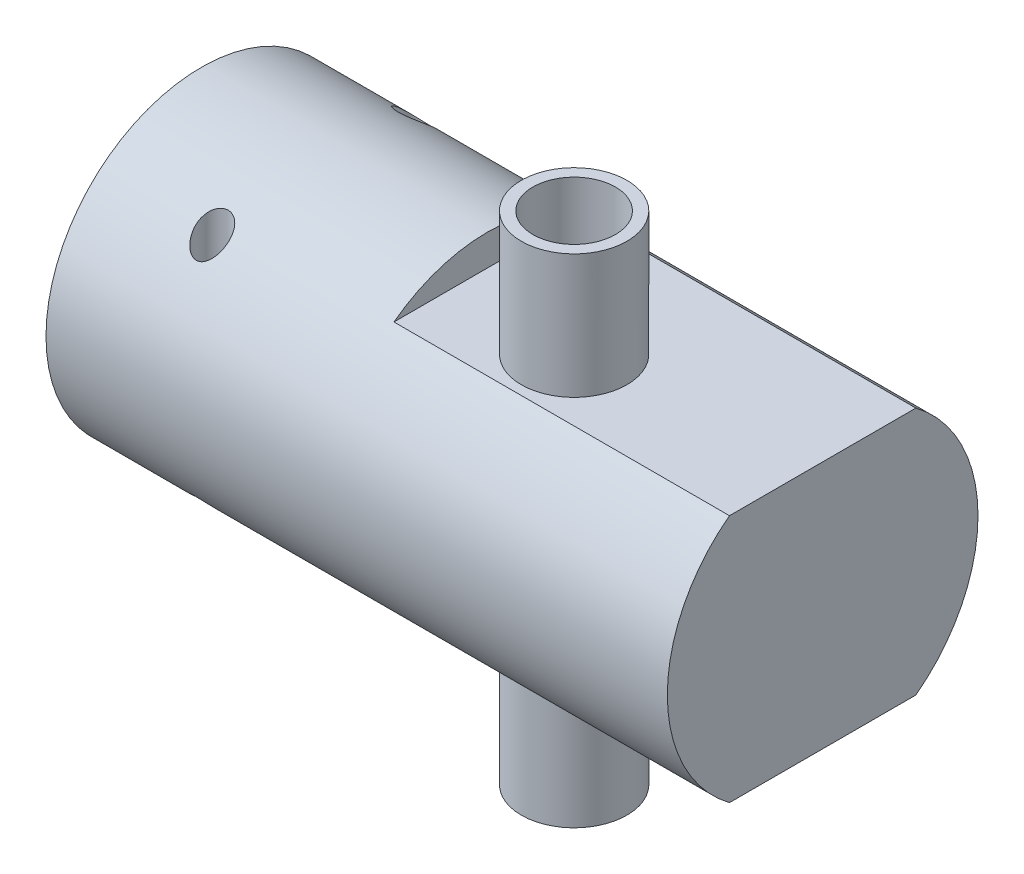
ISO-10303-21;
HEADER;
FILE_DESCRIPTION(('STEP AP214'),'2;1');
FILE_NAME('part.step','',(''),(''),'','','');
FILE_SCHEMA(('AUTOMOTIVE_DESIGN { 1 0 10303 214 1 1 1 1 }'));
ENDSEC;
DATA;
#1=APPLICATION_CONTEXT('core data for automotive mechanical design processes');
#2=APPLICATION_PROTOCOL_DEFINITION('international standard','automotive_design',2000,#1);
#3=PRODUCT_CONTEXT('',#1,'mechanical');
#4=PRODUCT('Part','Part','',(#3));
#5=PRODUCT_RELATED_PRODUCT_CATEGORY('part','',(#4));
#6=PRODUCT_DEFINITION_FORMATION('','',#4);
#7=PRODUCT_DEFINITION_CONTEXT('part definition',#1,'design');
#8=PRODUCT_DEFINITION('design','',#6,#7);
#9=PRODUCT_DEFINITION_SHAPE('','',#8);
#10=(LENGTH_UNIT() NAMED_UNIT(*) SI_UNIT(.MILLI.,.METRE.));
#11=(NAMED_UNIT(*) PLANE_ANGLE_UNIT() SI_UNIT($,.RADIAN.));
#12=(NAMED_UNIT(*) SI_UNIT($,.STERADIAN.) SOLID_ANGLE_UNIT());
#13=UNCERTAINTY_MEASURE_WITH_UNIT(LENGTH_MEASURE(1.E-05),#10,'distance_accuracy_value','');
#14=(GEOMETRIC_REPRESENTATION_CONTEXT(3) GLOBAL_UNCERTAINTY_ASSIGNED_CONTEXT((#13)) GLOBAL_UNIT_ASSIGNED_CONTEXT((#10,
#11,#12)) REPRESENTATION_CONTEXT('',''));
#15=CARTESIAN_POINT('',(0.,0.,0.));
#16=DIRECTION('',(0.,0.,1.));
#17=DIRECTION('',(1.,0.,0.));
#18=AXIS2_PLACEMENT_3D('',#15,#16,#17);
#19=CARTESIAN_POINT('',(0.,0.,0.));
#20=DIRECTION('',(-1.,0.,0.));
#21=DIRECTION('',(0.,0.,1.));
#22=AXIS2_PLACEMENT_3D('',#19,#20,#21);
#23=CYLINDRICAL_SURFACE('',#22,6.7437);
#24=CARTESIAN_POINT('',(-38.1,0.,0.));
#25=DIRECTION('',(-1.,0.,0.));
#26=DIRECTION('',(0.,0.,1.));
#27=AXIS2_PLACEMENT_3D('',#24,#25,#26);
#28=CIRCLE('',#27,6.7437);
#29=CARTESIAN_POINT('',(-38.1,0.,6.7437));
#30=VERTEX_POINT('',#29);
#31=EDGE_CURVE('E261',#30,#30,#28,.T.);
#32=ORIENTED_EDGE('',*,*,#31,.T.);
#33=EDGE_LOOP('',(#32));
#34=FACE_BOUND('',#33,.T.);
#35=CARTESIAN_POINT('',(-33.02,0.,0.));
#36=DIRECTION('',(-1.,0.,0.));
#37=DIRECTION('',(0.,0.,1.));
#38=AXIS2_PLACEMENT_3D('',#35,#36,#37);
#39=CIRCLE('',#38,6.7437);
#40=CARTESIAN_POINT('',(-33.02,0.,6.7437));
#41=VERTEX_POINT('',#40);
#42=EDGE_CURVE('E241',#41,#41,#39,.T.);
#43=ORIENTED_EDGE('',*,*,#42,.F.);
#44=EDGE_LOOP('',(#43));
#45=FACE_BOUND('',#44,.T.);
#46=ADVANCED_FACE('F33',(#34,#45),#23,.F.);
#47=CARTESIAN_POINT('',(-11.43,0.,0.));
#48=DIRECTION('',(-1.,0.,0.));
#49=DIRECTION('',(0.,0.,1.));
#50=AXIS2_PLACEMENT_3D('',#47,#48,#49);
#51=CIRCLE('',#50,6.7437);
#52=CARTESIAN_POINT('',(-11.43,0.,6.7437));
#53=VERTEX_POINT('',#52);
#54=EDGE_CURVE('E267',#53,#53,#51,.T.);
#55=ORIENTED_EDGE('',*,*,#54,.F.);
#56=EDGE_LOOP('',(#55));
#57=FACE_BOUND('',#56,.T.);
#58=CARTESIAN_POINT('',(-18.1756313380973,0.,6.7437));
#59=CARTESIAN_POINT('',(-18.175630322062,0.163065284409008,6.74369964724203));
#60=CARTESIAN_POINT('',(-18.1703856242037,0.32613646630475,6.73777424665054));
#61=CARTESIAN_POINT('',(-18.1497887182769,0.650846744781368,6.71419447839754));
#62=CARTESIAN_POINT('',(-18.1344314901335,0.812485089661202,6.69653428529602));
#63=CARTESIAN_POINT('',(-18.0946394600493,1.13327290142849,6.64977549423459));
#64=CARTESIAN_POINT('',(-18.0701866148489,1.29241676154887,6.62065415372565));
#65=CARTESIAN_POINT('',(-18.0137285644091,1.60698145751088,6.55141663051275));
#66=CARTESIAN_POINT('',(-17.9817195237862,1.76240035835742,6.5112948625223));
#67=CARTESIAN_POINT('',(-17.9122856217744,2.06708794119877,6.42102825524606));
#68=CARTESIAN_POINT('',(-17.8749244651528,2.21640558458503,6.37099898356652));
#69=CARTESIAN_POINT('',(-17.7962532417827,2.51021752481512,6.26106311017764));
#70=CARTESIAN_POINT('',(-17.7549434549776,2.65471216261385,6.20115720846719));
#71=CARTESIAN_POINT('',(-17.6275026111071,3.08083082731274,6.00695025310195));
#72=CARTESIAN_POINT('',(-17.5378769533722,3.35502178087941,5.85818023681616));
#73=CARTESIAN_POINT('',(-17.3962431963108,3.77781934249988,5.58941178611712));
#74=CARTESIAN_POINT('',(-17.343234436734,3.93359512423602,5.48092326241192));
#75=CARTESIAN_POINT('',(-17.2408969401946,4.23629007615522,5.2504762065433));
#76=CARTESIAN_POINT('',(-17.1915690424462,4.38320722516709,5.12851461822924));
#77=CARTESIAN_POINT('',(-17.099281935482,4.6670207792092,4.87165197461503));
#78=CARTESIAN_POINT('',(-17.0563134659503,4.80393160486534,4.7367702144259));
#79=CARTESIAN_POINT('',(-16.97929077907,5.06682838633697,4.45442426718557));
#80=CARTESIAN_POINT('',(-16.9452322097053,5.19281965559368,4.30696626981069));
#81=CARTESIAN_POINT('',(-16.8971421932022,5.39674179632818,4.04614757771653));
#82=CARTESIAN_POINT('',(-16.8801673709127,5.47779033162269,3.93575216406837));
#83=CARTESIAN_POINT('',(-16.8528417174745,5.63334851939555,3.70967471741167));
#84=CARTESIAN_POINT('',(-16.8424891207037,5.70785991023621,3.59399410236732));
#85=CARTESIAN_POINT('',(-16.8293114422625,5.84978763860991,3.35803739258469));
#86=CARTESIAN_POINT('',(-16.826481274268,5.91720874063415,3.23776445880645));
#87=CARTESIAN_POINT('',(-16.8291732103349,6.0445205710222,2.99336630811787));
#88=CARTESIAN_POINT('',(-16.8346954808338,6.10441114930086,2.86924101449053));
#89=CARTESIAN_POINT('',(-16.854894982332,6.21663389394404,2.61727050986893));
#90=CARTESIAN_POINT('',(-16.8696367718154,6.26890952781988,2.48940517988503));
#91=CARTESIAN_POINT('',(-16.9089152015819,6.36509239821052,2.23203041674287));
#92=CARTESIAN_POINT('',(-16.9334518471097,6.40899963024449,2.10252098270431));
#93=CARTESIAN_POINT('',(-16.9926830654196,6.48831804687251,1.84325593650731));
#94=CARTESIAN_POINT('',(-17.0273751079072,6.52373134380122,1.71350039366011));
#95=CARTESIAN_POINT('',(-17.1070537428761,6.58617501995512,1.45514504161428));
#96=CARTESIAN_POINT('',(-17.152039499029,6.61320607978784,1.32654513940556));
#97=CARTESIAN_POINT('',(-17.2468733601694,6.65677600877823,1.08545006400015));
#98=CARTESIAN_POINT('',(-17.2956969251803,6.67412454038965,0.972695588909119));
#99=CARTESIAN_POINT('',(-17.4012871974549,6.70278904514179,0.750133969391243));
#100=CARTESIAN_POINT('',(-17.4580565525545,6.7141030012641,0.640327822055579));
#101=CARTESIAN_POINT('',(-17.5791903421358,6.73119026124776,0.424589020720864));
#102=CARTESIAN_POINT('',(-17.6435527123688,6.73696506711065,0.318655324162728));
#103=CARTESIAN_POINT('',(-17.7795166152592,6.74357904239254,0.111332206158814));
#104=CARTESIAN_POINT('',(-17.8511209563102,6.74441628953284,0.00994456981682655));
#105=CARTESIAN_POINT('',(-18.0033653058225,6.74177438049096,-0.190578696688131));
#106=CARTESIAN_POINT('',(-18.0842117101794,6.73816519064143,-0.289555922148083));
#107=CARTESIAN_POINT('',(-18.2526122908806,6.72718084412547,-0.481427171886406));
#108=CARTESIAN_POINT('',(-18.3401688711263,6.71980433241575,-0.57431899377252));
#109=CARTESIAN_POINT('',(-18.6121693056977,6.69320717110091,-0.843128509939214));
#110=CARTESIAN_POINT('',(-18.806006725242,6.66951656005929,-1.00926285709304));
#111=CARTESIAN_POINT('',(-19.2406933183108,6.61320863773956,-1.33158640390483));
#112=CARTESIAN_POINT('',(-19.4843845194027,6.57983724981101,-1.48378789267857));
#113=CARTESIAN_POINT('',(-19.9932207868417,6.5146896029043,-1.74782553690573));
#114=CARTESIAN_POINT('',(-20.2583737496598,6.48291393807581,-1.85964675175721));
#115=CARTESIAN_POINT('',(-20.6759895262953,6.4412014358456,-1.99771517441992));
#116=CARTESIAN_POINT('',(-20.8231517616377,6.4280016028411,-2.03952445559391));
#117=CARTESIAN_POINT('',(-21.1207948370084,6.40503305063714,-2.11055751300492));
#118=CARTESIAN_POINT('',(-21.2712758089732,6.3952644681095,-2.13978078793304));
#119=CARTESIAN_POINT('',(-21.5743074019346,6.379845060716,-2.18532444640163));
#120=CARTESIAN_POINT('',(-21.7268569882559,6.37419224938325,-2.20165105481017));
#121=CARTESIAN_POINT('',(-22.0328905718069,6.3673865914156,-2.22125832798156));
#122=CARTESIAN_POINT('',(-22.1863745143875,6.36623348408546,-2.22453974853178));
#123=CARTESIAN_POINT('',(-22.4854624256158,6.36845031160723,-2.21818327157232));
#124=CARTESIAN_POINT('',(-22.6310818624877,6.37160007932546,-2.20917427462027));
#125=CARTESIAN_POINT('',(-22.92097042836,6.38183705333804,-2.1794245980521));
#126=CARTESIAN_POINT('',(-23.0652395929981,6.3889241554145,-2.15868422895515));
#127=CARTESIAN_POINT('',(-23.3514336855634,6.40659693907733,-2.10565612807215));
#128=CARTESIAN_POINT('',(-23.4933584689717,6.41718283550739,-2.07336768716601));
#129=CARTESIAN_POINT('',(-23.7739395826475,6.44119377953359,-1.99751791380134));
#130=CARTESIAN_POINT('',(-23.9125945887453,6.45461995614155,-1.95395209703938));
#131=CARTESIAN_POINT('',(-24.3228182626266,6.49801557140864,-1.80662485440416));
#132=CARTESIAN_POINT('',(-24.5882930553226,6.53107690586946,-1.68629950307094));
#133=CARTESIAN_POINT('',(-25.0965559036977,6.59740433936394,-1.40448337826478));
#134=CARTESIAN_POINT('',(-25.3393323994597,6.63067053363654,-1.24297178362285));
#135=CARTESIAN_POINT('',(-25.6878131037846,6.67453742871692,-0.968110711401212));
#136=CARTESIAN_POINT('',(-25.8039277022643,6.68840594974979,-0.868238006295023));
#137=CARTESIAN_POINT('',(-26.0274374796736,6.71227175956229,-0.658783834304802));
#138=CARTESIAN_POINT('',(-26.1348366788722,6.72227084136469,-0.549206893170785));
#139=CARTESIAN_POINT('',(-26.3400305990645,6.73701741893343,-0.321148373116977));
#140=CARTESIAN_POINT('',(-26.4378292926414,6.74176709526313,-0.202670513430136));
#141=CARTESIAN_POINT('',(-26.6230051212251,6.74467886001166,0.0422515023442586));
#142=CARTESIAN_POINT('',(-26.7103835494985,6.74284176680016,0.168694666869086));
#143=CARTESIAN_POINT('',(-26.8677859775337,6.731768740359,0.418608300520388));
#144=CARTESIAN_POINT('',(-26.938619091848,6.72309632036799,0.541594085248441));
#145=CARTESIAN_POINT('',(-27.070111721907,6.69819460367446,0.792163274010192));
#146=CARTESIAN_POINT('',(-27.1307717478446,6.6819656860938,0.919746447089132));
#147=CARTESIAN_POINT('',(-27.2414660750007,6.64129225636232,1.178051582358));
#148=CARTESIAN_POINT('',(-27.291508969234,6.61685442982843,1.30877091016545));
#149=CARTESIAN_POINT('',(-27.3808298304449,6.559311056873,1.5719619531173));
#150=CARTESIAN_POINT('',(-27.4201088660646,6.52620637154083,1.70443349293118));
#151=CARTESIAN_POINT('',(-27.483836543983,6.45570015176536,1.95348108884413));
#152=CARTESIAN_POINT('',(-27.5095069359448,6.41930869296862,2.07003378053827));
#153=CARTESIAN_POINT('',(-27.5527986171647,6.33969930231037,2.30234243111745));
#154=CARTESIAN_POINT('',(-27.5704172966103,6.29647916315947,2.41809811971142));
#155=CARTESIAN_POINT('',(-27.597935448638,6.20338967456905,2.64779151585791));
#156=CARTESIAN_POINT('',(-27.6078371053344,6.15352221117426,2.76172972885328));
#157=CARTESIAN_POINT('',(-27.6204062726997,6.04736982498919,2.9870259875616));
#158=CARTESIAN_POINT('',(-27.6230710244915,5.99108246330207,3.09838303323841));
#159=CARTESIAN_POINT('',(-27.6217138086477,5.87133035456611,3.3198040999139));
#160=CARTESIAN_POINT('',(-27.6175667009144,5.80775169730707,3.42980566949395));
#161=CARTESIAN_POINT('',(-27.6030217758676,5.67468257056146,3.64576229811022));
#162=CARTESIAN_POINT('',(-27.5926215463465,5.60518982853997,3.75171577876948));
#163=CARTESIAN_POINT('',(-27.5530879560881,5.38843603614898,4.06275731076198));
#164=CARTESIAN_POINT('',(-27.5156200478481,5.23285053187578,4.2611165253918));
#165=CARTESIAN_POINT('',(-27.4363221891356,4.94623404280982,4.58763542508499));
#166=CARTESIAN_POINT('',(-27.3982122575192,4.81946217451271,4.72056387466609));
#167=CARTESIAN_POINT('',(-27.3153706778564,4.55665256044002,4.97471493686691));
#168=CARTESIAN_POINT('',(-27.2706386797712,4.42061432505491,5.09593693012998));
#169=CARTESIAN_POINT('',(-27.1766730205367,4.1397654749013,5.32662785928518));
#170=CARTESIAN_POINT('',(-27.1274276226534,3.99493233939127,5.43606444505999));
#171=CARTESIAN_POINT('',(-27.0267826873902,3.69746733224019,5.64260632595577));
#172=CARTESIAN_POINT('',(-26.9753833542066,3.54483619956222,5.73971278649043));
#173=CARTESIAN_POINT('',(-26.8717537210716,3.22931076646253,5.92308718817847));
#174=CARTESIAN_POINT('',(-26.819525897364,3.06627774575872,6.00911794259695));
#175=CARTESIAN_POINT('',(-26.7177477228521,2.73299474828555,6.16784380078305));
#176=CARTESIAN_POINT('',(-26.6681977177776,2.56274384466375,6.24053718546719));
#177=CARTESIAN_POINT('',(-26.5746190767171,2.21594077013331,6.37192222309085));
#178=CARTESIAN_POINT('',(-26.5305770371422,2.03940529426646,6.43064819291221));
#179=CARTESIAN_POINT('',(-26.4507166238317,1.68036753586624,6.53365853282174));
#180=CARTESIAN_POINT('',(-26.4148950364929,1.49786761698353,6.57794854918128));
#181=CARTESIAN_POINT('',(-26.3611824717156,1.17064536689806,6.64290152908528));
#182=CARTESIAN_POINT('',(-26.3410620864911,1.02689897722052,6.66665651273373));
#183=CARTESIAN_POINT('',(-26.3083477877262,0.737325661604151,6.70486061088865));
#184=CARTESIAN_POINT('',(-26.2957526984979,0.591499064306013,6.71931117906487));
#185=CARTESIAN_POINT('',(-26.2788203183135,0.2989005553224,6.73866590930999));
#186=CARTESIAN_POINT('',(-26.2744733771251,0.152129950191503,6.74358122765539));
#187=CARTESIAN_POINT('',(-26.2742676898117,-0.141428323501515,6.74381452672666));
#188=CARTESIAN_POINT('',(-26.2784092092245,-0.288215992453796,6.73913220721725));
#189=CARTESIAN_POINT('',(-26.2949186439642,-0.580408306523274,6.72026787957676));
#190=CARTESIAN_POINT('',(-26.3072696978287,-0.725815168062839,6.70610534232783));
#191=CARTESIAN_POINT('',(-26.3394615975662,-1.01454712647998,6.6685384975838));
#192=CARTESIAN_POINT('',(-26.3593025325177,-1.15787219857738,6.64513408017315));
#193=CARTESIAN_POINT('',(-26.4286562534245,-1.58416529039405,6.5613844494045));
#194=CARTESIAN_POINT('',(-26.4879706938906,-1.86302270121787,6.48753173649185));
#195=CARTESIAN_POINT('',(-26.600998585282,-2.31850321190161,6.33561154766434));
#196=CARTESIAN_POINT('',(-26.650449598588,-2.49933110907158,6.26642500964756));
#197=CARTESIAN_POINT('',(-26.7535516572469,-2.85340143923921,6.1133251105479));
#198=CARTESIAN_POINT('',(-26.8072021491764,-3.02664486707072,6.02941368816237));
#199=CARTESIAN_POINT('',(-26.9157867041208,-3.36518445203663,5.84722206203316));
#200=CARTESIAN_POINT('',(-26.9707218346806,-3.53047362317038,5.74892952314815));
#201=CARTESIAN_POINT('',(-27.0790008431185,-3.85233487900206,5.53841282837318));
#202=CARTESIAN_POINT('',(-27.1323451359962,-4.00890924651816,5.42619234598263));
#203=CARTESIAN_POINT('',(-27.2703254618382,-4.41823016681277,5.10523819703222));
#204=CARTESIAN_POINT('',(-27.3510429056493,-4.66247123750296,4.88349421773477));
#205=CARTESIAN_POINT('',(-27.4529026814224,-5.00455944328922,4.52319815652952));
#206=CARTESIAN_POINT('',(-27.4836424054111,-5.11449331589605,4.39855683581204));
#207=CARTESIAN_POINT('',(-27.5370936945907,-5.3256241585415,4.14040714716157));
#208=CARTESIAN_POINT('',(-27.5598071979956,-5.42682323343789,4.0069009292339));
#209=CARTESIAN_POINT('',(-27.5918111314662,-5.59965111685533,3.76021003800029));
#210=CARTESIAN_POINT('',(-27.6029035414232,-5.67307483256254,3.64851055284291));
#211=CARTESIAN_POINT('',(-27.6181178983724,-5.81333511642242,3.42060150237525));
#212=CARTESIAN_POINT('',(-27.6222414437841,-5.88017319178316,3.30439297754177));
#213=CARTESIAN_POINT('',(-27.6227348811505,-6.0067868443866,3.06821558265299));
#214=CARTESIAN_POINT('',(-27.6191076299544,-6.06656501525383,2.94824811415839));
#215=CARTESIAN_POINT('',(-27.6034097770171,-6.17868395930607,2.70540878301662));
#216=CARTESIAN_POINT('',(-27.5913390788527,-6.2310246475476,2.58253688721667));
#217=CARTESIAN_POINT('',(-27.558100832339,-6.32822936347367,2.33428098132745));
#218=CARTESIAN_POINT('',(-27.5368840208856,-6.3730510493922,2.2088869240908));
#219=CARTESIAN_POINT('',(-27.484950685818,-6.45471192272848,1.95746110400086));
#220=CARTESIAN_POINT('',(-27.4542341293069,-6.49155108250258,1.83142933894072));
#221=CARTESIAN_POINT('',(-27.3831165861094,-6.55727432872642,1.58003869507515));
#222=CARTESIAN_POINT('',(-27.3427165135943,-6.58615916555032,1.45467975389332));
#223=CARTESIAN_POINT('',(-27.252254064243,-6.63621248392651,1.20593046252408));
#224=CARTESIAN_POINT('',(-27.2021921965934,-6.65738137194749,1.08254000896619));
#225=CARTESIAN_POINT('',(-27.0973513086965,-6.69092986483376,0.849468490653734));
#226=CARTESIAN_POINT('',(-27.0433500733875,-6.70390949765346,0.739522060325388));
#227=CARTESIAN_POINT('',(-26.9277275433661,-6.72425745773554,0.523130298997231));
#228=CARTESIAN_POINT('',(-26.8661036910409,-6.73162389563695,0.416686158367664));
#229=CARTESIAN_POINT('',(-26.7356321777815,-6.74129584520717,0.208127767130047));
#230=CARTESIAN_POINT('',(-26.6667863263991,-6.74360262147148,0.106012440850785));
#231=CARTESIAN_POINT('',(-26.5222497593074,-6.74379139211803,-0.0933047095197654));
#232=CARTESIAN_POINT('',(-26.4465563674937,-6.74167164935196,-0.190504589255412));
#233=CARTESIAN_POINT('',(-26.2843194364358,-6.73345610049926,-0.384751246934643));
#234=CARTESIAN_POINT('',(-26.1974044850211,-6.72714239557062,-0.481479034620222));
#235=CARTESIAN_POINT('',(-26.0169790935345,-6.71116162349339,-0.668279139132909));
#236=CARTESIAN_POINT('',(-25.9234664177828,-6.70149341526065,-0.758349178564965));
#237=CARTESIAN_POINT('',(-25.6337113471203,-6.66870883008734,-1.01794965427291));
#238=CARTESIAN_POINT('',(-25.4282023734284,-6.64180903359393,-1.17692961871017));
#239=CARTESIAN_POINT('',(-25.0910768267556,-6.59707717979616,-1.40102833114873));
#240=CARTESIAN_POINT('',(-24.9662266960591,-6.5803938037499,-1.476884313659));
#241=CARTESIAN_POINT('',(-24.7107835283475,-6.54706440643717,-1.61824083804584));
#242=CARTESIAN_POINT('',(-24.5801919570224,-6.53041837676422,-1.68374400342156));
#243=CARTESIAN_POINT('',(-24.3139562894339,-6.49822205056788,-1.80401851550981));
#244=CARTESIAN_POINT('',(-24.1783097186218,-6.4826723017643,-1.85878452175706));
#245=CARTESIAN_POINT('',(-23.9028695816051,-6.45365159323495,-1.95716658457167));
#246=CARTESIAN_POINT('',(-23.7630776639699,-6.44017981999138,-2.00078700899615));
#247=CARTESIAN_POINT('',(-23.474426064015,-6.41565795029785,-2.07810953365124));
#248=CARTESIAN_POINT('',(-23.3254286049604,-6.40472829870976,-2.11133735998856));
#249=CARTESIAN_POINT('',(-23.0249178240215,-6.38676216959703,-2.16507823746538));
#250=CARTESIAN_POINT('',(-22.8734044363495,-6.37972579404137,-2.1855909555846));
#251=CARTESIAN_POINT('',(-22.5691029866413,-6.37003190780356,-2.21368595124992));
#252=CARTESIAN_POINT('',(-22.4163154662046,-6.36737262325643,-2.22127346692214));
#253=CARTESIAN_POINT('',(-22.1106413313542,-6.36661231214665,-2.22345221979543));
#254=CARTESIAN_POINT('',(-21.9577547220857,-6.36851106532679,-2.21804408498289));
#255=CARTESIAN_POINT('',(-21.6612439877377,-6.37651359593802,-2.19492613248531));
#256=CARTESIAN_POINT('',(-21.5175606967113,-6.38238773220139,-2.1778877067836));
#257=CARTESIAN_POINT('',(-21.2322204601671,-6.39773597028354,-2.1323787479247));
#258=CARTESIAN_POINT('',(-21.090563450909,-6.40720995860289,-2.10390857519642));
#259=CARTESIAN_POINT('',(-20.8101849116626,-6.42918463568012,-2.03576926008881));
#260=CARTESIAN_POINT('',(-20.6714638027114,-6.44168575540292,-1.99609852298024));
#261=CARTESIAN_POINT('',(-20.3978169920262,-6.46895469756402,-1.90586532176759));
#262=CARTESIAN_POINT('',(-20.2628928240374,-6.48372342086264,-1.85529852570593));
#263=CARTESIAN_POINT('',(-19.859787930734,-6.530736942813,-1.6855355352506));
#264=CARTESIAN_POINT('',(-19.598716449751,-6.56520437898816,-1.54959885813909));
#265=CARTESIAN_POINT('',(-19.1017110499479,-6.63122467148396,-1.23683595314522));
#266=CARTESIAN_POINT('',(-18.8657881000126,-6.66277625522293,-1.05999198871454));
#267=CARTESIAN_POINT('',(-18.5311334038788,-6.70112074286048,-0.763500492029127));
#268=CARTESIAN_POINT('',(-18.4209267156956,-6.71252707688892,-0.657168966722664));
#269=CARTESIAN_POINT('',(-18.2097862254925,-6.73055319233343,-0.43532892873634));
#270=CARTESIAN_POINT('',(-18.1088478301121,-6.73717535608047,-0.319825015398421));
#271=CARTESIAN_POINT('',(-17.917149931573,-6.74427931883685,-0.0805980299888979));
#272=CARTESIAN_POINT('',(-17.8263837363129,-6.7447651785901,0.0431195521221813));
#273=CARTESIAN_POINT('',(-17.6557940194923,-6.73832784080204,0.297705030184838));
#274=CARTESIAN_POINT('',(-17.5759688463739,-6.73140576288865,0.428571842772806));
#275=CARTESIAN_POINT('',(-17.4351423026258,-6.71010505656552,0.683144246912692));
#276=CARTESIAN_POINT('',(-17.3730678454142,-6.69651029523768,0.806322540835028));
#277=CARTESIAN_POINT('',(-17.2588735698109,-6.66167415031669,1.05616694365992));
#278=CARTESIAN_POINT('',(-17.2067530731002,-6.64043328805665,1.18283281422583));
#279=CARTESIAN_POINT('',(-17.1127433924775,-6.58983329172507,1.43823662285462));
#280=CARTESIAN_POINT('',(-17.0708482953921,-6.5604788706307,1.56697331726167));
#281=CARTESIAN_POINT('',(-16.997285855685,-6.49338218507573,1.82517501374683));
#282=CARTESIAN_POINT('',(-16.9656178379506,-6.45564047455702,1.95463996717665));
#283=CARTESIAN_POINT('',(-16.9151768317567,-6.37626054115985,2.19897132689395));
#284=CARTESIAN_POINT('',(-16.8953823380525,-6.33547982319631,2.31390821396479));
#285=CARTESIAN_POINT('',(-16.8634648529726,-6.24731613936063,2.54234595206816));
#286=CARTESIAN_POINT('',(-16.851344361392,-6.19993102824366,2.65584632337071));
#287=CARTESIAN_POINT('',(-16.8343638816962,-6.09880609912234,2.88049035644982));
#288=CARTESIAN_POINT('',(-16.8295020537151,-6.04506789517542,2.9916346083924));
#289=CARTESIAN_POINT('',(-16.8265051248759,-5.93151076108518,3.21090700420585));
#290=CARTESIAN_POINT('',(-16.8283726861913,-5.87168943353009,3.3190339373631));
#291=CARTESIAN_POINT('',(-16.8384868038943,-5.74324298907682,3.53686425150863));
#292=CARTESIAN_POINT('',(-16.8470429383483,-5.67432941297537,3.6463830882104));
#293=CARTESIAN_POINT('',(-16.870164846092,-5.53064087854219,3.86085339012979));
#294=CARTESIAN_POINT('',(-16.8847325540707,-5.45586403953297,3.96580337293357));
#295=CARTESIAN_POINT('',(-16.9363190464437,-5.22335296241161,4.2731696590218));
#296=CARTESIAN_POINT('',(-16.9812254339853,-5.05739594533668,4.46817358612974));
#297=CARTESIAN_POINT('',(-17.0725178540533,-4.75163421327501,4.78909314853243));
#298=CARTESIAN_POINT('',(-17.1156205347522,-4.61591846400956,4.91996355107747));
#299=CARTESIAN_POINT('',(-17.2076010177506,-4.33513343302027,5.16907152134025));
#300=CARTESIAN_POINT('',(-17.2564792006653,-4.19006353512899,5.28730825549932));
#301=CARTESIAN_POINT('',(-17.357722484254,-3.89093218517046,5.5111855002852));
#302=CARTESIAN_POINT('',(-17.4100980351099,-3.73684397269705,5.61678536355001));
#303=CARTESIAN_POINT('',(-17.5157128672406,-3.42069092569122,5.81473478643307));
#304=CARTESIAN_POINT('',(-17.5689520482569,-3.25862701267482,5.9070858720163));
#305=CARTESIAN_POINT('',(-17.6746176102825,-2.92411244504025,6.07972779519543));
#306=CARTESIAN_POINT('',(-17.7270143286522,-2.75153120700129,6.15978426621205));
#307=CARTESIAN_POINT('',(-17.8271484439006,-2.39898945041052,6.30545121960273));
#308=CARTESIAN_POINT('',(-17.8748847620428,-2.21902723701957,6.37105836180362));
#309=CARTESIAN_POINT('',(-17.9624048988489,-1.85324637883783,6.48687876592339));
#310=CARTESIAN_POINT('',(-18.0022240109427,-1.66745820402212,6.53716090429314));
#311=CARTESIAN_POINT('',(-18.0710931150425,-1.29045845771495,6.62189255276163));
#312=CARTESIAN_POINT('',(-18.1001531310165,-1.09925211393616,6.6563568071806));
#313=CARTESIAN_POINT('',(-18.1398722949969,-0.75670334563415,6.70280928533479));
#314=CARTESIAN_POINT('',(-18.1532055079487,-0.606115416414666,6.71811645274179));
#315=CARTESIAN_POINT('',(-18.1710862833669,-0.303686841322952,6.73856287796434));
#316=CARTESIAN_POINT('',(-18.1756322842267,-0.15184597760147,6.74370032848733));
#317=CARTESIAN_POINT('',(-18.1756313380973,0.,6.7437));
#318=B_SPLINE_CURVE_WITH_KNOTS('',3,(#58,#59,#60,#61,#62,#63,#64,#65,#66,#67,#68,#69,#70,#71,
#72,#73,#74,#75,#76,#77,#78,#79,#80,#81,#82,#83,#84,#85,#86,#87,#88,#89,#90,#91,#92,#93,#94,#95,
#96,#97,#98,#99,#100,#101,#102,#103,#104,#105,#106,#107,#108,#109,#110,#111,#112,#113,#114,#115,
#116,#117,#118,#119,#120,#121,#122,#123,#124,#125,#126,#127,#128,#129,#130,#131,#132,#133,#134,
#135,#136,#137,#138,#139,#140,#141,#142,#143,#144,#145,#146,#147,#148,#149,#150,#151,#152,#153,
#154,#155,#156,#157,#158,#159,#160,#161,#162,#163,#164,#165,#166,#167,#168,#169,#170,#171,#172,
#173,#174,#175,#176,#177,#178,#179,#180,#181,#182,#183,#184,#185,#186,#187,#188,#189,#190,#191,
#192,#193,#194,#195,#196,#197,#198,#199,#200,#201,#202,#203,#204,#205,#206,#207,#208,#209,#210,
#211,#212,#213,#214,#215,#216,#217,#218,#219,#220,#221,#222,#223,#224,#225,#226,#227,#228,#229,
#230,#231,#232,#233,#234,#235,#236,#237,#238,#239,#240,#241,#242,#243,#244,#245,#246,#247,#248,
#249,#250,#251,#252,#253,#254,#255,#256,#257,#258,#259,#260,#261,#262,#263,#264,#265,#266,#267,
#268,#269,#270,#271,#272,#273,#274,#275,#276,#277,#278,#279,#280,#281,#282,#283,#284,#285,#286,
#287,#288,#289,#290,#291,#292,#293,#294,#295,#296,#297,#298,#299,#300,#301,#302,#303,#304,#305,
#306,#307,#308,#309,#310,#311,#312,#313,#314,#315,#316,#317),.UNSPECIFIED.,.T.,.F.,(4,2,2,2,2,2,
2,2,2,2,2,2,2,2,2,2,2,2,2,2,2,2,2,2,2,2,2,2,2,2,2,2,2,2,2,2,2,2,2,2,2,2,2,2,2,2,2,2,2,2,2,2,2,2,
2,2,2,2,2,2,2,2,2,2,2,2,2,2,2,2,2,2,2,2,2,2,2,2,2,2,2,2,2,2,2,2,2,2,2,2,2,2,2,2,2,2,2,2,2,2,2,2,
2,2,2,2,2,2,2,2,2,2,2,2,2,2,2,2,2,2,2,2,2,2,2,2,2,2,2,4),(0.,0.489019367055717,
0.978281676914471,1.46851977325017,1.95900724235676,2.44407870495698,2.9291158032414,
3.89940653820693,4.49014200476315,5.08101174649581,5.67101244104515,6.26072441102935,
6.67435831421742,7.08788188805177,7.50112578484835,7.91437791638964,8.33055670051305,
8.74673570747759,9.16281110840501,9.57885271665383,9.95068793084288,10.3226473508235,
10.6945058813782,11.066509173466,11.4496545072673,11.8329377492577,12.5991959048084,
13.463429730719,14.327982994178,14.7881506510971,15.2483366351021,15.7083003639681,
16.1682374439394,16.6055013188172,17.0427536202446,17.4800327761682,17.9174860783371,
18.7934581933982,19.6698740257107,20.130719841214,20.5913518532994,21.0517924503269,
21.5121758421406,21.9381344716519,22.3640717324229,22.7896629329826,23.2152118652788,
23.5890804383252,23.9630701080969,24.33695389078,24.7109801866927,25.0919548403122,
25.4730765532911,26.2350153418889,26.7971605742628,27.3593355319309,27.9230162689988,
28.4866436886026,29.0608323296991,29.6350949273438,30.2079316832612,30.780544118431,
31.2213250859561,31.6620371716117,32.1022333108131,32.5424432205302,32.98175177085,
33.421065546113,34.300969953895,34.8998233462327,35.4985979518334,36.0978891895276,
36.6970226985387,37.7111480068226,38.2176934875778,38.7241165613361,39.1261295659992,
39.5280503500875,39.9298230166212,40.3316002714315,40.7355691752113,41.1395394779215,
41.5434716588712,41.94738255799,42.3165010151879,42.6857436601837,43.0548940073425,
43.424189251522,43.8143514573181,44.2046465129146,44.985007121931,45.4257457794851,
45.8663725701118,46.3072179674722,46.7478903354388,47.2064437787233,47.665009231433,
48.1233887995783,48.5817462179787,49.0156607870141,49.4495616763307,49.8835243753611,
50.3176599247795,51.2025946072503,52.087913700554,52.5480795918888,53.0080161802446,
53.4676483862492,53.927211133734,54.3424339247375,54.7576284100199,55.1725822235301,
55.5875086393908,55.9577449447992,56.328101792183,56.698364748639,57.0687741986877,
57.4574228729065,57.8461967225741,58.6234977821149,59.2030337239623,59.7826078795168,
60.3639988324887,60.9453227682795,61.5366305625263,62.1280749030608,62.7168204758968,
63.3050161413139,63.7603088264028,64.215682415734),.UNSPECIFIED.);
#319=CARTESIAN_POINT('',(-18.1756313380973,0.,6.7437));
#320=VERTEX_POINT('',#319);
#321=EDGE_CURVE('E96',#320,#320,#318,.T.);
#322=ORIENTED_EDGE('',*,*,#321,.T.);
#323=EDGE_LOOP('',(#322));
#324=FACE_BOUND('',#323,.T.);
#325=CARTESIAN_POINT('',(-30.6578,0.,0.));
#326=DIRECTION('',(-1.,0.,0.));
#327=DIRECTION('',(0.,0.,1.));
#328=AXIS2_PLACEMENT_3D('',#325,#326,#327);
#329=CIRCLE('',#328,6.7437);
#330=CARTESIAN_POINT('',(-30.6578,0.,6.7437));
#331=VERTEX_POINT('',#330);
#332=EDGE_CURVE('E239',#331,#331,#329,.T.);
#333=ORIENTED_EDGE('',*,*,#332,.T.);
#334=EDGE_LOOP('',(#333));
#335=FACE_BOUND('',#334,.T.);
#336=ADVANCED_FACE('F156',(#57,#324,#335),#23,.F.);
#337=CARTESIAN_POINT('',(-22.225,-25.4,3.175));
#338=DIRECTION('',(0.,1.,0.));
#339=DIRECTION('',(0.,0.,1.));
#340=AXIS2_PLACEMENT_3D('',#337,#338,#339);
#341=CYLINDRICAL_SURFACE('',#340,5.3975);
#342=ORIENTED_EDGE('',*,*,#321,.F.);
#343=EDGE_LOOP('',(#342));
#344=FACE_BOUND('',#343,.T.);
#345=CARTESIAN_POINT('',(-22.225,-6.35349154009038,-2.2225));
#346=CARTESIAN_POINT('',(-22.0762662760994,-6.35348906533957,-2.22250151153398));
#347=CARTESIAN_POINT('',(-21.9275531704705,-6.3556531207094,-2.2163480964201));
#348=CARTESIAN_POINT('',(-21.63121471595,-6.36416144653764,-2.19179906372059));
#349=CARTESIAN_POINT('',(-21.4835896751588,-6.37050685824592,-2.17340010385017));
#350=CARTESIAN_POINT('',(-21.1904166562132,-6.38697958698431,-2.12450445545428));
#351=CARTESIAN_POINT('',(-21.0448709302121,-6.39711072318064,-2.0939955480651));
#352=CARTESIAN_POINT('',(-20.7570003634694,-6.42049260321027,-2.02115802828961));
#353=CARTESIAN_POINT('',(-20.6146768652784,-6.43374462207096,-1.97882458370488));
#354=CARTESIAN_POINT('',(-20.1949259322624,-6.476857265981,-1.83488962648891));
#355=CARTESIAN_POINT('',(-19.9235395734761,-6.5101522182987,-1.71615447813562));
#356=CARTESIAN_POINT('',(-19.4038216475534,-6.57760846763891,-1.43598196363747));
#357=CARTESIAN_POINT('',(-19.1554963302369,-6.61176999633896,-1.27453306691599));
#358=CARTESIAN_POINT('',(-18.8009439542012,-6.65694791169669,-1.00019575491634));
#359=CARTESIAN_POINT('',(-18.6839659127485,-6.67117883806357,-0.901462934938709));
#360=CARTESIAN_POINT('',(-18.4586291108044,-6.69591673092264,-0.694218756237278));
#361=CARTESIAN_POINT('',(-18.350266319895,-6.70642544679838,-0.585712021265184));
#362=CARTESIAN_POINT('',(-18.1430405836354,-6.72233611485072,-0.359701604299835));
#363=CARTESIAN_POINT('',(-18.0441739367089,-6.72774006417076,-0.242201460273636));
#364=CARTESIAN_POINT('',(-17.8567606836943,-6.73209680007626,0.00088094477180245));
#365=CARTESIAN_POINT('',(-17.768212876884,-6.73105033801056,0.12646226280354));
#366=CARTESIAN_POINT('',(-17.6081544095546,-6.72159680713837,0.375347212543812));
#367=CARTESIAN_POINT('',(-17.5358806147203,-6.71371739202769,0.498179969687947));
#368=CARTESIAN_POINT('',(-17.4015270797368,-6.69042094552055,0.748623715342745));
#369=CARTESIAN_POINT('',(-17.3394468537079,-6.67500427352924,0.876234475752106));
#370=CARTESIAN_POINT('',(-17.2259608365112,-6.63594214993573,1.13477256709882));
#371=CARTESIAN_POINT('',(-17.1745461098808,-6.61230363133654,1.26569701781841));
#372=CARTESIAN_POINT('',(-17.082554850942,-6.55631371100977,1.52947047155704));
#373=CARTESIAN_POINT('',(-17.041977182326,-6.5239632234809,1.66231927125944));
#374=CARTESIAN_POINT('',(-16.9759741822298,-6.45487798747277,1.91195162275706));
#375=CARTESIAN_POINT('',(-16.9492966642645,-6.41917756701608,2.02869372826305));
#376=CARTESIAN_POINT('',(-16.9040449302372,-6.34090839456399,2.2614869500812));
#377=CARTESIAN_POINT('',(-16.8854733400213,-6.29833742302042,2.3775378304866));
#378=CARTESIAN_POINT('',(-16.8561177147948,-6.20649183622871,2.60790991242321));
#379=CARTESIAN_POINT('',(-16.8453313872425,-6.15721919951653,2.72223161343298));
#380=CARTESIAN_POINT('',(-16.8310694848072,-6.05219357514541,2.94836656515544));
#381=CARTESIAN_POINT('',(-16.827596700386,-5.99643812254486,3.06017884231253));
#382=CARTESIAN_POINT('',(-16.8274060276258,-5.87799293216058,3.28200799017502));
#383=CARTESIAN_POINT('',(-16.8307797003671,-5.81521995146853,3.39198042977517));
#384=CARTESIAN_POINT('',(-16.8438035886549,-5.68374994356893,3.60795781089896));
#385=CARTESIAN_POINT('',(-16.8534562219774,-5.61505064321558,3.71396120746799));
#386=CARTESIAN_POINT('',(-16.8907996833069,-5.40065212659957,4.02525574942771));
#387=CARTESIAN_POINT('',(-16.9268770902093,-5.24660353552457,4.22392225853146));
#388=CARTESIAN_POINT('',(-17.0038168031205,-4.96298481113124,4.55070123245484));
#389=CARTESIAN_POINT('',(-17.0408872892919,-4.83772272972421,4.6835732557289));
#390=CARTESIAN_POINT('',(-17.1217279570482,-4.5779578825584,4.93777813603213));
#391=CARTESIAN_POINT('',(-17.165498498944,-4.44345462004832,5.05911037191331));
#392=CARTESIAN_POINT('',(-17.2576481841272,-4.16571810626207,5.29016927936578));
#393=CARTESIAN_POINT('',(-17.3060390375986,-4.02246302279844,5.39986489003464));
#394=CARTESIAN_POINT('',(-17.4051265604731,-3.72819003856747,5.6070793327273));
#395=CARTESIAN_POINT('',(-17.4558230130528,-3.5771728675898,5.70459930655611));
#396=CARTESIAN_POINT('',(-17.5582360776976,-3.26494247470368,5.88897275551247));
#397=CARTESIAN_POINT('',(-17.609953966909,-3.10359102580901,5.97559149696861));
#398=CARTESIAN_POINT('',(-17.710977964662,-2.77371906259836,6.13567062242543));
#399=CARTESIAN_POINT('',(-17.7602837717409,-2.60519765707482,6.20912936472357));
#400=CARTESIAN_POINT('',(-17.85371965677,-2.26184981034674,6.34225673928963));
#401=CARTESIAN_POINT('',(-17.8978612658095,-2.08703860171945,6.4019563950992));
#402=CARTESIAN_POINT('',(-17.9783189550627,-1.73145366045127,6.50713191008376));
#403=CARTESIAN_POINT('',(-18.0146383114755,-1.55068246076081,6.55261372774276));
#404=CARTESIAN_POINT('',(-18.0698318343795,-1.22520957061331,6.62014650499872));
#405=CARTESIAN_POINT('',(-18.0907906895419,-1.08147340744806,6.64516214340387));
#406=CARTESIAN_POINT('',(-18.1252983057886,-0.791804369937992,6.68586461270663));
#407=CARTESIAN_POINT('',(-18.1388482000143,-0.64587183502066,6.70155287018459));
#408=CARTESIAN_POINT('',(-18.1577553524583,-0.352935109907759,6.72334298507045));
#409=CARTESIAN_POINT('',(-18.1631225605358,-0.205932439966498,6.72945648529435));
#410=CARTESIAN_POINT('',(-18.1653750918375,0.0882262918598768,6.73202891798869));
#411=CARTESIAN_POINT('',(-18.162260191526,0.23538235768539,6.72848759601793));
#412=CARTESIAN_POINT('',(-18.1477431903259,0.528516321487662,6.71182128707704));
#413=CARTESIAN_POINT('',(-18.1363535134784,0.67449565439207,6.69871066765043));
#414=CARTESIAN_POINT('',(-18.1059747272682,0.96446776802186,6.66314709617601));
#415=CARTESIAN_POINT('',(-18.0869855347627,1.10846052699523,6.64069404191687));
#416=CARTESIAN_POINT('',(-18.0199892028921,1.53678871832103,6.5596530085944));
#417=CARTESIAN_POINT('',(-17.9619750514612,1.8171167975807,6.48740446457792));
#418=CARTESIAN_POINT('',(-17.8510253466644,2.27355092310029,6.33836760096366));
#419=CARTESIAN_POINT('',(-17.8025692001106,2.45391420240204,6.27068944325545));
#420=CARTESIAN_POINT('',(-17.7012746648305,2.80717478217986,6.12069412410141));
#421=CARTESIAN_POINT('',(-17.6484369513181,2.98007322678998,6.03837921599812));
#422=CARTESIAN_POINT('',(-17.541200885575,3.31822709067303,5.85938769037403));
#423=CARTESIAN_POINT('',(-17.4867995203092,3.48346589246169,5.76268160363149));
#424=CARTESIAN_POINT('',(-17.3793227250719,3.80540668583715,5.55534740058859));
#425=CARTESIAN_POINT('',(-17.326247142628,3.96210966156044,5.44472089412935));
#426=CARTESIAN_POINT('',(-17.2234562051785,4.26821153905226,5.20831916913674));
#427=CARTESIAN_POINT('',(-17.1737908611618,4.41749533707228,5.08237263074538));
#428=CARTESIAN_POINT('',(-17.0813185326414,4.70571294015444,4.81674423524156));
#429=CARTESIAN_POINT('',(-17.0385126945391,4.84464501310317,4.67706008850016));
#430=CARTESIAN_POINT('',(-16.9627273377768,5.11045126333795,4.38503142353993));
#431=CARTESIAN_POINT('',(-16.9297154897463,5.23736414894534,4.23273073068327));
#432=CARTESIAN_POINT('',(-16.8762164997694,5.4781283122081,3.9161136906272));
#433=CARTESIAN_POINT('',(-16.8557209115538,5.59198835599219,3.75180553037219));
#434=CARTESIAN_POINT('',(-16.8345863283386,5.76750859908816,3.47261249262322));
#435=CARTESIAN_POINT('',(-16.8294954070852,5.83342566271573,3.36071218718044));
#436=CARTESIAN_POINT('',(-16.8264641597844,5.95870324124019,3.13321881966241));
#437=CARTESIAN_POINT('',(-16.828521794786,6.01806562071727,3.01762681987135));
#438=CARTESIAN_POINT('',(-16.8404370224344,6.12983400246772,2.7835781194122));
#439=CARTESIAN_POINT('',(-16.8502908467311,6.1822433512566,2.66512282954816));
#440=CARTESIAN_POINT('',(-16.8783369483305,6.27984364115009,2.42622589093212));
#441=CARTESIAN_POINT('',(-16.896529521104,6.325034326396,2.30578417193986));
#442=CARTESIAN_POINT('',(-16.9417404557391,6.4081799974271,2.06350607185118));
#443=CARTESIAN_POINT('',(-16.9687934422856,6.44610565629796,1.9416660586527));
#444=CARTESIAN_POINT('',(-17.0319322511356,6.51447451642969,1.69822481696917));
#445=CARTESIAN_POINT('',(-17.0680180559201,6.54491773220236,1.57662358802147));
#446=CARTESIAN_POINT('',(-17.1492666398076,6.59847791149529,1.33483566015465));
#447=CARTESIAN_POINT('',(-17.1944303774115,6.62159410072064,1.21464911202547));
#448=CARTESIAN_POINT('',(-17.2936939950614,6.66082805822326,0.976858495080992));
#449=CARTESIAN_POINT('',(-17.3477936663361,6.67694598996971,0.859254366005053));
#450=CARTESIAN_POINT('',(-17.4612680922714,6.70193948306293,0.634369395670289));
#451=CARTESIAN_POINT('',(-17.5201594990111,6.71117873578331,0.526884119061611));
#452=CARTESIAN_POINT('',(-17.645300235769,6.724413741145,0.315908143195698));
#453=CARTESIAN_POINT('',(-17.7115520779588,6.7284076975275,0.21241882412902));
#454=CARTESIAN_POINT('',(-17.8509886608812,6.73175186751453,0.0101761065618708));
#455=CARTESIAN_POINT('',(-17.9241720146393,6.73110300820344,-0.0885782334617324));
#456=CARTESIAN_POINT('',(-18.0770541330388,6.72582801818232,-0.280814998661));
#457=CARTESIAN_POINT('',(-18.1567552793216,6.72120042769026,-0.374295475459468));
#458=CARTESIAN_POINT('',(-18.4179523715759,6.70139594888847,-0.660270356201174));
#459=CARTESIAN_POINT('',(-18.6106340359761,6.68020805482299,-0.842329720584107));
#460=CARTESIAN_POINT('',(-19.0199319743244,6.62964447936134,-1.17590457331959));
#461=CARTESIAN_POINT('',(-19.2365641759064,6.60026332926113,-1.32739954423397));
#462=CARTESIAN_POINT('',(-19.5902781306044,6.55336950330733,-1.53809485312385));
#463=CARTESIAN_POINT('',(-19.720754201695,6.53628109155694,-1.60869739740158));
#464=CARTESIAN_POINT('',(-19.9871351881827,6.50284022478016,-1.73895241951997));
#465=CARTESIAN_POINT('',(-20.1230384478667,6.48648754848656,-1.79860820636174));
#466=CARTESIAN_POINT('',(-20.3995164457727,6.45557104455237,-1.90659939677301));
#467=CARTESIAN_POINT('',(-20.5400926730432,6.4410077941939,-1.95493115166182));
#468=CARTESIAN_POINT('',(-20.8249360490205,6.41461284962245,-2.03987320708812));
#469=CARTESIAN_POINT('',(-20.9692016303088,6.40278001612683,-2.07648839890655));
#470=CARTESIAN_POINT('',(-21.263162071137,6.38241671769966,-2.13827007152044));
#471=CARTESIAN_POINT('',(-21.412907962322,6.37395038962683,-2.16321566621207));
#472=CARTESIAN_POINT('',(-21.714150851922,6.36120503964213,-2.20041357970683));
#473=CARTESIAN_POINT('',(-21.8656478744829,6.3569260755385,-2.21266572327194));
#474=CARTESIAN_POINT('',(-22.1691534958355,6.35284833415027,-2.22434661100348));
#475=CARTESIAN_POINT('',(-22.3211619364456,6.35304827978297,-2.22377901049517));
#476=CARTESIAN_POINT('',(-22.6245133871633,6.35791198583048,-2.2098349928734));
#477=CARTESIAN_POINT('',(-22.7758564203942,6.36257558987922,-2.19645902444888));
#478=CARTESIAN_POINT('',(-23.0688937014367,6.37569734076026,-2.15806144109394));
#479=CARTESIAN_POINT('',(-23.2106817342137,6.3839464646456,-2.13367881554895));
#480=CARTESIAN_POINT('',(-23.4916935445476,6.4036715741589,-2.07372761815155));
#481=CARTESIAN_POINT('',(-23.6309163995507,6.41514869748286,-2.03815510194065));
#482=CARTESIAN_POINT('',(-23.905871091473,6.44064029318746,-1.95610746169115));
#483=CARTESIAN_POINT('',(-24.0416028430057,6.4546548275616,-1.90963207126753));
#484=CARTESIAN_POINT('',(-24.3088224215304,6.48438969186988,-1.80608736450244));
#485=CARTESIAN_POINT('',(-24.440308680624,6.500110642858,-1.74901418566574));
#486=CARTESIAN_POINT('',(-24.7028139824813,6.53287647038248,-1.62243890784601));
#487=CARTESIAN_POINT('',(-24.8336523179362,6.54994849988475,-1.55256886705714));
#488=CARTESIAN_POINT('',(-25.0891698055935,6.58376013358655,-1.40228164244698));
#489=CARTESIAN_POINT('',(-25.2138489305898,6.6004997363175,-1.32186441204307));
#490=CARTESIAN_POINT('',(-25.4563671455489,6.63244951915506,-1.15088668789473));
#491=CARTESIAN_POINT('',(-25.5742023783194,6.64765884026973,-1.06032055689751));
#492=CARTESIAN_POINT('',(-25.8021502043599,6.67528060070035,-0.869635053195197));
#493=CARTESIAN_POINT('',(-25.9122659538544,6.68769418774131,-0.769519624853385));
#494=CARTESIAN_POINT('',(-26.1264020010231,6.70869216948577,-0.557990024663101));
#495=CARTESIAN_POINT('',(-26.2302327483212,6.7171854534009,-0.446374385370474));
#496=CARTESIAN_POINT('',(-26.4281642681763,6.72857638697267,-0.214634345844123));
#497=CARTESIAN_POINT('',(-26.5222698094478,6.73147679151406,-0.094514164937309));
#498=CARTESIAN_POINT('',(-26.6998912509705,6.73039549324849,0.153153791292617));
#499=CARTESIAN_POINT('',(-26.7834160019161,6.72641958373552,0.280695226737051));
#500=CARTESIAN_POINT('',(-26.9391808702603,6.71041776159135,0.542011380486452));
#501=CARTESIAN_POINT('',(-27.011422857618,6.69839318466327,0.675785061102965));
#502=CARTESIAN_POINT('',(-27.136500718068,6.66718471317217,0.932633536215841));
#503=CARTESIAN_POINT('',(-27.1906071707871,6.64896383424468,1.05520821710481));
#504=CARTESIAN_POINT('',(-27.2891660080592,6.60490542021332,1.30284050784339));
#505=CARTESIAN_POINT('',(-27.3336194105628,6.57906868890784,1.42789785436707));
#506=CARTESIAN_POINT('',(-27.4127531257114,6.51946926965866,1.6791501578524));
#507=CARTESIAN_POINT('',(-27.4474373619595,6.48570977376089,1.80534463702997));
#508=CARTESIAN_POINT('',(-27.5071611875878,6.41014564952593,2.05760202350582));
#509=CARTESIAN_POINT('',(-27.5322010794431,6.36834127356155,2.18366493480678));
#510=CARTESIAN_POINT('',(-27.5711178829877,6.28090847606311,2.42307665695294));
#511=CARTESIAN_POINT('',(-27.5857976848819,6.2359646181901,2.53654705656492));
#512=CARTESIAN_POINT('',(-27.6078246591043,6.13966207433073,2.76150050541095));
#513=CARTESIAN_POINT('',(-27.6151692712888,6.08830115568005,2.87298284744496));
#514=CARTESIAN_POINT('',(-27.623003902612,5.97944745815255,3.09316225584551));
#515=CARTESIAN_POINT('',(-27.6234933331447,5.92195415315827,3.20185908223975));
#516=CARTESIAN_POINT('',(-27.6181871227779,5.80116927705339,3.41583092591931));
#517=CARTESIAN_POINT('',(-27.6123902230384,5.7378765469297,3.52110525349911));
#518=CARTESIAN_POINT('',(-27.5923874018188,5.58490593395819,3.76048395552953));
#519=CARTESIAN_POINT('',(-27.5760977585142,5.4932258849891,3.89314384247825));
#520=CARTESIAN_POINT('',(-27.5351818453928,5.30130295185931,4.15071040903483));
#521=CARTESIAN_POINT('',(-27.5105532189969,5.20105765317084,4.27561488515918));
#522=CARTESIAN_POINT('',(-27.4263384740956,4.888398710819,4.63806247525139));
#523=CARTESIAN_POINT('',(-27.3564338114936,4.66412574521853,4.86324079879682));
#524=CARTESIAN_POINT('',(-27.2393639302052,4.30658416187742,5.17546100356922));
#525=CARTESIAN_POINT('',(-27.1979080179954,4.18276141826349,5.27600243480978));
#526=CARTESIAN_POINT('',(-27.1124902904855,3.92886150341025,5.46769420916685));
#527=CARTESIAN_POINT('',(-27.0685285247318,3.79878445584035,5.55884473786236));
#528=CARTESIAN_POINT('',(-26.9350883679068,3.39959068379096,5.81806352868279));
#529=CARTESIAN_POINT('',(-26.8440503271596,3.12149764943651,5.97191089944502));
#530=CARTESIAN_POINT('',(-26.7127395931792,2.68379163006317,6.17500626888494));
#531=CARTESIAN_POINT('',(-26.669165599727,2.53174878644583,6.23890830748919));
#532=CARTESIAN_POINT('',(-26.5863213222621,2.22227018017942,6.35572339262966));
#533=CARTESIAN_POINT('',(-26.5470515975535,2.06483372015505,6.40863501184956));
#534=CARTESIAN_POINT('',(-26.4748917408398,1.74535900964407,6.50290538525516));
#535=CARTESIAN_POINT('',(-26.4419922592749,1.58332790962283,6.54428111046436));
#536=CARTESIAN_POINT('',(-26.3844741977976,1.25528956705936,6.61503858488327));
#537=CARTESIAN_POINT('',(-26.3598508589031,1.08928466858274,6.64442722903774));
#538=CARTESIAN_POINT('',(-26.3203355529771,0.752477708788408,6.69099022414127));
#539=CARTESIAN_POINT('',(-26.3055553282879,0.581642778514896,6.70802451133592));
#540=CARTESIAN_POINT('',(-26.2873307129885,0.238561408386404,6.72896581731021));
#541=CARTESIAN_POINT('',(-26.2838857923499,0.0663150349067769,6.73287344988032));
#542=CARTESIAN_POINT('',(-26.2886208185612,-0.277823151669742,6.72746489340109));
#543=CARTESIAN_POINT('',(-26.2968014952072,-0.449714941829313,6.71814787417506));
#544=CARTESIAN_POINT('',(-26.3241022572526,-0.79136881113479,6.6865212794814));
#545=CARTESIAN_POINT('',(-26.3432224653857,-0.961130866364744,6.66421155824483));
#546=CARTESIAN_POINT('',(-26.4074181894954,-1.41249129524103,6.58738977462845));
#547=CARTESIAN_POINT('',(-26.4613011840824,-1.69093361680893,6.52128595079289));
#548=CARTESIAN_POINT('',(-26.5867563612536,-2.23347864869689,6.35599765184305));
#549=CARTESIAN_POINT('',(-26.6583457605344,-2.49756709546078,6.25678094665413));
#550=CARTESIAN_POINT('',(-26.8251998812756,-3.0631615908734,6.00320099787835));
#551=CARTESIAN_POINT('',(-26.9222850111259,-3.36094483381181,5.84164462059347));
#552=CARTESIAN_POINT('',(-27.0646910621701,-3.78745580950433,5.56687897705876));
#553=CARTESIAN_POINT('',(-27.111641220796,-3.92631778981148,5.46983923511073));
#554=CARTESIAN_POINT('',(-27.2026631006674,-4.19691629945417,5.2650809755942));
#555=CARTESIAN_POINT('',(-27.2467348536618,-4.3286529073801,5.15736257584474));
#556=CARTESIAN_POINT('',(-27.3642403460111,-4.68892882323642,4.83903085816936));
#557=CARTESIAN_POINT('',(-27.4323048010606,-4.90878810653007,4.6161515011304));
#558=CARTESIAN_POINT('',(-27.5141590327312,-5.21543663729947,4.25797400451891));
#559=CARTESIAN_POINT('',(-27.5380670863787,-5.31377753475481,4.13463400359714));
#560=CARTESIAN_POINT('',(-27.5777429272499,-5.50212698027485,3.88045511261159));
#561=CARTESIAN_POINT('',(-27.5935124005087,-5.59213725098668,3.74961778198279));
#562=CARTESIAN_POINT('',(-27.613511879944,-5.74766721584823,3.50538633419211));
#563=CARTESIAN_POINT('',(-27.6193037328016,-5.81468466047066,3.39306979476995));
#564=CARTESIAN_POINT('',(-27.623698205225,-5.94210811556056,3.16461787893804));
#565=CARTESIAN_POINT('',(-27.6223022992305,-6.00251547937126,3.04848329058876));
#566=CARTESIAN_POINT('',(-27.6116485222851,-6.1163058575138,2.81322408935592));
#567=CARTESIAN_POINT('',(-27.6023940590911,-6.16969190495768,2.69410079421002));
#568=CARTESIAN_POINT('',(-27.5754617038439,-6.26915694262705,2.4537612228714));
#569=CARTESIAN_POINT('',(-27.5577837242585,-6.31523585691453,2.33254492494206));
#570=CARTESIAN_POINT('',(-27.5134938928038,-6.40006726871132,2.08859867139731));
#571=CARTESIAN_POINT('',(-27.4868454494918,-6.43878872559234,1.96586453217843));
#572=CARTESIAN_POINT('',(-27.424387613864,-6.50863222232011,1.72056121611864));
#573=CARTESIAN_POINT('',(-27.3885781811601,-6.53975422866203,1.59799204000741));
#574=CARTESIAN_POINT('',(-27.3077431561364,-6.59454644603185,1.35422573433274));
#575=CARTESIAN_POINT('',(-27.2627168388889,-6.61821607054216,1.233028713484));
#576=CARTESIAN_POINT('',(-27.1635824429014,-6.65843046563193,0.993201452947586));
#577=CARTESIAN_POINT('',(-27.1094746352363,-6.67497544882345,0.874571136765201));
#578=CARTESIAN_POINT('',(-26.996253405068,-6.70058743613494,0.648523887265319));
#579=CARTESIAN_POINT('',(-26.9376891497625,-6.71006847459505,0.540877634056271));
#580=CARTESIAN_POINT('',(-26.8131863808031,-6.72376209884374,0.32954762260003));
#581=CARTESIAN_POINT('',(-26.7472453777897,-6.72797290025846,0.225865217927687));
#582=CARTESIAN_POINT('',(-26.6084155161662,-6.73172261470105,0.0232144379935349));
#583=CARTESIAN_POINT('',(-26.53552841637,-6.73126270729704,-0.0757551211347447));
#584=CARTESIAN_POINT('',(-26.3832200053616,-6.72633625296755,-0.268445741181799));
#585=CARTESIAN_POINT('',(-26.3037963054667,-6.7218682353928,-0.362164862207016));
#586=CARTESIAN_POINT('',(-26.0436921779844,-6.70253753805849,-0.648651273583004));
#587=CARTESIAN_POINT('',(-25.851831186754,-6.68162965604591,-0.83105598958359));
#588=CARTESIAN_POINT('',(-25.4441045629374,-6.6314902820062,-1.16551150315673));
#589=CARTESIAN_POINT('',(-25.2282176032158,-6.60225135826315,-1.31753499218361));
#590=CARTESIAN_POINT('',(-24.8755210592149,-6.55544926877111,-1.52922633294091));
#591=CARTESIAN_POINT('',(-24.745329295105,-6.53836080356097,-1.6002414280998));
#592=CARTESIAN_POINT('',(-24.4794878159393,-6.50487366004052,-1.73134659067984));
#593=CARTESIAN_POINT('',(-24.3438397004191,-6.48847478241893,-1.79143983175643));
#594=CARTESIAN_POINT('',(-24.0680115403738,-6.45744300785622,-1.90026120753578));
#595=CARTESIAN_POINT('',(-23.9278358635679,-6.4428084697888,-1.94899994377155));
#596=CARTESIAN_POINT('',(-23.6437604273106,-6.41622296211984,-2.03481162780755));
#597=CARTESIAN_POINT('',(-23.4998618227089,-6.40427117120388,-2.07188814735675));
#598=CARTESIAN_POINT('',(-23.1693792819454,-6.38101462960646,-2.14261112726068));
#599=CARTESIAN_POINT('',(-22.9819070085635,-6.37078527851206,-2.17253149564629));
#600=CARTESIAN_POINT('',(-22.6046118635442,-6.35702553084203,-2.21247431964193));
#601=CARTESIAN_POINT('',(-22.4147891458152,-6.35349469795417,-2.22249807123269));
#602=CARTESIAN_POINT('',(-22.225,-6.35349154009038,-2.2225));
#603=B_SPLINE_CURVE_WITH_KNOTS('',3,(#345,#346,#347,#348,#349,#350,#351,#352,#353,#354,#355,
#356,#357,#358,#359,#360,#361,#362,#363,#364,#365,#366,#367,#368,#369,#370,#371,#372,#373,#374,
#375,#376,#377,#378,#379,#380,#381,#382,#383,#384,#385,#386,#387,#388,#389,#390,#391,#392,#393,
#394,#395,#396,#397,#398,#399,#400,#401,#402,#403,#404,#405,#406,#407,#408,#409,#410,#411,#412,
#413,#414,#415,#416,#417,#418,#419,#420,#421,#422,#423,#424,#425,#426,#427,#428,#429,#430,#431,
#432,#433,#434,#435,#436,#437,#438,#439,#440,#441,#442,#443,#444,#445,#446,#447,#448,#449,#450,
#451,#452,#453,#454,#455,#456,#457,#458,#459,#460,#461,#462,#463,#464,#465,#466,#467,#468,#469,
#470,#471,#472,#473,#474,#475,#476,#477,#478,#479,#480,#481,#482,#483,#484,#485,#486,#487,#488,
#489,#490,#491,#492,#493,#494,#495,#496,#497,#498,#499,#500,#501,#502,#503,#504,#505,#506,#507,
#508,#509,#510,#511,#512,#513,#514,#515,#516,#517,#518,#519,#520,#521,#522,#523,#524,#525,#526,
#527,#528,#529,#530,#531,#532,#533,#534,#535,#536,#537,#538,#539,#540,#541,#542,#543,#544,#545,
#546,#547,#548,#549,#550,#551,#552,#553,#554,#555,#556,#557,#558,#559,#560,#561,#562,#563,#564,
#565,#566,#567,#568,#569,#570,#571,#572,#573,#574,#575,#576,#577,#578,#579,#580,#581,#582,#583,
#584,#585,#586,#587,#588,#589,#590,#591,#592,#593,#594,#595,#596,#597,#598,#599,#600,#601,#602),
.UNSPECIFIED.,.T.,.F.,(4,2,2,2,2,2,2,2,2,2,2,2,2,2,2,2,2,2,2,2,2,2,2,2,2,2,2,2,2,2,2,2,2,2,2,2,
2,2,2,2,2,2,2,2,2,2,2,2,2,2,2,2,2,2,2,2,2,2,2,2,2,2,2,2,2,2,2,2,2,2,2,2,2,2,2,2,2,2,2,2,2,2,2,2,
2,2,2,2,2,2,2,2,2,2,2,2,2,2,2,2,2,2,2,2,2,2,2,2,2,2,2,2,2,2,2,2,2,2,2,2,2,2,2,2,2,2,2,2,4),(0.,
0.446022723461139,0.89216723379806,1.33876305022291,1.78554163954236,2.67555113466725,
3.56580113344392,4.02650787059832,4.48699779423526,4.94730748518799,5.40756355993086,
5.8351552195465,6.26272649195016,6.68993808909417,7.11710487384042,7.49153540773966,
7.86608714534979,8.24052854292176,8.61511278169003,8.99473952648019,9.37451253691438,
10.1337516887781,10.6921011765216,11.2504807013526,11.8103150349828,12.3700968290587,
12.9403922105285,13.5107586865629,14.079826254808,14.648655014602,15.0903869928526,
15.5320513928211,15.9731783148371,16.4143168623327,16.8547944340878,17.2952768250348,
18.1773049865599,18.7726143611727,19.367832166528,19.9642860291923,20.5606709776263,
21.164474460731,21.7683787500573,22.3702668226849,22.9717482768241,23.3612984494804,
23.7507375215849,24.1399884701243,24.5292532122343,24.9200576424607,25.3108613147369,
25.7017062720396,26.0925420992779,26.4608653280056,26.8293146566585,27.1976904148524,
27.5662013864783,28.3606286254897,29.1555873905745,29.6031550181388,30.0505871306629,
30.4981632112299,30.9455521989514,31.4010973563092,31.8566488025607,32.312070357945,
32.767475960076,33.1992966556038,33.6312697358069,34.0632533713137,34.4953947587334,
34.9428071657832,35.3902215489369,35.8378856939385,36.2853657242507,36.7427782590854,
37.1999654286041,37.6567676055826,38.1134939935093,38.5185885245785,38.9236403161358,
39.3285291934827,39.7334053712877,40.1017790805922,40.4702813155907,40.8388151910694,
41.2074228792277,41.6929248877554,42.1785642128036,43.1501929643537,43.6442933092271,
44.138383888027,45.126509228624,45.6378972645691,46.1493516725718,46.6600496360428,
47.1704534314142,47.6865569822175,48.2026364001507,48.7187482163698,49.2348658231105,
50.1049822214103,50.9759480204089,52.029034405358,52.556005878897,53.0829715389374,
54.0397333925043,54.5179099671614,54.9959874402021,55.3883630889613,55.780658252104,
56.1727833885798,56.5649125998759,56.9586611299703,57.3524113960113,57.746192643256,
58.1399621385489,58.5082939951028,58.8767505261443,59.2451140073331,59.6136127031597,
60.4069087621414,61.2009147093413,61.6483249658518,62.095605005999,62.542465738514,
62.989189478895,63.5583662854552,64.1275060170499),.UNSPECIFIED.);
#604=CARTESIAN_POINT('',(-22.225,-6.35349154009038,-2.2225));
#605=VERTEX_POINT('',#604);
#606=EDGE_CURVE('E121',#605,#605,#603,.T.);
#607=ORIENTED_EDGE('',*,*,#606,.T.);
#608=EDGE_LOOP('',(#607));
#609=FACE_BOUND('',#608,.T.);
#610=ADVANCED_FACE('F152',(#344,#609),#341,.T.);
#611=CARTESIAN_POINT('',(-22.225,-15.875,3.175));
#612=DIRECTION('',(0.,1.,0.));
#613=DIRECTION('',(0.,0.,1.));
#614=AXIS2_PLACEMENT_3D('',#611,#612,#613);
#615=CYLINDRICAL_SURFACE('',#614,4.2164);
#616=CARTESIAN_POINT('',(-22.225,25.4,3.175));
#617=DIRECTION('',(0.,1.,0.));
#618=DIRECTION('',(0.,0.,1.));
#619=AXIS2_PLACEMENT_3D('',#616,#617,#618);
#620=CIRCLE('',#619,4.2164);
#621=CARTESIAN_POINT('',(-22.225,25.4,7.3914));
#622=VERTEX_POINT('',#621);
#623=EDGE_CURVE('E146',#622,#622,#620,.T.);
#624=ORIENTED_EDGE('',*,*,#623,.T.);
#625=EDGE_LOOP('',(#624));
#626=FACE_BOUND('',#625,.T.);
#627=CARTESIAN_POINT('',(-22.225,-25.4,3.175));
#628=DIRECTION('',(0.,1.,0.));
#629=DIRECTION('',(0.,0.,1.));
#630=AXIS2_PLACEMENT_3D('',#627,#628,#629);
#631=CIRCLE('',#630,4.2164);
#632=CARTESIAN_POINT('',(-22.225,-25.4,7.3914));
#633=VERTEX_POINT('',#632);
#634=EDGE_CURVE('E495',#633,#633,#631,.T.);
#635=ORIENTED_EDGE('',*,*,#634,.F.);
#636=EDGE_LOOP('',(#635));
#637=FACE_BOUND('',#636,.T.);
#638=CARTESIAN_POINT('',(-22.225,-6.64995090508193,-1.0414));
#639=CARTESIAN_POINT('',(-22.1068211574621,-6.64994906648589,-1.04140199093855));
#640=CARTESIAN_POINT('',(-21.9886633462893,-6.65073465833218,-1.03642954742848));
#641=CARTESIAN_POINT('',(-21.7531633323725,-6.65379790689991,-1.01658219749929));
#642=CARTESIAN_POINT('',(-21.6358213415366,-6.65607593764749,-1.00170480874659));
#643=CARTESIAN_POINT('',(-21.4027246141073,-6.66191121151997,-0.962133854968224));
#644=CARTESIAN_POINT('',(-21.2869713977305,-6.66546960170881,-0.93743148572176));
#645=CARTESIAN_POINT('',(-21.0579620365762,-6.6735033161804,-0.878400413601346));
#646=CARTESIAN_POINT('',(-20.9447068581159,-6.67797898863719,-0.84406805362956));
#647=CARTESIAN_POINT('',(-20.6101951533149,-6.69208578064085,-0.727063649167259));
#648=CARTESIAN_POINT('',(-20.3937254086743,-6.70241162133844,-0.630304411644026));
#649=CARTESIAN_POINT('',(-19.9799417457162,-6.71996454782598,-0.401810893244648));
#650=CARTESIAN_POINT('',(-19.7826265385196,-6.72719184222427,-0.270078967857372));
#651=CARTESIAN_POINT('',(-19.5051650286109,-6.73122538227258,-0.0490667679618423));
#652=CARTESIAN_POINT('',(-19.4156488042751,-6.73143074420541,0.0286338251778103));
#653=CARTESIAN_POINT('',(-19.2435075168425,-6.72877327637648,0.191256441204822));
#654=CARTESIAN_POINT('',(-19.1608795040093,-6.72591176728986,0.276175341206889));
#655=CARTESIAN_POINT('',(-19.0031829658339,-6.71635188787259,0.452516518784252));
#656=CARTESIAN_POINT('',(-18.9281121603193,-6.70965467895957,0.543936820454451));
#657=CARTESIAN_POINT('',(-18.7861033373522,-6.69169687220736,0.732472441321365));
#658=CARTESIAN_POINT('',(-18.7191647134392,-6.68043661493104,0.829587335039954));
#659=CARTESIAN_POINT('',(-18.5976622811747,-6.65353328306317,1.0226346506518));
#660=CARTESIAN_POINT('',(-18.5425998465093,-6.63818994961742,1.11829524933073));
#661=CARTESIAN_POINT('',(-18.4404744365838,-6.60245954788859,1.31288653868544));
#662=CARTESIAN_POINT('',(-18.3934109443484,-6.58207280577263,1.41181701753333));
#663=CARTESIAN_POINT('',(-18.3075137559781,-6.53594487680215,1.61193166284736));
#664=CARTESIAN_POINT('',(-18.2686770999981,-6.51020562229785,1.71311500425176));
#665=CARTESIAN_POINT('',(-18.1992829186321,-6.45318705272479,1.91674647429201));
#666=CARTESIAN_POINT('',(-18.1687251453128,-6.42190790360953,2.01919456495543));
#667=CARTESIAN_POINT('',(-18.117419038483,-6.35584647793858,2.21807827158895));
#668=CARTESIAN_POINT('',(-18.096185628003,-6.32139477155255,2.31449900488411));
#669=CARTESIAN_POINT('',(-18.0607364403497,-6.24764138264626,2.5067844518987));
#670=CARTESIAN_POINT('',(-18.0465229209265,-6.20833814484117,2.60264897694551));
#671=CARTESIAN_POINT('',(-18.0140113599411,-6.0833735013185,2.88824311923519));
#672=CARTESIAN_POINT('',(-18.0058045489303,-5.99060718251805,3.07612504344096));
#673=CARTESIAN_POINT('',(-18.0132899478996,-5.78208206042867,3.45299499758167));
#674=CARTESIAN_POINT('',(-18.0304685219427,-5.66526684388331,3.64135315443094));
#675=CARTESIAN_POINT('',(-18.0867350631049,-5.41542859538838,4.00349037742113));
#676=CARTESIAN_POINT('',(-18.1258367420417,-5.28239546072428,4.17726024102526));
#677=CARTESIAN_POINT('',(-18.2109873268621,-5.03291577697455,4.47270684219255));
#678=CARTESIAN_POINT('',(-18.2537438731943,-4.91903758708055,4.59755942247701));
#679=CARTESIAN_POINT('',(-18.3477744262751,-4.68397040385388,4.83682882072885));
#680=CARTESIAN_POINT('',(-18.399052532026,-4.56277791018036,4.95124057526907));
#681=CARTESIAN_POINT('',(-18.5082478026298,-4.31373772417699,5.16967412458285));
#682=CARTESIAN_POINT('',(-18.5661785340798,-4.185876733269,5.27367384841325));
#683=CARTESIAN_POINT('',(-18.6867119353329,-3.92436551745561,5.47106507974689));
#684=CARTESIAN_POINT('',(-18.7493139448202,-3.79071611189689,5.56445808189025));
#685=CARTESIAN_POINT('',(-18.8793411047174,-3.51376753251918,5.74350319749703));
#686=CARTESIAN_POINT('',(-18.9468556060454,-3.37029766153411,5.82882567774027));
#687=CARTESIAN_POINT('',(-19.0827936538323,-3.07774112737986,5.98845995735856));
#688=CARTESIAN_POINT('',(-19.1512173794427,-2.92865334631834,6.06276955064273));
#689=CARTESIAN_POINT('',(-19.2865423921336,-2.62482615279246,6.20035849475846));
#690=CARTESIAN_POINT('',(-19.3534440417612,-2.47008810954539,6.26364049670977));
#691=CARTESIAN_POINT('',(-19.4827438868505,-2.15476596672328,6.37899248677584));
#692=CARTESIAN_POINT('',(-19.5451438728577,-1.99418423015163,6.43106694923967));
#693=CARTESIAN_POINT('',(-19.6807500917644,-1.61323258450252,6.53870648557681));
#694=CARTESIAN_POINT('',(-19.7508672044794,-1.39040818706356,6.58989528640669));
#695=CARTESIAN_POINT('',(-19.8364744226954,-1.04875368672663,6.64979587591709));
#696=CARTESIAN_POINT('',(-19.861724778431,-0.933815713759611,6.66693545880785));
#697=CARTESIAN_POINT('',(-19.904240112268,-0.701783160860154,6.69533457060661));
#698=CARTESIAN_POINT('',(-19.9215099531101,-0.584689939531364,6.70659768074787));
#699=CARTESIAN_POINT('',(-19.9469886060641,-0.34749426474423,6.72308879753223));
#700=CARTESIAN_POINT('',(-19.955073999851,-0.227372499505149,6.72823464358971));
#701=CARTESIAN_POINT('',(-19.9610757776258,0.0132254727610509,6.73206197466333));
#702=CARTESIAN_POINT('',(-19.9589929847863,0.133701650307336,6.73074398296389));
#703=CARTESIAN_POINT('',(-19.9448302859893,0.374034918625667,6.72167764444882));
#704=CARTESIAN_POINT('',(-19.9327314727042,0.493890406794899,6.71391713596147));
#705=CARTESIAN_POINT('',(-19.8995062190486,0.731764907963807,6.69217152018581));
#706=CARTESIAN_POINT('',(-19.8783773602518,0.849783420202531,6.67818474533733));
#707=CARTESIAN_POINT('',(-19.8213572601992,1.11711229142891,6.63939502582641));
#708=CARTESIAN_POINT('',(-19.7829637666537,1.26559986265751,6.61263372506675));
#709=CARTESIAN_POINT('',(-19.6970296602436,1.55789385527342,6.54993924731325));
#710=CARTESIAN_POINT('',(-19.6494848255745,1.7016980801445,6.51400183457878));
#711=CARTESIAN_POINT('',(-19.5480902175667,1.98521085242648,6.4332815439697));
#712=CARTESIAN_POINT('',(-19.4942148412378,2.12489969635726,6.38846220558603));
#713=CARTESIAN_POINT('',(-19.3828290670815,2.39973720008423,6.29038257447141));
#714=CARTESIAN_POINT('',(-19.3253189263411,2.534886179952,6.2371228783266));
#715=CARTESIAN_POINT('',(-19.1874225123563,2.84935174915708,6.10136205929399));
#716=CARTESIAN_POINT('',(-19.1063320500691,3.0268304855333,6.01527518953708));
#717=CARTESIAN_POINT('',(-18.9452690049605,3.37393106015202,5.82768456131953));
#718=CARTESIAN_POINT('',(-18.8652968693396,3.54354981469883,5.72617481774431));
#719=CARTESIAN_POINT('',(-18.6327536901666,4.03930552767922,5.39877378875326));
#720=CARTESIAN_POINT('',(-18.4868212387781,4.35387856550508,5.14935142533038));
#721=CARTESIAN_POINT('',(-18.2835707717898,4.83921888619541,4.68593634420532));
#722=CARTESIAN_POINT('',(-18.2131132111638,5.02178986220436,4.49008496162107));
#723=CARTESIAN_POINT('',(-18.1280974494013,5.27947674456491,4.17752876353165));
#724=CARTESIAN_POINT('',(-18.1032064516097,5.3626645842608,4.07023348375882));
#725=CARTESIAN_POINT('',(-18.061429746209,5.5230707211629,3.8497545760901));
#726=CARTESIAN_POINT('',(-18.0445427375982,5.60028998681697,3.73657190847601));
#727=CARTESIAN_POINT('',(-18.0219981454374,5.73559610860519,3.52453437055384));
#728=CARTESIAN_POINT('',(-18.0149263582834,5.79471246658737,3.42648526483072));
#729=CARTESIAN_POINT('',(-18.0077475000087,5.90795765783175,3.22730733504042));
#730=CARTESIAN_POINT('',(-18.0076389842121,5.9620875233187,3.12617915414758));
#731=CARTESIAN_POINT('',(-18.0149807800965,6.06499138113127,2.92153256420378));
#732=CARTESIAN_POINT('',(-18.0224284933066,6.11376720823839,2.81801498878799));
#733=CARTESIAN_POINT('',(-18.0453938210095,6.20568507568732,2.60937291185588));
#734=CARTESIAN_POINT('',(-18.0609115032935,6.24882706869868,2.50424839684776));
#735=CARTESIAN_POINT('',(-18.1005200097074,6.32948954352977,2.29277104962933));
#736=CARTESIAN_POINT('',(-18.1246571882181,6.36697804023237,2.18641464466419));
#737=CARTESIAN_POINT('',(-18.1817354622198,6.43596799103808,1.97411620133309));
#738=CARTESIAN_POINT('',(-18.2146766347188,6.46746939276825,1.86817416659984));
#739=CARTESIAN_POINT('',(-18.2894283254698,6.52455250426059,1.65784498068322));
#740=CARTESIAN_POINT('',(-18.3312380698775,6.5501347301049,1.55345769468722));
#741=CARTESIAN_POINT('',(-18.4236159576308,6.59561320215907,1.34736206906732));
#742=CARTESIAN_POINT('',(-18.4741835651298,6.61550979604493,1.24565356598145));
#743=CARTESIAN_POINT('',(-18.5788660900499,6.64844888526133,1.05498264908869));
#744=CARTESIAN_POINT('',(-18.6322511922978,6.66194733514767,0.965697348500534));
#745=CARTESIAN_POINT('',(-18.7457435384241,6.6849482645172,0.790953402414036));
#746=CARTESIAN_POINT('',(-18.8058530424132,6.69444939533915,0.705496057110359));
#747=CARTESIAN_POINT('',(-18.9957022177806,6.71761205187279,0.455949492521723));
#748=CARTESIAN_POINT('',(-19.1350524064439,6.72595922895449,0.298521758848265));
#749=CARTESIAN_POINT('',(-19.4407373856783,6.73270489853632,0.00120333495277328));
#750=CARTESIAN_POINT('',(-19.60782671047,6.73075659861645,-0.137912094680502));
#751=CARTESIAN_POINT('',(-19.9612945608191,6.72093551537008,-0.388797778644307));
#752=CARTESIAN_POINT('',(-20.1476797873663,6.71306066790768,-0.500558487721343));
#753=CARTESIAN_POINT('',(-20.5498258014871,6.69518109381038,-0.701339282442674));
#754=CARTESIAN_POINT('',(-20.7667405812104,6.68506140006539,-0.788044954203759));
#755=CARTESIAN_POINT('',(-21.2120025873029,6.66756209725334,-0.924523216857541));
#756=CARTESIAN_POINT('',(-21.4403501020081,6.66018255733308,-0.974294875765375));
#757=CARTESIAN_POINT('',(-21.9061197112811,6.65087311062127,-1.03598930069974));
#758=CARTESIAN_POINT('',(-22.1436296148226,6.64903606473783,-1.04726753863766));
#759=CARTESIAN_POINT('',(-22.6171370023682,6.65176152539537,-1.02980431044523));
#760=CARTESIAN_POINT('',(-22.8531344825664,6.65632404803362,-1.00106274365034));
#761=CARTESIAN_POINT('',(-23.3144633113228,6.67005981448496,-0.904964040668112));
#762=CARTESIAN_POINT('',(-23.539877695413,6.67918651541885,-0.837995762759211));
#763=CARTESIAN_POINT('',(-23.976589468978,6.69836598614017,-0.667505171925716));
#764=CARTESIAN_POINT('',(-24.1878833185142,6.70841898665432,-0.563973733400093));
#765=CARTESIAN_POINT('',(-24.4908927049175,6.72038118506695,-0.382794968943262));
#766=CARTESIAN_POINT('',(-24.5901732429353,6.72386126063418,-0.317577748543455));
#767=CARTESIAN_POINT('',(-24.7829013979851,6.72897737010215,-0.178987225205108));
#768=CARTESIAN_POINT('',(-24.876351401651,6.73061416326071,-0.105617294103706));
#769=CARTESIAN_POINT('',(-25.0567482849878,6.73126579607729,0.0487667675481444));
#770=CARTESIAN_POINT('',(-25.1436938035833,6.73028008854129,0.129782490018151));
#771=CARTESIAN_POINT('',(-25.3103541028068,6.72489681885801,0.298771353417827));
#772=CARTESIAN_POINT('',(-25.3900723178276,6.72050088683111,0.386741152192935));
#773=CARTESIAN_POINT('',(-25.5393720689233,6.70773339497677,0.566136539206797));
#774=CARTESIAN_POINT('',(-25.6091880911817,6.69948675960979,0.657375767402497));
#775=CARTESIAN_POINT('',(-25.7408996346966,6.67843380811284,0.844851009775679));
#776=CARTESIAN_POINT('',(-25.8027988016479,6.66562960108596,0.941084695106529));
#777=CARTESIAN_POINT('',(-25.9182447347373,6.63491432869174,1.13761085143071));
#778=CARTESIAN_POINT('',(-25.9717948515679,6.61700532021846,1.23790167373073));
#779=CARTESIAN_POINT('',(-26.0702465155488,6.57564622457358,1.44153655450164));
#780=CARTESIAN_POINT('',(-26.1151486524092,6.55219651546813,1.54488040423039));
#781=CARTESIAN_POINT('',(-26.1930038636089,6.50151152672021,1.74544164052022));
#782=CARTESIAN_POINT('',(-26.2266123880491,6.4747091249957,1.84251491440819));
#783=CARTESIAN_POINT('',(-26.2863352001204,6.41603129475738,2.03746645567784));
#784=CARTESIAN_POINT('',(-26.3124470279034,6.38415420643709,2.13534497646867));
#785=CARTESIAN_POINT('',(-26.3572777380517,6.31534998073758,2.33097760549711));
#786=CARTESIAN_POINT('',(-26.3759992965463,6.27842467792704,2.42873174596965));
#787=CARTESIAN_POINT('',(-26.4063205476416,6.1996279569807,2.62336152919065));
#788=CARTESIAN_POINT('',(-26.4179175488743,6.15775467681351,2.72023682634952));
#789=CARTESIAN_POINT('',(-26.4425576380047,6.02470884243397,3.00900234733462));
#790=CARTESIAN_POINT('',(-26.4453415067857,5.9262824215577,3.19853940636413));
#791=CARTESIAN_POINT('',(-26.4272421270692,5.71247234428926,3.56643151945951));
#792=CARTESIAN_POINT('',(-26.4063479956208,5.59708091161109,3.74478139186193));
#793=CARTESIAN_POINT('',(-26.3533024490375,5.38456795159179,4.04187092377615));
#794=CARTESIAN_POINT('',(-26.3256283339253,5.29075989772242,4.16384051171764));
#795=CARTESIAN_POINT('',(-26.2614584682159,5.09627770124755,4.39973899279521));
#796=CARTESIAN_POINT('',(-26.2249593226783,4.99560092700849,4.51366476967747));
#797=CARTESIAN_POINT('',(-26.1043979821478,4.68408889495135,4.8432540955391));
#798=CARTESIAN_POINT('',(-26.0093452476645,4.46403471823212,5.04636643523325));
#799=CARTESIAN_POINT('',(-25.8348558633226,4.0783052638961,5.35856909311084));
#800=CARTESIAN_POINT('',(-25.7601447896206,3.91774187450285,5.47695624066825));
#801=CARTESIAN_POINT('',(-25.6057661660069,3.58831963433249,5.69821644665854));
#802=CARTESIAN_POINT('',(-25.5260959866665,3.41945639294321,5.801081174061));
#803=CARTESIAN_POINT('',(-25.3652850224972,3.07381400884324,5.99141150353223));
#804=CARTESIAN_POINT('',(-25.2841433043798,2.89702972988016,6.07886692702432));
#805=CARTESIAN_POINT('',(-25.1244691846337,2.53554799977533,6.23829765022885));
#806=CARTESIAN_POINT('',(-25.0459352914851,2.35085521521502,6.3102819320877));
#807=CARTESIAN_POINT('',(-24.9265594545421,2.04868964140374,6.41276217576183));
#808=CARTESIAN_POINT('',(-24.8832156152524,1.93391000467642,6.44832991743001));
#809=CARTESIAN_POINT('',(-24.8007515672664,1.70114816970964,6.51360651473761));
#810=CARTESIAN_POINT('',(-24.7616322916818,1.58316527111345,6.5433140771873));
#811=CARTESIAN_POINT('',(-24.6894235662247,1.34442197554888,6.59649859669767));
#812=CARTESIAN_POINT('',(-24.6563140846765,1.22367237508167,6.61999637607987));
#813=CARTESIAN_POINT('',(-24.5978418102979,0.979291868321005,6.66053044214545));
#814=CARTESIAN_POINT('',(-24.5724733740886,0.855663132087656,6.67757143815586));
#815=CARTESIAN_POINT('',(-24.5346493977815,0.626505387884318,6.70260205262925));
#816=CARTESIAN_POINT('',(-24.5207597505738,0.521326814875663,6.71161678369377));
#817=CARTESIAN_POINT('',(-24.5004897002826,0.30994227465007,6.7246935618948));
#818=CARTESIAN_POINT('',(-24.4941080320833,0.203736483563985,6.72875644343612));
#819=CARTESIAN_POINT('',(-24.4892829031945,-0.00886370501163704,6.73183301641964));
#820=CARTESIAN_POINT('',(-24.4908342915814,-0.115257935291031,6.73084998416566));
#821=CARTESIAN_POINT('',(-24.5017534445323,-0.327480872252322,6.72386764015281));
#822=CARTESIAN_POINT('',(-24.5111223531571,-0.433309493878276,6.71786759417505));
#823=CARTESIAN_POINT('',(-24.5403029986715,-0.669791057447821,6.69888672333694));
#824=CARTESIAN_POINT('',(-24.5621294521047,-0.800086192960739,6.68454291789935));
#825=CARTESIAN_POINT('',(-24.6151631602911,-1.05779480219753,6.64863833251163));
#826=CARTESIAN_POINT('',(-24.6463787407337,-1.18520561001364,6.62707114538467));
#827=CARTESIAN_POINT('',(-24.7162059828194,-1.43725554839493,6.57702450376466));
#828=CARTESIAN_POINT('',(-24.7548532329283,-1.56187798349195,6.54851160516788));
#829=CARTESIAN_POINT('',(-24.8374181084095,-1.80759424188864,6.48498757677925));
#830=CARTESIAN_POINT('',(-24.8813344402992,-1.9286889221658,6.449978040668));
#831=CARTESIAN_POINT('',(-25.0004898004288,-2.24012444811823,6.350501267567));
#832=CARTESIAN_POINT('',(-25.0785413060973,-2.42781168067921,6.28106399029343));
#833=CARTESIAN_POINT('',(-25.2381835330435,-2.79508715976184,6.12646484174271));
#834=CARTESIAN_POINT('',(-25.3197763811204,-2.9746704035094,6.04129341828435));
#835=CARTESIAN_POINT('',(-25.4821096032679,-3.32568247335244,5.85538669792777));
#836=CARTESIAN_POINT('',(-25.5628509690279,-3.49712185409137,5.75467230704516));
#837=CARTESIAN_POINT('',(-25.7199124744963,-3.83168377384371,5.53753970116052));
#838=CARTESIAN_POINT('',(-25.7962350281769,-3.99481084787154,5.42113017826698));
#839=CARTESIAN_POINT('',(-25.9731922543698,-4.38235321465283,5.11719978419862));
#840=CARTESIAN_POINT('',(-26.0696978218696,-4.6020571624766,4.92096372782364));
#841=CARTESIAN_POINT('',(-26.1941717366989,-4.91414420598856,4.60213761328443));
#842=CARTESIAN_POINT('',(-26.2322714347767,-5.01522585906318,4.49183116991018));
#843=CARTESIAN_POINT('',(-26.3002904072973,-5.21093577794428,4.26322806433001));
#844=CARTESIAN_POINT('',(-26.330212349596,-5.30556614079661,4.14493402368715));
#845=CARTESIAN_POINT('',(-26.3748748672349,-5.4677438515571,3.92738419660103));
#846=CARTESIAN_POINT('',(-26.3915009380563,-5.53671131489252,3.82956941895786));
#847=CARTESIAN_POINT('',(-26.4180140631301,-5.66970475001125,3.62976587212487));
#848=CARTESIAN_POINT('',(-26.4279027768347,-5.73373193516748,3.52777813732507));
#849=CARTESIAN_POINT('',(-26.4401828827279,-5.85639692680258,3.32016731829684));
#850=CARTESIAN_POINT('',(-26.4425747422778,-5.91503506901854,3.21454446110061));
#851=CARTESIAN_POINT('',(-26.4391442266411,-6.0264681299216,3.00043304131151));
#852=CARTESIAN_POINT('',(-26.4333255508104,-6.0792656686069,2.89194579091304));
#853=CARTESIAN_POINT('',(-26.4127667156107,-6.17907973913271,2.67208267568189));
#854=CARTESIAN_POINT('',(-26.3979543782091,-6.2260457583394,2.56069049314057));
#855=CARTESIAN_POINT('',(-26.3588429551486,-6.31341899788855,2.33698932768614));
#856=CARTESIAN_POINT('',(-26.3345437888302,-6.35382616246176,2.22468033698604));
#857=CARTESIAN_POINT('',(-26.2761567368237,-6.42794761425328,2.00044724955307));
#858=CARTESIAN_POINT('',(-26.2420729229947,-6.4616646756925,1.88852301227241));
#859=CARTESIAN_POINT('',(-26.1640165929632,-6.52249290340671,1.66634631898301));
#860=CARTESIAN_POINT('',(-26.1200451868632,-6.54960481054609,1.5560936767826));
#861=CARTESIAN_POINT('',(-26.028440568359,-6.59450885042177,1.35215499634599));
#862=CARTESIAN_POINT('',(-25.9819471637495,-6.61304146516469,1.25811710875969));
#863=CARTESIAN_POINT('',(-25.8816813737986,-6.64556500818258,1.07314829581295));
#864=CARTESIAN_POINT('',(-25.8279065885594,-6.65955443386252,0.982218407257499));
#865=CARTESIAN_POINT('',(-25.7134182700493,-6.68337412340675,0.804314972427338));
#866=CARTESIAN_POINT('',(-25.6527074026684,-6.69320597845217,0.717339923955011));
#867=CARTESIAN_POINT('',(-25.5247182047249,-6.70919611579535,0.547990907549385));
#868=CARTESIAN_POINT('',(-25.4574373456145,-6.71535297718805,0.46561873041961));
#869=CARTESIAN_POINT('',(-25.2464132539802,-6.72908331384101,0.22640919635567));
#870=CARTESIAN_POINT('',(-25.0933850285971,-6.73193597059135,0.0773179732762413));
#871=CARTESIAN_POINT('',(-24.7666573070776,-6.72954106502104,-0.195977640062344));
#872=CARTESIAN_POINT('',(-24.5929467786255,-6.72428916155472,-0.320168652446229));
#873=CARTESIAN_POINT('',(-24.2147285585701,-6.70959579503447,-0.549460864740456));
#874=CARTESIAN_POINT('',(-24.0088770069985,-6.69986080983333,-0.652332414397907));
#875=CARTESIAN_POINT('',(-23.5833127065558,-6.68103173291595,-0.823187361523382));
#876=CARTESIAN_POINT('',(-23.3636134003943,-6.67193703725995,-0.891204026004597));
#877=CARTESIAN_POINT('',(-22.9898913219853,-6.66019332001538,-0.974294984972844));
#878=CARTESIAN_POINT('',(-22.8380620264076,-6.65640797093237,-0.99942725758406));
#879=CARTESIAN_POINT('',(-22.5324766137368,-6.65128797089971,-1.03297839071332));
#880=CARTESIAN_POINT('',(-22.3787205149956,-6.64995329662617,-1.04139741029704));
#881=CARTESIAN_POINT('',(-22.225,-6.64995090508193,-1.0414));
#882=B_SPLINE_CURVE_WITH_KNOTS('',3,(#638,#639,#640,#641,#642,#643,#644,#645,#646,#647,#648,
#649,#650,#651,#652,#653,#654,#655,#656,#657,#658,#659,#660,#661,#662,#663,#664,#665,#666,#667,
#668,#669,#670,#671,#672,#673,#674,#675,#676,#677,#678,#679,#680,#681,#682,#683,#684,#685,#686,
#687,#688,#689,#690,#691,#692,#693,#694,#695,#696,#697,#698,#699,#700,#701,#702,#703,#704,#705,
#706,#707,#708,#709,#710,#711,#712,#713,#714,#715,#716,#717,#718,#719,#720,#721,#722,#723,#724,
#725,#726,#727,#728,#729,#730,#731,#732,#733,#734,#735,#736,#737,#738,#739,#740,#741,#742,#743,
#744,#745,#746,#747,#748,#749,#750,#751,#752,#753,#754,#755,#756,#757,#758,#759,#760,#761,#762,
#763,#764,#765,#766,#767,#768,#769,#770,#771,#772,#773,#774,#775,#776,#777,#778,#779,#780,#781,
#782,#783,#784,#785,#786,#787,#788,#789,#790,#791,#792,#793,#794,#795,#796,#797,#798,#799,#800,
#801,#802,#803,#804,#805,#806,#807,#808,#809,#810,#811,#812,#813,#814,#815,#816,#817,#818,#819,
#820,#821,#822,#823,#824,#825,#826,#827,#828,#829,#830,#831,#832,#833,#834,#835,#836,#837,#838,
#839,#840,#841,#842,#843,#844,#845,#846,#847,#848,#849,#850,#851,#852,#853,#854,#855,#856,#857,
#858,#859,#860,#861,#862,#863,#864,#865,#866,#867,#868,#869,#870,#871,#872,#873,#874,#875,#876,
#877,#878,#879,#880,#881),.UNSPECIFIED.,.T.,.F.,(4,2,2,2,2,2,2,2,2,2,2,2,2,2,2,2,2,2,2,2,2,2,2,
2,2,2,2,2,2,2,2,2,2,2,2,2,2,2,2,2,2,2,2,2,2,2,2,2,2,2,2,2,2,2,2,2,2,2,2,2,2,2,2,2,2,2,2,2,2,2,2,
2,2,2,2,2,2,2,2,2,2,2,2,2,2,2,2,2,2,2,2,2,2,2,2,2,2,2,2,2,2,2,2,2,2,2,2,2,2,2,2,2,2,2,2,2,2,2,2,
2,2,4),(0.,0.354392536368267,0.708873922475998,1.06367367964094,1.4186083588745,
2.12707359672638,2.8354911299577,3.19071351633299,3.54578299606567,3.9007450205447,
4.25568055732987,4.58955330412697,4.92340446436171,5.25713530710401,5.59085615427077,
5.90419770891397,6.21763997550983,6.84403777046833,7.50859517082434,8.17356868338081,
8.6958184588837,9.21832017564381,9.74190700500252,10.2654199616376,10.8051585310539,
11.3450050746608,11.8847216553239,12.424222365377,13.1392447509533,13.49565689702,
13.851851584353,14.2127781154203,14.5736754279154,14.9352555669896,15.2969326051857,
15.7632234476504,16.2297299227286,16.6981926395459,17.1666222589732,17.8056307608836,
18.4448878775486,19.7179834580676,20.5456102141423,20.95928198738,21.3728864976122,
21.7166861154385,22.0604144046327,22.4040245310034,22.7476375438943,23.0931269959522,
23.438619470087,23.7840818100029,24.1295230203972,24.4438483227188,24.7582795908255,
25.3865824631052,26.0361811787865,26.6860062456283,27.3842422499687,28.0824958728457,
28.7923850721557,29.5022760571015,30.2050712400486,30.9080419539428,31.2641921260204,
31.6201955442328,31.9762732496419,32.3321808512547,32.6772686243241,33.0221969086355,
33.3669864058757,33.7117523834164,34.0298616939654,34.3480752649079,34.6661734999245,
34.9843918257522,35.6224090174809,36.2607195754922,36.7291118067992,37.1976845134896,
38.1361759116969,38.7745717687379,39.4133090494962,40.0524666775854,40.6912522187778,
41.0742833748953,41.4573989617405,41.8392131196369,42.2207482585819,42.5398193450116,
42.8588366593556,43.1776468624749,43.4965037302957,43.8944987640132,44.2928477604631,
44.6931541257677,45.0933624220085,45.7368508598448,46.3807312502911,47.0237530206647,
47.6664201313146,48.5926149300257,49.055352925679,49.5179397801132,49.8801171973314,
50.2422053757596,50.6042709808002,50.9661735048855,51.3310195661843,51.6958687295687,
52.0605662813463,52.4252229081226,52.744421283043,53.063725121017,53.382906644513,
53.7022114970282,54.3402513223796,54.9786330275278,55.6665603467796,56.3538298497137,
56.8148084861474,57.2757827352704),.UNSPECIFIED.);
#883=CARTESIAN_POINT('',(-22.225,-6.64995090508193,-1.0414));
#884=VERTEX_POINT('',#883);
#885=EDGE_CURVE('E115',#884,#884,#882,.T.);
#886=ORIENTED_EDGE('',*,*,#885,.F.);
#887=EDGE_LOOP('',(#886));
#888=FACE_BOUND('',#887,.T.);
#889=ADVANCED_FACE('F123',(#626,#637,#888),#615,.F.);
#890=CARTESIAN_POINT('',(0.,0.,0.));
#891=DIRECTION('',(-1.,0.,0.));
#892=DIRECTION('',(0.,0.,1.));
#893=AXIS2_PLACEMENT_3D('',#890,#891,#892);
#894=PLANE('',#893);
#895=CARTESIAN_POINT('',(0.,0.,0.));
#896=DIRECTION('',(-1.,0.,0.));
#897=DIRECTION('',(0.,0.,1.));
#898=AXIS2_PLACEMENT_3D('',#895,#896,#897);
#899=CIRCLE('',#898,15.875);
#900=CARTESIAN_POINT('',(0.,-12.7,9.525));
#901=VERTEX_POINT('',#900);
#902=CARTESIAN_POINT('',(0.,12.7,9.525));
#903=VERTEX_POINT('',#902);
#904=EDGE_CURVE('E95',#901,#903,#899,.T.);
#905=ORIENTED_EDGE('',*,*,#904,.F.);
#906=DIRECTION('',(0.,0.,1.));
#907=VECTOR('',#906,1.);
#908=CARTESIAN_POINT('',(0.,-12.7,9.525));
#909=LINE('',#908,#907);
#910=CARTESIAN_POINT('',(0.,-12.7,-9.525));
#911=VERTEX_POINT('',#910);
#912=EDGE_CURVE('E82',#911,#901,#909,.T.);
#913=ORIENTED_EDGE('',*,*,#912,.F.);
#914=CARTESIAN_POINT('',(0.,12.7,-9.525));
#915=VERTEX_POINT('',#914);
#916=EDGE_CURVE('E94',#915,#911,#899,.T.);
#917=ORIENTED_EDGE('',*,*,#916,.F.);
#918=DIRECTION('',(0.,0.,-1.));
#919=VECTOR('',#918,1.);
#920=CARTESIAN_POINT('',(0.,12.7,9.525));
#921=LINE('',#920,#919);
#922=EDGE_CURVE('E514',#903,#915,#921,.T.);
#923=ORIENTED_EDGE('',*,*,#922,.F.);
#924=EDGE_LOOP('',(#905,#913,#917,#923));
#925=FACE_BOUND('',#924,.T.);
#926=ADVANCED_FACE('F92',(#925),#894,.F.);
#927=CARTESIAN_POINT('',(0.,0.,0.));
#928=DIRECTION('',(-1.,0.,0.));
#929=DIRECTION('',(0.,0.,1.));
#930=AXIS2_PLACEMENT_3D('',#927,#928,#929);
#931=CYLINDRICAL_SURFACE('',#930,15.875);
#932=CARTESIAN_POINT('',(-52.07,-10.4642143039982,11.938));
#933=CARTESIAN_POINT('',(-51.9994365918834,-10.4642238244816,11.9379925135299));
#934=CARTESIAN_POINT('',(-51.9287868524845,-10.4695210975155,11.933354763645));
#935=CARTESIAN_POINT('',(-51.7900834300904,-10.4901138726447,11.9152552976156));
#936=CARTESIAN_POINT('',(-51.722035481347,-10.5054302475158,11.9017751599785));
#937=CARTESIAN_POINT('',(-51.5911516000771,-10.544318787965,11.8673343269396));
#938=CARTESIAN_POINT('',(-51.528273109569,-10.5678129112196,11.8464443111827));
#939=CARTESIAN_POINT('',(-51.4079549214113,-10.6213210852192,11.7984938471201));
#940=CARTESIAN_POINT('',(-51.3505170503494,-10.6513373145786,11.7714313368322));
#941=CARTESIAN_POINT('',(-51.2134526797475,-10.7329050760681,11.6972105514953));
#942=CARTESIAN_POINT('',(-51.1374570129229,-10.787630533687,11.6468439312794));
#943=CARTESIAN_POINT('',(-50.9980500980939,-10.9042858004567,11.5377040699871));
#944=CARTESIAN_POINT('',(-50.9346720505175,-10.9662339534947,11.4789093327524));
#945=CARTESIAN_POINT('',(-50.7974998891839,-11.1195455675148,11.3307816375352));
#946=CARTESIAN_POINT('',(-50.7292407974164,-11.2129792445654,11.2384647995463));
#947=CARTESIAN_POINT('',(-50.6144268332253,-11.4037025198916,11.0448968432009));
#948=CARTESIAN_POINT('',(-50.5678896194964,-11.500995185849,10.9436385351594));
#949=CARTESIAN_POINT('',(-50.4955973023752,-11.6982781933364,10.7325286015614));
#950=CARTESIAN_POINT('',(-50.4702580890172,-11.7982844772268,10.6225493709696));
#951=CARTESIAN_POINT('',(-50.4427402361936,-11.9964912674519,10.3981819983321));
#952=CARTESIAN_POINT('',(-50.440547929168,-12.0946928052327,10.2837964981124));
#953=CARTESIAN_POINT('',(-50.4598139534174,-12.2757507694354,10.0667383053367));
#954=CARTESIAN_POINT('',(-50.4785935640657,-12.3590769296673,9.96422378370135));
#955=CARTESIAN_POINT('',(-50.537171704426,-12.5202900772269,9.76087691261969));
#956=CARTESIAN_POINT('',(-50.5769485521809,-12.5981825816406,9.66004293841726));
#957=CARTESIAN_POINT('',(-50.6688360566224,-12.7314452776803,9.483442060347));
#958=CARTESIAN_POINT('',(-50.716951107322,-12.7882229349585,9.40666185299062));
#959=CARTESIAN_POINT('',(-50.8280494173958,-12.8951773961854,9.25949596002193));
#960=CARTESIAN_POINT('',(-50.8910156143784,-12.9453616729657,9.18910306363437));
#961=CARTESIAN_POINT('',(-51.0202955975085,-13.030040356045,9.06852939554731));
#962=CARTESIAN_POINT('',(-51.0844659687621,-13.0657604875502,9.01691633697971));
#963=CARTESIAN_POINT('',(-51.2223501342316,-13.130222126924,8.92278808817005));
#964=CARTESIAN_POINT('',(-51.2960611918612,-13.1589656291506,8.88027029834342));
#965=CARTESIAN_POINT('',(-51.4519716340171,-13.2085320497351,8.80637908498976));
#966=CARTESIAN_POINT('',(-51.5342192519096,-13.2293064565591,8.77507399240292));
#967=CARTESIAN_POINT('',(-51.7043678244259,-13.2617377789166,8.72598526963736));
#968=CARTESIAN_POINT('',(-51.7922654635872,-13.2733999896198,8.70819378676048));
#969=CARTESIAN_POINT('',(-51.9607554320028,-13.2862950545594,8.68850424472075));
#970=CARTESIAN_POINT('',(-52.0410965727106,-13.2885282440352,8.68508199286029));
#971=CARTESIAN_POINT('',(-52.201227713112,-13.2852286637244,8.69012862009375));
#972=CARTESIAN_POINT('',(-52.2810178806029,-13.27969837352,8.69859370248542));
#973=CARTESIAN_POINT('',(-52.4342991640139,-13.2614989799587,8.72631216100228));
#974=CARTESIAN_POINT('',(-52.5079139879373,-13.2491413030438,8.74509471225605));
#975=CARTESIAN_POINT('',(-52.6505765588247,-13.2179597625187,8.79215311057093));
#976=CARTESIAN_POINT('',(-52.7196238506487,-13.1991352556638,8.82042990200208));
#977=CARTESIAN_POINT('',(-52.8549225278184,-13.1545661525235,8.88676990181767));
#978=CARTESIAN_POINT('',(-52.9208770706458,-13.1285308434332,8.92524036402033));
#979=CARTESIAN_POINT('',(-53.0451144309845,-13.0708042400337,9.00956772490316));
#980=CARTESIAN_POINT('',(-53.1033943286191,-13.0391108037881,9.05542742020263));
#981=CARTESIAN_POINT('',(-53.218264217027,-12.9667270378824,9.15882380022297));
#982=CARTESIAN_POINT('',(-53.2737894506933,-12.925411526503,9.21710221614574));
#983=CARTESIAN_POINT('',(-53.3741867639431,-12.8377629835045,9.33879547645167));
#984=CARTESIAN_POINT('',(-53.4190530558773,-12.7914272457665,9.40221308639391));
#985=CARTESIAN_POINT('',(-53.5052638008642,-12.6861765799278,9.54387886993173));
#986=CARTESIAN_POINT('',(-53.5445951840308,-12.626483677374,9.62277145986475));
#987=CARTESIAN_POINT('',(-53.609361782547,-12.502858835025,9.78286290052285));
#988=CARTESIAN_POINT('',(-53.6347888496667,-12.4389244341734,9.86406307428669));
#989=CARTESIAN_POINT('',(-53.6764058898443,-12.2945202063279,10.0437158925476));
#990=CARTESIAN_POINT('',(-53.6896319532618,-12.21334831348,10.1422914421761));
#991=CARTESIAN_POINT('',(-53.6983509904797,-12.0482217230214,10.3379116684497));
#992=CARTESIAN_POINT('',(-53.6938276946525,-11.9642645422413,10.434954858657));
#993=CARTESIAN_POINT('',(-53.6656276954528,-11.7794762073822,10.6434184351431));
#994=CARTESIAN_POINT('',(-53.6385576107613,-11.6784007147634,10.7541713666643));
#995=CARTESIAN_POINT('',(-53.5616381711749,-11.4772563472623,10.968582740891));
#996=CARTESIAN_POINT('',(-53.5117824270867,-11.3771877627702,11.072239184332));
#997=CARTESIAN_POINT('',(-53.4003320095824,-11.1997270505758,11.2514267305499));
#998=CARTESIAN_POINT('',(-53.3426175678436,-11.1215656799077,11.328612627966));
#999=CARTESIAN_POINT('',(-53.211009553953,-10.9710601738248,11.4744218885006));
#1000=CARTESIAN_POINT('',(-53.1371458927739,-10.8987056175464,11.5430607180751));
#1001=CARTESIAN_POINT('',(-52.9977837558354,-10.7850362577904,11.6491495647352));
#1002=CARTESIAN_POINT('',(-52.9368021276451,-10.7410567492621,11.6896683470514));
#1003=CARTESIAN_POINT('',(-52.8063915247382,-10.6600657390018,11.763571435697));
#1004=CARTESIAN_POINT('',(-52.7369733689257,-10.6230454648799,11.7969647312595));
#1005=CARTESIAN_POINT('',(-52.6054562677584,-10.5654442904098,11.8485523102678));
#1006=CARTESIAN_POINT('',(-52.5448342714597,-10.5430458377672,11.8684630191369));
#1007=CARTESIAN_POINT('',(-52.4195150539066,-10.5059728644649,11.9012932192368));
#1008=CARTESIAN_POINT('',(-52.3548277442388,-10.49128031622,11.9142290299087));
#1009=CARTESIAN_POINT('',(-52.2529552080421,-10.4755205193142,11.9280822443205));
#1010=CARTESIAN_POINT('',(-52.2166038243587,-10.4712958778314,11.9317896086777));
#1011=CARTESIAN_POINT('',(-52.143509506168,-10.4656399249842,11.9367507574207));
#1012=CARTESIAN_POINT('',(-52.1067664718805,-10.4642093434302,11.9380039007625));
#1013=CARTESIAN_POINT('',(-52.07,-10.4642143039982,11.938));
#1014=B_SPLINE_CURVE_WITH_KNOTS('',3,(#932,#933,#934,#935,#936,#937,#938,#939,#940,#941,#942,
#943,#944,#945,#946,#947,#948,#949,#950,#951,#952,#953,#954,#955,#956,#957,#958,#959,#960,#961,
#962,#963,#964,#965,#966,#967,#968,#969,#970,#971,#972,#973,#974,#975,#976,#977,#978,#979,#980,
#981,#982,#983,#984,#985,#986,#987,#988,#989,#990,#991,#992,#993,#994,#995,#996,#997,#998,#999,
#1000,#1001,#1002,#1003,#1004,#1005,#1006,#1007,#1008,#1009,#1010,#1011,#1012,#1013),
.UNSPECIFIED.,.T.,.F.,(4,2,2,2,2,2,2,2,2,2,2,2,2,2,2,2,2,2,2,2,2,2,2,2,2,2,2,2,2,2,2,2,2,2,2,2,
2,2,2,2,4),(0.,0.211512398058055,0.423466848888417,0.633451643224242,0.843506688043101,
1.16073274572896,1.4787827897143,1.9205252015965,2.36262610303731,2.81320981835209,
3.26352746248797,3.66229415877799,4.06064988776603,4.38021488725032,4.69941451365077,
4.96759838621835,5.23570550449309,5.50541974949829,5.77497714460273,6.01508118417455,
6.25510855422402,6.4849966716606,6.71490766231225,6.95594084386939,7.19706546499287,
7.46747289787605,7.73802682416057,8.05624651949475,8.37465249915,8.75835976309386,
9.14241882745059,9.59763452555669,10.052977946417,10.4240493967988,10.7944392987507,
11.0498920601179,11.3050206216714,11.507129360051,11.7087631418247,11.8189411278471,
11.9291478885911),.UNSPECIFIED.);
#1015=CARTESIAN_POINT('',(-52.07,-10.4642143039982,11.938));
#1016=VERTEX_POINT('',#1015);
#1017=EDGE_CURVE('E193',#1016,#1016,#1014,.T.);
#1018=ORIENTED_EDGE('',*,*,#1017,.T.);
#1019=EDGE_LOOP('',(#1018));
#1020=FACE_BOUND('',#1019,.T.);
#1021=CARTESIAN_POINT('',(-52.07,10.4642143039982,11.938));
#1022=CARTESIAN_POINT('',(-52.1405634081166,10.4642238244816,11.9379925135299));
#1023=CARTESIAN_POINT('',(-52.2112131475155,10.4695210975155,11.933354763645));
#1024=CARTESIAN_POINT('',(-52.3499165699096,10.4901138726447,11.9152552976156));
#1025=CARTESIAN_POINT('',(-52.417964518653,10.5054302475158,11.9017751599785));
#1026=CARTESIAN_POINT('',(-52.5488483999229,10.544318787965,11.8673343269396));
#1027=CARTESIAN_POINT('',(-52.611726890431,10.5678129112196,11.8464443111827));
#1028=CARTESIAN_POINT('',(-52.7320450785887,10.6213210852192,11.7984938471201));
#1029=CARTESIAN_POINT('',(-52.7894829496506,10.6513373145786,11.7714313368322));
#1030=CARTESIAN_POINT('',(-52.9265473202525,10.7329050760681,11.6972105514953));
#1031=CARTESIAN_POINT('',(-53.0025429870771,10.787630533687,11.6468439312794));
#1032=CARTESIAN_POINT('',(-53.1419499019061,10.9042858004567,11.5377040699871));
#1033=CARTESIAN_POINT('',(-53.2053279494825,10.9662339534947,11.4789093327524));
#1034=CARTESIAN_POINT('',(-53.3425001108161,11.1195455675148,11.3307816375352));
#1035=CARTESIAN_POINT('',(-53.4107592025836,11.2129792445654,11.2384647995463));
#1036=CARTESIAN_POINT('',(-53.5255731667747,11.4037025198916,11.0448968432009));
#1037=CARTESIAN_POINT('',(-53.5721103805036,11.500995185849,10.9436385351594));
#1038=CARTESIAN_POINT('',(-53.6444026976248,11.6982781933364,10.7325286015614));
#1039=CARTESIAN_POINT('',(-53.6697419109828,11.7982844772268,10.6225493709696));
#1040=CARTESIAN_POINT('',(-53.6972597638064,11.9964912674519,10.3981819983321));
#1041=CARTESIAN_POINT('',(-53.699452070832,12.0946928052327,10.2837964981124));
#1042=CARTESIAN_POINT('',(-53.6801860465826,12.2757507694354,10.0667383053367));
#1043=CARTESIAN_POINT('',(-53.6614064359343,12.3590769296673,9.96422378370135));
#1044=CARTESIAN_POINT('',(-53.602828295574,12.5202900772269,9.76087691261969));
#1045=CARTESIAN_POINT('',(-53.5630514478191,12.5981825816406,9.66004293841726));
#1046=CARTESIAN_POINT('',(-53.4711639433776,12.7314452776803,9.483442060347));
#1047=CARTESIAN_POINT('',(-53.423048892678,12.7882229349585,9.40666185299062));
#1048=CARTESIAN_POINT('',(-53.3119505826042,12.8951773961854,9.25949596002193));
#1049=CARTESIAN_POINT('',(-53.2489843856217,12.9453616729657,9.18910306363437));
#1050=CARTESIAN_POINT('',(-53.1197044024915,13.030040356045,9.06852939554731));
#1051=CARTESIAN_POINT('',(-53.0555340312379,13.0657604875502,9.01691633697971));
#1052=CARTESIAN_POINT('',(-52.9176498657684,13.130222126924,8.92278808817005));
#1053=CARTESIAN_POINT('',(-52.8439388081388,13.1589656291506,8.88027029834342));
#1054=CARTESIAN_POINT('',(-52.6880283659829,13.2085320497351,8.80637908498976));
#1055=CARTESIAN_POINT('',(-52.6057807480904,13.2293064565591,8.77507399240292));
#1056=CARTESIAN_POINT('',(-52.4356321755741,13.2617377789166,8.72598526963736));
#1057=CARTESIAN_POINT('',(-52.3477345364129,13.2733999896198,8.70819378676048));
#1058=CARTESIAN_POINT('',(-52.1792445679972,13.2862950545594,8.68850424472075));
#1059=CARTESIAN_POINT('',(-52.0989034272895,13.2885282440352,8.68508199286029));
#1060=CARTESIAN_POINT('',(-51.9387722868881,13.2852286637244,8.69012862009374));
#1061=CARTESIAN_POINT('',(-51.8589821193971,13.27969837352,8.69859370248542));
#1062=CARTESIAN_POINT('',(-51.7057008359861,13.2614989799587,8.72631216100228));
#1063=CARTESIAN_POINT('',(-51.6320860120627,13.2491413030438,8.74509471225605));
#1064=CARTESIAN_POINT('',(-51.4894234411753,13.2179597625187,8.79215311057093));
#1065=CARTESIAN_POINT('',(-51.4203761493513,13.1991352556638,8.82042990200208));
#1066=CARTESIAN_POINT('',(-51.2850774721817,13.1545661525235,8.88676990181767));
#1067=CARTESIAN_POINT('',(-51.2191229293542,13.1285308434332,8.92524036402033));
#1068=CARTESIAN_POINT('',(-51.0948855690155,13.0708042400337,9.00956772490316));
#1069=CARTESIAN_POINT('',(-51.0366056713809,13.0391108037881,9.05542742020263));
#1070=CARTESIAN_POINT('',(-50.921735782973,12.9667270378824,9.15882380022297));
#1071=CARTESIAN_POINT('',(-50.8662105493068,12.925411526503,9.21710221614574));
#1072=CARTESIAN_POINT('',(-50.7658132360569,12.8377629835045,9.33879547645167));
#1073=CARTESIAN_POINT('',(-50.7209469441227,12.7914272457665,9.40221308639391));
#1074=CARTESIAN_POINT('',(-50.6347361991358,12.6861765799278,9.54387886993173));
#1075=CARTESIAN_POINT('',(-50.5954048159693,12.626483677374,9.62277145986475));
#1076=CARTESIAN_POINT('',(-50.530638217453,12.502858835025,9.78286290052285));
#1077=CARTESIAN_POINT('',(-50.5052111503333,12.4389244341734,9.86406307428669));
#1078=CARTESIAN_POINT('',(-50.4635941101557,12.2945202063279,10.0437158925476));
#1079=CARTESIAN_POINT('',(-50.4503680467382,12.21334831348,10.1422914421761));
#1080=CARTESIAN_POINT('',(-50.4416490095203,12.0482217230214,10.3379116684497));
#1081=CARTESIAN_POINT('',(-50.4461723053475,11.9642645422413,10.434954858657));
#1082=CARTESIAN_POINT('',(-50.4743723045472,11.7794762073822,10.6434184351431));
#1083=CARTESIAN_POINT('',(-50.5014423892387,11.6784007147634,10.7541713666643));
#1084=CARTESIAN_POINT('',(-50.5783618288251,11.4772563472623,10.968582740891));
#1085=CARTESIAN_POINT('',(-50.6282175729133,11.3771877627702,11.072239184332));
#1086=CARTESIAN_POINT('',(-50.7396679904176,11.1997270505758,11.2514267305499));
#1087=CARTESIAN_POINT('',(-50.7973824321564,11.1215656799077,11.328612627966));
#1088=CARTESIAN_POINT('',(-50.928990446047,10.9710601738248,11.4744218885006));
#1089=CARTESIAN_POINT('',(-51.0028541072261,10.8987056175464,11.5430607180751));
#1090=CARTESIAN_POINT('',(-51.1422162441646,10.7850362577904,11.6491495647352));
#1091=CARTESIAN_POINT('',(-51.2031978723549,10.7410567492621,11.6896683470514));
#1092=CARTESIAN_POINT('',(-51.3336084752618,10.6600657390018,11.763571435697));
#1093=CARTESIAN_POINT('',(-51.4030266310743,10.6230454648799,11.7969647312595));
#1094=CARTESIAN_POINT('',(-51.5345437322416,10.5654442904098,11.8485523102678));
#1095=CARTESIAN_POINT('',(-51.5951657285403,10.5430458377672,11.8684630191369));
#1096=CARTESIAN_POINT('',(-51.7204849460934,10.5059728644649,11.9012932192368));
#1097=CARTESIAN_POINT('',(-51.7851722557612,10.49128031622,11.9142290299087));
#1098=CARTESIAN_POINT('',(-51.8870447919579,10.4755205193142,11.9280822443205));
#1099=CARTESIAN_POINT('',(-51.9233961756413,10.4712958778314,11.9317896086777));
#1100=CARTESIAN_POINT('',(-51.996490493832,10.4656399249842,11.9367507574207));
#1101=CARTESIAN_POINT('',(-52.0332335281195,10.4642093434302,11.9380039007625));
#1102=CARTESIAN_POINT('',(-52.07,10.4642143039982,11.938));
#1103=B_SPLINE_CURVE_WITH_KNOTS('',3,(#1021,#1022,#1023,#1024,#1025,#1026,#1027,#1028,#1029,
#1030,#1031,#1032,#1033,#1034,#1035,#1036,#1037,#1038,#1039,#1040,#1041,#1042,#1043,#1044,#1045,
#1046,#1047,#1048,#1049,#1050,#1051,#1052,#1053,#1054,#1055,#1056,#1057,#1058,#1059,#1060,#1061,
#1062,#1063,#1064,#1065,#1066,#1067,#1068,#1069,#1070,#1071,#1072,#1073,#1074,#1075,#1076,#1077,
#1078,#1079,#1080,#1081,#1082,#1083,#1084,#1085,#1086,#1087,#1088,#1089,#1090,#1091,#1092,#1093,
#1094,#1095,#1096,#1097,#1098,#1099,#1100,#1101,#1102),.UNSPECIFIED.,.T.,.F.,(4,2,2,2,2,2,2,2,2,
2,2,2,2,2,2,2,2,2,2,2,2,2,2,2,2,2,2,2,2,2,2,2,2,2,2,2,2,2,2,2,4),(0.,0.211512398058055,
0.423466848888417,0.633451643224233,0.843506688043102,1.16073274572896,1.4787827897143,
1.9205252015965,2.36262610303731,2.81320981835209,3.26352746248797,3.66229415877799,
4.06064988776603,4.38021488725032,4.69941451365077,4.96759838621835,5.23570550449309,
5.50541974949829,5.77497714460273,6.01508118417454,6.25510855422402,6.4849966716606,
6.71490766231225,6.95594084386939,7.19706546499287,7.46747289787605,7.73802682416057,
8.05624651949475,8.37465249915,8.75835976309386,9.14241882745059,9.59763452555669,
10.052977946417,10.4240493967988,10.7944392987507,11.0498920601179,11.3050206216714,
11.507129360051,11.7087631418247,11.8189411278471,11.9291478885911),.UNSPECIFIED.);
#1104=CARTESIAN_POINT('',(-52.07,10.4642143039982,11.938));
#1105=VERTEX_POINT('',#1104);
#1106=EDGE_CURVE('E198',#1105,#1105,#1103,.T.);
#1107=ORIENTED_EDGE('',*,*,#1106,.T.);
#1108=EDGE_LOOP('',(#1107));
#1109=FACE_BOUND('',#1108,.T.);
#1110=CARTESIAN_POINT('',(-52.07,-13.2874049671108,-8.68680000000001));
#1111=CARTESIAN_POINT('',(-51.9900930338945,-13.287402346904,-8.6868051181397));
#1112=CARTESIAN_POINT('',(-51.9101123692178,-13.2835346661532,-8.69272897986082));
#1113=CARTESIAN_POINT('',(-51.7525387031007,-13.2682074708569,-8.71610468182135));
#1114=CARTESIAN_POINT('',(-51.6749493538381,-13.2567368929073,-8.73357332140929));
#1115=CARTESIAN_POINT('',(-51.5246709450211,-13.2267005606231,-8.77899475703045));
#1116=CARTESIAN_POINT('',(-51.4519661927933,-13.2081589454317,-8.80691187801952));
#1117=CARTESIAN_POINT('',(-51.3128722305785,-13.1646381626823,-8.87183447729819));
#1118=CARTESIAN_POINT('',(-51.2464825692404,-13.1396594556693,-8.90883930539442));
#1119=CARTESIAN_POINT('',(-51.1179228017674,-13.0825983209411,-8.99243725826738));
#1120=CARTESIAN_POINT('',(-51.0561436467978,-13.0502173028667,-9.03942475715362));
#1121=CARTESIAN_POINT('',(-50.9415268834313,-12.9801006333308,-9.13982297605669));
#1122=CARTESIAN_POINT('',(-50.8886928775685,-12.942362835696,-9.19323626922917));
#1123=CARTESIAN_POINT('',(-50.7850082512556,-12.8564216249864,-9.3131226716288));
#1124=CARTESIAN_POINT('',(-50.7356361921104,-12.8074971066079,-9.38035422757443));
#1125=CARTESIAN_POINT('',(-50.6489126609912,-12.7049269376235,-9.51881822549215));
#1126=CARTESIAN_POINT('',(-50.611568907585,-12.6512782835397,-9.59005320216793));
#1127=CARTESIAN_POINT('',(-50.542367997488,-12.5295889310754,-9.74868320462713));
#1128=CARTESIAN_POINT('',(-50.5129576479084,-12.4607679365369,-9.83654546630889));
#1129=CARTESIAN_POINT('',(-50.4696178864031,-12.319402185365,-10.0130305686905));
#1130=CARTESIAN_POINT('',(-50.4556960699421,-12.2468556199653,-10.1016537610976));
#1131=CARTESIAN_POINT('',(-50.4410012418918,-12.084204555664,-10.2959575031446));
#1132=CARTESIAN_POINT('',(-50.443496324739,-11.9935414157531,-10.4014231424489));
#1133=CARTESIAN_POINT('',(-50.4682195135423,-11.8105913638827,-10.6087116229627));
#1134=CARTESIAN_POINT('',(-50.4904782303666,-11.7183021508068,-10.7105285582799));
#1135=CARTESIAN_POINT('',(-50.5588764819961,-11.5203191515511,-10.9234576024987));
#1136=CARTESIAN_POINT('',(-50.6080923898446,-11.4146871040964,-11.0336791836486));
#1137=CARTESIAN_POINT('',(-50.7009162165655,-11.2598101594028,-11.1909684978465));
#1138=CARTESIAN_POINT('',(-50.7350193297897,-11.2087851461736,-11.2420525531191));
#1139=CARTESIAN_POINT('',(-50.8097638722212,-11.1085544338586,-11.3411016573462));
#1140=CARTESIAN_POINT('',(-50.8504013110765,-11.0593476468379,-11.3890685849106));
#1141=CARTESIAN_POINT('',(-50.948835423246,-10.9523146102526,-11.4921347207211));
#1142=CARTESIAN_POINT('',(-51.0084208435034,-10.8951762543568,-11.5462652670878));
#1143=CARTESIAN_POINT('',(-51.1385146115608,-10.7872148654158,-11.6471910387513));
#1144=CARTESIAN_POINT('',(-51.2090042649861,-10.7363812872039,-11.6939985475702));
#1145=CARTESIAN_POINT('',(-51.3432231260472,-10.6551422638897,-11.7680010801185));
#1146=CARTESIAN_POINT('',(-51.4046184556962,-10.6227474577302,-11.7972173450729));
#1147=CARTESIAN_POINT('',(-51.5336206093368,-10.5654929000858,-11.8485216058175));
#1148=CARTESIAN_POINT('',(-51.6012187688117,-10.5406228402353,-11.8706193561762));
#1149=CARTESIAN_POINT('',(-51.7298389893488,-10.503854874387,-11.9031576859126));
#1150=CARTESIAN_POINT('',(-51.7901023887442,-10.4904926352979,-11.9149210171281));
#1151=CARTESIAN_POINT('',(-51.9127708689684,-10.4715658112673,-11.9315589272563));
#1152=CARTESIAN_POINT('',(-51.9751744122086,-10.4659957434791,-11.9364383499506));
#1153=CARTESIAN_POINT('',(-52.1004388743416,-10.4631602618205,-11.938924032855));
#1154=CARTESIAN_POINT('',(-52.1633004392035,-10.4659107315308,-11.9365163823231));
#1155=CARTESIAN_POINT('',(-52.287455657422,-10.4794875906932,-11.9245982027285));
#1156=CARTESIAN_POINT('',(-52.3487486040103,-10.4903175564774,-11.9150845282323));
#1157=CARTESIAN_POINT('',(-52.4671777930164,-10.5188784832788,-11.8898767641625));
#1158=CARTESIAN_POINT('',(-52.5243670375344,-10.5364888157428,-11.8742906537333));
#1159=CARTESIAN_POINT('',(-52.6348352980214,-10.5774400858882,-11.8378266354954));
#1160=CARTESIAN_POINT('',(-52.6881126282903,-10.6007834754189,-11.8169464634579));
#1161=CARTESIAN_POINT('',(-52.8191368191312,-10.6664740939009,-11.757756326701));
#1162=CARTESIAN_POINT('',(-52.8937877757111,-10.7121244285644,-11.7162491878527));
#1163=CARTESIAN_POINT('',(-53.0324295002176,-10.8109595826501,-11.6251165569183));
#1164=CARTESIAN_POINT('',(-53.0963894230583,-10.8641654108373,-11.5754683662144));
#1165=CARTESIAN_POINT('',(-53.2387521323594,-10.998853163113,-11.4478222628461));
#1166=CARTESIAN_POINT('',(-53.3119560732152,-11.0828329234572,-11.3666694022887));
#1167=CARTESIAN_POINT('',(-53.4390542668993,-11.2558449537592,-11.195377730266));
#1168=CARTESIAN_POINT('',(-53.4929346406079,-11.344880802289,-11.1052325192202));
#1169=CARTESIAN_POINT('',(-53.5833165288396,-11.527550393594,-10.9155395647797));
#1170=CARTESIAN_POINT('',(-53.6192961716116,-11.6212431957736,-10.8158007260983));
#1171=CARTESIAN_POINT('',(-53.6714189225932,-11.8084876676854,-10.6110565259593));
#1172=CARTESIAN_POINT('',(-53.6875501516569,-11.902039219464,-10.5060480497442));
#1173=CARTESIAN_POINT('',(-53.6998421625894,-12.1007357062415,-10.2768710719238));
#1174=CARTESIAN_POINT('',(-53.6926547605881,-12.2055215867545,-10.1521861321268));
#1175=CARTESIAN_POINT('',(-53.6482334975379,-12.4086512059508,-9.90286306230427));
#1176=CARTESIAN_POINT('',(-53.611049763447,-12.5070053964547,-9.77822520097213));
#1177=CARTESIAN_POINT('',(-53.5212188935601,-12.6632338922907,-9.57439397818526));
#1178=CARTESIAN_POINT('',(-53.4773850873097,-12.7239572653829,-9.49347169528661));
#1179=CARTESIAN_POINT('',(-53.3740295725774,-12.8389940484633,-9.33730153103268));
#1180=CARTESIAN_POINT('',(-53.3145323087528,-12.8933172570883,-9.26204504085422));
#1181=CARTESIAN_POINT('',(-53.1907324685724,-12.9856350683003,-9.13204396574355));
#1182=CARTESIAN_POINT('',(-53.1287615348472,-13.0248496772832,-9.07595016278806));
#1183=CARTESIAN_POINT('',(-52.9942994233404,-13.0963542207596,-8.97246270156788));
#1184=CARTESIAN_POINT('',(-52.9218067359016,-13.1286431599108,-8.92507029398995));
#1185=CARTESIAN_POINT('',(-52.7671126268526,-13.1852672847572,-8.84120724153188));
#1186=CARTESIAN_POINT('',(-52.6848439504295,-13.2095424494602,-8.80481917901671));
#1187=CARTESIAN_POINT('',(-52.513492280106,-13.2486547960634,-8.74585882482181));
#1188=CARTESIAN_POINT('',(-52.4244261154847,-13.2635144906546,-8.72325358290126));
#1189=CARTESIAN_POINT('',(-52.2902624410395,-13.2779909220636,-8.70118627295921));
#1190=CARTESIAN_POINT('',(-52.2464659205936,-13.2815155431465,-8.69580288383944));
#1191=CARTESIAN_POINT('',(-52.1584537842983,-13.2862232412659,-8.68860840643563));
#1192=CARTESIAN_POINT('',(-52.1142381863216,-13.2874064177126,-8.68679716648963));
#1193=CARTESIAN_POINT('',(-52.07,-13.2874049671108,-8.68680000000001));
#1194=B_SPLINE_CURVE_WITH_KNOTS('',3,(#1110,#1111,#1112,#1113,#1114,#1115,#1116,#1117,#1118,
#1119,#1120,#1121,#1122,#1123,#1124,#1125,#1126,#1127,#1128,#1129,#1130,#1131,#1132,#1133,#1134,
#1135,#1136,#1137,#1138,#1139,#1140,#1141,#1142,#1143,#1144,#1145,#1146,#1147,#1148,#1149,#1150,
#1151,#1152,#1153,#1154,#1155,#1156,#1157,#1158,#1159,#1160,#1161,#1162,#1163,#1164,#1165,#1166,
#1167,#1168,#1169,#1170,#1171,#1172,#1173,#1174,#1175,#1176,#1177,#1178,#1179,#1180,#1181,#1182,
#1183,#1184,#1185,#1186,#1187,#1188,#1189,#1190,#1191,#1192,#1193),.UNSPECIFIED.,.T.,.F.,(4,2,2,
2,2,2,2,2,2,2,2,2,2,2,2,2,2,2,2,2,2,2,2,2,2,2,2,2,2,2,2,2,2,2,2,2,2,2,2,2,2,4),(0.,
0.239543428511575,0.479436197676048,0.718517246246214,0.957581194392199,1.20890415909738,
1.46032810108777,1.74935677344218,2.03857054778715,2.38355717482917,2.72871290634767,
3.14439710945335,3.56072626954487,4.03938557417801,4.27866229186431,4.51779344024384,
4.81305478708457,5.10781543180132,5.33297531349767,5.55782533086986,5.74552714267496,
5.93309681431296,6.12102477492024,6.30903596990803,6.49384627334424,6.67873575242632,
6.96763981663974,7.25736353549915,7.66864071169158,8.08021269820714,8.50316775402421,
8.92637582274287,9.41288874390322,9.89859033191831,10.2281579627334,10.5572142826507,
10.8330764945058,11.1089783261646,11.3869020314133,11.6641586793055,11.7967806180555,
11.9293969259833),.UNSPECIFIED.);
#1195=CARTESIAN_POINT('',(-52.07,-13.2874049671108,-8.68680000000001));
#1196=VERTEX_POINT('',#1195);
#1197=EDGE_CURVE('E122',#1196,#1196,#1194,.T.);
#1198=ORIENTED_EDGE('',*,*,#1197,.T.);
#1199=EDGE_LOOP('',(#1198));
#1200=FACE_BOUND('',#1199,.T.);
#1201=CARTESIAN_POINT('',(-52.07,13.2874049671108,-8.68680000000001));
#1202=CARTESIAN_POINT('',(-52.1499069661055,13.287402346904,-8.6868051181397));
#1203=CARTESIAN_POINT('',(-52.2298876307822,13.2835346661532,-8.69272897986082));
#1204=CARTESIAN_POINT('',(-52.3874612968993,13.2682074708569,-8.71610468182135));
#1205=CARTESIAN_POINT('',(-52.4650506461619,13.2567368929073,-8.73357332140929));
#1206=CARTESIAN_POINT('',(-52.6153290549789,13.2267005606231,-8.77899475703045));
#1207=CARTESIAN_POINT('',(-52.6880338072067,13.2081589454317,-8.80691187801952));
#1208=CARTESIAN_POINT('',(-52.8271277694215,13.1646381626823,-8.87183447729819));
#1209=CARTESIAN_POINT('',(-52.8935174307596,13.1396594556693,-8.90883930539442));
#1210=CARTESIAN_POINT('',(-53.0220771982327,13.0825983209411,-8.99243725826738));
#1211=CARTESIAN_POINT('',(-53.0838563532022,13.0502173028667,-9.03942475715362));
#1212=CARTESIAN_POINT('',(-53.1984731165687,12.9801006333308,-9.13982297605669));
#1213=CARTESIAN_POINT('',(-53.2513071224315,12.942362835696,-9.19323626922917));
#1214=CARTESIAN_POINT('',(-53.3549917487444,12.8564216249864,-9.3131226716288));
#1215=CARTESIAN_POINT('',(-53.4043638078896,12.8074971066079,-9.38035422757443));
#1216=CARTESIAN_POINT('',(-53.4910873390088,12.7049269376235,-9.51881822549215));
#1217=CARTESIAN_POINT('',(-53.528431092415,12.6512782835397,-9.59005320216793));
#1218=CARTESIAN_POINT('',(-53.597632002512,12.5295889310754,-9.74868320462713));
#1219=CARTESIAN_POINT('',(-53.6270423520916,12.4607679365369,-9.83654546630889));
#1220=CARTESIAN_POINT('',(-53.6703821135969,12.319402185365,-10.0130305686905));
#1221=CARTESIAN_POINT('',(-53.6843039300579,12.2468556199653,-10.1016537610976));
#1222=CARTESIAN_POINT('',(-53.6989987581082,12.084204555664,-10.2959575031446));
#1223=CARTESIAN_POINT('',(-53.6965036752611,11.993541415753,-10.4014231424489));
#1224=CARTESIAN_POINT('',(-53.6717804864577,11.8105913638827,-10.6087116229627));
#1225=CARTESIAN_POINT('',(-53.6495217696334,11.7183021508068,-10.7105285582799));
#1226=CARTESIAN_POINT('',(-53.5811235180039,11.5203191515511,-10.9234576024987));
#1227=CARTESIAN_POINT('',(-53.5319076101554,11.4146871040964,-11.0336791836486));
#1228=CARTESIAN_POINT('',(-53.4390837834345,11.2598101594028,-11.1909684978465));
#1229=CARTESIAN_POINT('',(-53.4049806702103,11.2087851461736,-11.2420525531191));
#1230=CARTESIAN_POINT('',(-53.3302361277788,11.1085544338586,-11.3411016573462));
#1231=CARTESIAN_POINT('',(-53.2895986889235,11.0593476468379,-11.3890685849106));
#1232=CARTESIAN_POINT('',(-53.191164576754,10.9523146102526,-11.4921347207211));
#1233=CARTESIAN_POINT('',(-53.1315791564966,10.8951762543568,-11.5462652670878));
#1234=CARTESIAN_POINT('',(-53.0014853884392,10.7872148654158,-11.6471910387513));
#1235=CARTESIAN_POINT('',(-52.9309957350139,10.7363812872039,-11.6939985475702));
#1236=CARTESIAN_POINT('',(-52.7967768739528,10.6551422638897,-11.7680010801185));
#1237=CARTESIAN_POINT('',(-52.7353815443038,10.6227474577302,-11.7972173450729));
#1238=CARTESIAN_POINT('',(-52.6063793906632,10.5654929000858,-11.8485216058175));
#1239=CARTESIAN_POINT('',(-52.5387812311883,10.5406228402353,-11.8706193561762));
#1240=CARTESIAN_POINT('',(-52.4101610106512,10.503854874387,-11.9031576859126));
#1241=CARTESIAN_POINT('',(-52.3498976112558,10.4904926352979,-11.9149210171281));
#1242=CARTESIAN_POINT('',(-52.2272291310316,10.4715658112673,-11.9315589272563));
#1243=CARTESIAN_POINT('',(-52.1648255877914,10.4659957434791,-11.9364383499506));
#1244=CARTESIAN_POINT('',(-52.0395611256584,10.4631602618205,-11.938924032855));
#1245=CARTESIAN_POINT('',(-51.9766995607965,10.4659107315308,-11.9365163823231));
#1246=CARTESIAN_POINT('',(-51.852544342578,10.4794875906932,-11.9245982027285));
#1247=CARTESIAN_POINT('',(-51.7912513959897,10.4903175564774,-11.9150845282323));
#1248=CARTESIAN_POINT('',(-51.6728222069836,10.5188784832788,-11.8898767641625));
#1249=CARTESIAN_POINT('',(-51.6156329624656,10.5364888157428,-11.8742906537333));
#1250=CARTESIAN_POINT('',(-51.5051647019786,10.5774400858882,-11.8378266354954));
#1251=CARTESIAN_POINT('',(-51.4518873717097,10.6007834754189,-11.8169464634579));
#1252=CARTESIAN_POINT('',(-51.3208631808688,10.6664740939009,-11.757756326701));
#1253=CARTESIAN_POINT('',(-51.2462122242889,10.7121244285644,-11.7162491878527));
#1254=CARTESIAN_POINT('',(-51.1075704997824,10.8109595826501,-11.6251165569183));
#1255=CARTESIAN_POINT('',(-51.0436105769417,10.8641654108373,-11.5754683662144));
#1256=CARTESIAN_POINT('',(-50.9012478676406,10.998853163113,-11.4478222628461));
#1257=CARTESIAN_POINT('',(-50.8280439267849,11.0828329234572,-11.3666694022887));
#1258=CARTESIAN_POINT('',(-50.7009457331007,11.2558449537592,-11.195377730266));
#1259=CARTESIAN_POINT('',(-50.6470653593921,11.344880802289,-11.1052325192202));
#1260=CARTESIAN_POINT('',(-50.5566834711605,11.527550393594,-10.9155395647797));
#1261=CARTESIAN_POINT('',(-50.5207038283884,11.6212431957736,-10.8158007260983));
#1262=CARTESIAN_POINT('',(-50.4685810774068,11.8084876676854,-10.6110565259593));
#1263=CARTESIAN_POINT('',(-50.4524498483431,11.902039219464,-10.5060480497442));
#1264=CARTESIAN_POINT('',(-50.4401578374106,12.1007357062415,-10.2768710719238));
#1265=CARTESIAN_POINT('',(-50.4473452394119,12.2055215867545,-10.1521861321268));
#1266=CARTESIAN_POINT('',(-50.4917665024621,12.4086512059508,-9.90286306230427));
#1267=CARTESIAN_POINT('',(-50.528950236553,12.5070053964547,-9.77822520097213));
#1268=CARTESIAN_POINT('',(-50.6187811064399,12.6632338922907,-9.57439397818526));
#1269=CARTESIAN_POINT('',(-50.6626149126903,12.7239572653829,-9.49347169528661));
#1270=CARTESIAN_POINT('',(-50.7659704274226,12.8389940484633,-9.33730153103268));
#1271=CARTESIAN_POINT('',(-50.8254676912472,12.8933172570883,-9.26204504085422));
#1272=CARTESIAN_POINT('',(-50.9492675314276,12.9856350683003,-9.13204396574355));
#1273=CARTESIAN_POINT('',(-51.0112384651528,13.0248496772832,-9.07595016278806));
#1274=CARTESIAN_POINT('',(-51.1457005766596,13.0963542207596,-8.97246270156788));
#1275=CARTESIAN_POINT('',(-51.2181932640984,13.1286431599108,-8.92507029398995));
#1276=CARTESIAN_POINT('',(-51.3728873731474,13.1852672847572,-8.84120724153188));
#1277=CARTESIAN_POINT('',(-51.4551560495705,13.2095424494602,-8.80481917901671));
#1278=CARTESIAN_POINT('',(-51.626507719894,13.2486547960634,-8.74585882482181));
#1279=CARTESIAN_POINT('',(-51.7155738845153,13.2635144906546,-8.72325358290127));
#1280=CARTESIAN_POINT('',(-51.8497375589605,13.2779909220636,-8.70118627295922));
#1281=CARTESIAN_POINT('',(-51.8935340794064,13.2815155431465,-8.69580288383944));
#1282=CARTESIAN_POINT('',(-51.9815462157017,13.2862232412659,-8.68860840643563));
#1283=CARTESIAN_POINT('',(-52.0257618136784,13.2874064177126,-8.68679716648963));
#1284=CARTESIAN_POINT('',(-52.07,13.2874049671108,-8.68680000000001));
#1285=B_SPLINE_CURVE_WITH_KNOTS('',3,(#1201,#1202,#1203,#1204,#1205,#1206,#1207,#1208,#1209,
#1210,#1211,#1212,#1213,#1214,#1215,#1216,#1217,#1218,#1219,#1220,#1221,#1222,#1223,#1224,#1225,
#1226,#1227,#1228,#1229,#1230,#1231,#1232,#1233,#1234,#1235,#1236,#1237,#1238,#1239,#1240,#1241,
#1242,#1243,#1244,#1245,#1246,#1247,#1248,#1249,#1250,#1251,#1252,#1253,#1254,#1255,#1256,#1257,
#1258,#1259,#1260,#1261,#1262,#1263,#1264,#1265,#1266,#1267,#1268,#1269,#1270,#1271,#1272,#1273,
#1274,#1275,#1276,#1277,#1278,#1279,#1280,#1281,#1282,#1283,#1284),.UNSPECIFIED.,.T.,.F.,(4,2,2,
2,2,2,2,2,2,2,2,2,2,2,2,2,2,2,2,2,2,2,2,2,2,2,2,2,2,2,2,2,2,2,2,2,2,2,2,2,2,4),(0.,
0.239543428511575,0.479436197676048,0.718517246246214,0.957581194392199,1.20890415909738,
1.46032810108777,1.74935677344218,2.03857054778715,2.38355717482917,2.72871290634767,
3.14439710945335,3.56072626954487,4.03938557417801,4.27866229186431,4.51779344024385,
4.81305478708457,5.10781543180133,5.33297531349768,5.55782533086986,5.74552714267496,
5.93309681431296,6.12102477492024,6.30903596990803,6.49384627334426,6.67873575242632,
6.96763981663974,7.25736353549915,7.66864071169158,8.08021269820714,8.50316775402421,
8.92637582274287,9.41288874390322,9.89859033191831,10.2281579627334,10.5572142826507,
10.8330764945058,11.1089783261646,11.3869020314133,11.6641586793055,11.7967806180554,
11.9293969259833),.UNSPECIFIED.);
#1286=CARTESIAN_POINT('',(-52.07,13.2874049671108,-8.68680000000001));
#1287=VERTEX_POINT('',#1286);
#1288=EDGE_CURVE('E192',#1287,#1287,#1285,.T.);
#1289=ORIENTED_EDGE('',*,*,#1288,.T.);
#1290=EDGE_LOOP('',(#1289));
#1291=FACE_BOUND('',#1290,.T.);
#1292=ORIENTED_EDGE('',*,*,#916,.T.);
#1293=DIRECTION('',(1.,0.,0.));
#1294=VECTOR('',#1293,1.);
#1295=CARTESIAN_POINT('',(-57.4127710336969,-12.7,-9.525));
#1296=LINE('',#1295,#1294);
#1297=CARTESIAN_POINT('',(-34.29,-12.7,-9.525));
#1298=VERTEX_POINT('',#1297);
#1299=EDGE_CURVE('E79',#1298,#911,#1296,.T.);
#1300=ORIENTED_EDGE('',*,*,#1299,.F.);
#1301=CARTESIAN_POINT('',(-34.29,0.,0.));
#1302=DIRECTION('',(1.,0.,0.));
#1303=DIRECTION('',(0.,0.,-1.));
#1304=AXIS2_PLACEMENT_3D('',#1301,#1302,#1303);
#1305=CIRCLE('',#1304,15.875);
#1306=CARTESIAN_POINT('',(-34.29,-12.7,9.525));
#1307=VERTEX_POINT('',#1306);
#1308=EDGE_CURVE('E171',#1298,#1307,#1305,.F.);
#1309=ORIENTED_EDGE('',*,*,#1308,.T.);
#1310=DIRECTION('',(1.,0.,0.));
#1311=VECTOR('',#1310,1.);
#1312=CARTESIAN_POINT('',(-57.4127710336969,-12.7,9.525));
#1313=LINE('',#1312,#1311);
#1314=EDGE_CURVE('E87',#1307,#901,#1313,.T.);
#1315=ORIENTED_EDGE('',*,*,#1314,.T.);
#1316=ORIENTED_EDGE('',*,*,#904,.T.);
#1317=DIRECTION('',(1.,0.,0.));
#1318=VECTOR('',#1317,1.);
#1319=CARTESIAN_POINT('',(-57.4127710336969,12.7,9.525));
#1320=LINE('',#1319,#1318);
#1321=CARTESIAN_POINT('',(-34.29,12.7,9.525));
#1322=VERTEX_POINT('',#1321);
#1323=EDGE_CURVE('E510',#1322,#903,#1320,.T.);
#1324=ORIENTED_EDGE('',*,*,#1323,.F.);
#1325=CARTESIAN_POINT('',(-34.29,0.,0.));
#1326=DIRECTION('',(1.,0.,0.));
#1327=DIRECTION('',(0.,0.,-1.));
#1328=AXIS2_PLACEMENT_3D('',#1325,#1326,#1327);
#1329=CIRCLE('',#1328,15.875);
#1330=CARTESIAN_POINT('',(-34.29,12.7,-9.525));
#1331=VERTEX_POINT('',#1330);
#1332=EDGE_CURVE('E511',#1322,#1331,#1329,.F.);
#1333=ORIENTED_EDGE('',*,*,#1332,.T.);
#1334=DIRECTION('',(1.,0.,0.));
#1335=VECTOR('',#1334,1.);
#1336=CARTESIAN_POINT('',(-57.4127710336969,12.7,-9.525));
#1337=LINE('',#1336,#1335);
#1338=EDGE_CURVE('E102',#1331,#915,#1337,.T.);
#1339=ORIENTED_EDGE('',*,*,#1338,.T.);
#1340=EDGE_LOOP('',(#1292,#1300,#1309,#1315,#1316,#1324,#1333,#1339));
#1341=FACE_BOUND('',#1340,.T.);
#1342=CARTESIAN_POINT('',(-63.5,0.,0.));
#1343=DIRECTION('',(-1.,0.,0.));
#1344=DIRECTION('',(0.,0.,1.));
#1345=AXIS2_PLACEMENT_3D('',#1342,#1343,#1344);
#1346=CIRCLE('',#1345,15.875);
#1347=CARTESIAN_POINT('',(-63.5,0.,15.875));
#1348=VERTEX_POINT('',#1347);
#1349=EDGE_CURVE('E106',#1348,#1348,#1346,.T.);
#1350=ORIENTED_EDGE('',*,*,#1349,.F.);
#1351=EDGE_LOOP('',(#1350));
#1352=FACE_BOUND('',#1351,.T.);
#1353=ADVANCED_FACE('F99',(#1020,#1109,#1200,#1291,#1341,#1352),#931,.T.);
#1354=CARTESIAN_POINT('',(-63.5,15.875,0.));
#1355=DIRECTION('',(1.,0.,0.));
#1356=DIRECTION('',(0.,0.,-1.));
#1357=AXIS2_PLACEMENT_3D('',#1354,#1355,#1356);
#1358=PLANE('',#1357);
#1359=CARTESIAN_POINT('',(-63.5,0.,0.));
#1360=DIRECTION('',(-1.,0.,0.));
#1361=DIRECTION('',(0.,0.,1.));
#1362=AXIS2_PLACEMENT_3D('',#1359,#1360,#1361);
#1363=CIRCLE('',#1362,12.7635);
#1364=CARTESIAN_POINT('',(-63.5,0.,12.7635));
#1365=VERTEX_POINT('',#1364);
#1366=EDGE_CURVE('E264',#1365,#1365,#1363,.T.);
#1367=ORIENTED_EDGE('',*,*,#1366,.F.);
#1368=EDGE_LOOP('',(#1367));
#1369=FACE_BOUND('',#1368,.T.);
#1370=ORIENTED_EDGE('',*,*,#1349,.T.);
#1371=EDGE_LOOP('',(#1370));
#1372=FACE_BOUND('',#1371,.T.);
#1373=ADVANCED_FACE('F276',(#1369,#1372),#1358,.F.);
#1374=CARTESIAN_POINT('',(0.,0.,0.));
#1375=DIRECTION('',(-1.,0.,0.));
#1376=DIRECTION('',(0.,0.,1.));
#1377=AXIS2_PLACEMENT_3D('',#1374,#1375,#1376);
#1378=CYLINDRICAL_SURFACE('',#1377,12.7635);
#1379=CARTESIAN_POINT('',(-57.15,0.,0.));
#1380=DIRECTION('',(-1.,0.,0.));
#1381=DIRECTION('',(0.,0.,1.));
#1382=AXIS2_PLACEMENT_3D('',#1379,#1380,#1381);
#1383=CIRCLE('',#1382,12.7635);
#1384=CARTESIAN_POINT('',(-57.15,0.,12.7635));
#1385=VERTEX_POINT('',#1384);
#1386=EDGE_CURVE('E260',#1385,#1385,#1383,.T.);
#1387=ORIENTED_EDGE('',*,*,#1386,.F.);
#1388=EDGE_LOOP('',(#1387));
#1389=FACE_BOUND('',#1388,.T.);
#1390=ORIENTED_EDGE('',*,*,#1366,.T.);
#1391=EDGE_LOOP('',(#1390));
#1392=FACE_BOUND('',#1391,.T.);
#1393=ADVANCED_FACE('F282',(#1389,#1392),#1378,.F.);
#1394=CARTESIAN_POINT('',(-57.15,12.7635,0.));
#1395=DIRECTION('',(1.,0.,0.));
#1396=DIRECTION('',(0.,0.,-1.));
#1397=AXIS2_PLACEMENT_3D('',#1394,#1395,#1396);
#1398=PLANE('',#1397);
#1399=CARTESIAN_POINT('',(-57.15,0.,0.));
#1400=DIRECTION('',(1.,0.,0.));
#1401=DIRECTION('',(0.,0.,-1.));
#1402=AXIS2_PLACEMENT_3D('',#1399,#1400,#1401);
#1403=CIRCLE('',#1402,11.2014);
#1404=CARTESIAN_POINT('',(-57.15,0.,-11.2014));
#1405=VERTEX_POINT('',#1404);
#1406=EDGE_CURVE('E12',#1405,#1405,#1403,.T.);
#1407=ORIENTED_EDGE('',*,*,#1406,.T.);
#1408=EDGE_LOOP('',(#1407));
#1409=FACE_BOUND('',#1408,.T.);
#1410=ORIENTED_EDGE('',*,*,#1386,.T.);
#1411=EDGE_LOOP('',(#1410));
#1412=FACE_BOUND('',#1411,.T.);
#1413=ADVANCED_FACE('F184',(#1409,#1412),#1398,.F.);
#1414=CARTESIAN_POINT('',(0.,0.,0.));
#1415=DIRECTION('',(-1.,0.,0.));
#1416=DIRECTION('',(0.,0.,1.));
#1417=AXIS2_PLACEMENT_3D('',#1414,#1415,#1416);
#1418=CYLINDRICAL_SURFACE('',#1417,10.3124);
#1419=CARTESIAN_POINT('',(-50.4444,0.,10.3124));
#1420=CARTESIAN_POINT('',(-50.4444017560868,0.137738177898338,10.3124001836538));
#1421=CARTESIAN_POINT('',(-50.4443934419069,0.275471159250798,10.3096402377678));
#1422=CARTESIAN_POINT('',(-50.4444487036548,0.550715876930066,10.298605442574));
#1423=CARTESIAN_POINT('',(-50.4445122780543,0.688227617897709,10.2903307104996));
#1424=CARTESIAN_POINT('',(-50.4449617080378,0.96290183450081,10.2682720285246));
#1425=CARTESIAN_POINT('',(-50.4453477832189,1.10006400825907,10.2544843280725));
#1426=CARTESIAN_POINT('',(-50.446863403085,1.37372383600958,10.2214222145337));
#1427=CARTESIAN_POINT('',(-50.4479929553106,1.51022148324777,10.2021477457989));
#1428=CARTESIAN_POINT('',(-50.4515888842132,1.78264522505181,10.1580930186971));
#1429=CARTESIAN_POINT('',(-50.4540584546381,1.91856916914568,10.13329969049));
#1430=CARTESIAN_POINT('',(-50.4611075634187,2.18925699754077,10.0782845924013));
#1431=CARTESIAN_POINT('',(-50.4656870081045,2.32402093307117,10.0480630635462));
#1432=CARTESIAN_POINT('',(-50.4779170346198,2.59196307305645,9.98230079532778));
#1433=CARTESIAN_POINT('',(-50.4855644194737,2.72514278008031,9.94676561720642));
#1434=CARTESIAN_POINT('',(-50.5051240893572,2.98966395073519,9.87048341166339));
#1435=CARTESIAN_POINT('',(-50.5170353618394,3.12100584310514,9.82973762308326));
#1436=CARTESIAN_POINT('',(-50.5466235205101,3.38151036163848,9.74319414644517));
#1437=CARTESIAN_POINT('',(-50.5643055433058,3.51067093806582,9.69739198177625));
#1438=CARTESIAN_POINT('',(-50.6073315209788,3.76607410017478,9.60108870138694));
#1439=CARTESIAN_POINT('',(-50.6326804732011,3.89231472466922,9.55058453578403));
#1440=CARTESIAN_POINT('',(-50.6932770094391,4.1399074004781,9.44588312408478));
#1441=CARTESIAN_POINT('',(-50.7284611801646,4.26128525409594,9.39171116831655));
#1442=CARTESIAN_POINT('',(-50.8118839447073,4.49805575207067,9.28062988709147));
#1443=CARTESIAN_POINT('',(-50.8600971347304,4.61345952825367,9.22372606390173));
#1444=CARTESIAN_POINT('',(-50.9634204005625,4.81520174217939,9.1197529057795));
#1445=CARTESIAN_POINT('',(-51.0156933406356,4.90301540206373,9.07277186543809));
#1446=CARTESIAN_POINT('',(-51.1345998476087,5.06954700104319,8.98077002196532));
#1447=CARTESIAN_POINT('',(-51.201192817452,5.14828970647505,8.93574410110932));
#1448=CARTESIAN_POINT('',(-51.3208144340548,5.26230355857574,8.86883412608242));
#1449=CARTESIAN_POINT('',(-51.3683078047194,5.30221132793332,8.8449981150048));
#1450=CARTESIAN_POINT('',(-51.4696325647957,5.37538606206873,8.80071776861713));
#1451=CARTESIAN_POINT('',(-51.5234570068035,5.40866020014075,8.78026977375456));
#1452=CARTESIAN_POINT('',(-51.6275688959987,5.46166013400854,8.74738095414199));
#1453=CARTESIAN_POINT('',(-51.6769239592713,5.48272412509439,8.73417147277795));
#1454=CARTESIAN_POINT('',(-51.7790913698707,5.51758581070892,8.71219079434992));
#1455=CARTESIAN_POINT('',(-51.8319010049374,5.53138913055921,8.70341616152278));
#1456=CARTESIAN_POINT('',(-51.9399993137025,5.55073891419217,8.69108909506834));
#1457=CARTESIAN_POINT('',(-51.9953017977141,5.55623146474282,8.68757076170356));
#1458=CARTESIAN_POINT('',(-52.1061381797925,5.55828392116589,8.68625791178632));
#1459=CARTESIAN_POINT('',(-52.1616720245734,5.55484578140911,8.68846214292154));
#1460=CARTESIAN_POINT('',(-52.2653082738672,5.54017311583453,8.69782363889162));
#1461=CARTESIAN_POINT('',(-52.3135844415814,5.52978338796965,8.70444399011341));
#1462=CARTESIAN_POINT('',(-52.4076331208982,5.50279582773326,8.72153003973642));
#1463=CARTESIAN_POINT('',(-52.4534047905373,5.48619592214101,8.73199702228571));
#1464=CARTESIAN_POINT('',(-52.5585177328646,5.44035815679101,8.76065456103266));
#1465=CARTESIAN_POINT('',(-52.6164194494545,5.40871492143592,8.78026878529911));
#1466=CARTESIAN_POINT('',(-52.7254895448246,5.33765086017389,8.82365116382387));
#1467=CARTESIAN_POINT('',(-52.7766433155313,5.29821360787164,8.8474280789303));
#1468=CARTESIAN_POINT('',(-52.8971778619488,5.1915946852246,8.91058167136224));
#1469=CARTESIAN_POINT('',(-52.962281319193,5.12062077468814,8.95166089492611));
#1470=CARTESIAN_POINT('',(-53.0794862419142,4.96997625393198,9.03617463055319));
#1471=CARTESIAN_POINT('',(-53.1315581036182,4.89028642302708,9.07961423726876));
#1472=CARTESIAN_POINT('',(-53.2204400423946,4.73308985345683,9.1624548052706));
#1473=CARTESIAN_POINT('',(-53.2582409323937,4.65612209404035,9.20183848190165));
#1474=CARTESIAN_POINT('',(-53.3266254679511,4.49863566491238,9.27984935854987));
#1475=CARTESIAN_POINT('',(-53.3572030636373,4.41811408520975,9.31847589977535));
#1476=CARTESIAN_POINT('',(-53.4124111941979,4.25428010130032,9.39440613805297));
#1477=CARTESIAN_POINT('',(-53.4370303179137,4.17096268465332,9.4317071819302));
#1478=CARTESIAN_POINT('',(-53.4812769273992,4.002288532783,9.50451048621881));
#1479=CARTESIAN_POINT('',(-53.5009056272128,3.91693229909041,9.54001318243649));
#1480=CARTESIAN_POINT('',(-53.536850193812,3.7405846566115,9.61056977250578));
#1481=CARTESIAN_POINT('',(-53.552970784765,3.64951523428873,9.64552691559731));
#1482=CARTESIAN_POINT('',(-53.5815069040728,3.46590166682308,9.713016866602));
#1483=CARTESIAN_POINT('',(-53.5939216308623,3.3733572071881,9.74554914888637));
#1484=CARTESIAN_POINT('',(-53.6266679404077,3.0937742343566,9.83934879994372));
#1485=CARTESIAN_POINT('',(-53.6424798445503,2.90490298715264,9.89677211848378));
#1486=CARTESIAN_POINT('',(-53.6663626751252,2.52332533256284,10.0008838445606));
#1487=CARTESIAN_POINT('',(-53.6744143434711,2.33061058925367,10.0475453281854));
#1488=CARTESIAN_POINT('',(-53.6858324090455,1.94273314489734,10.1296920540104));
#1489=CARTESIAN_POINT('',(-53.6892000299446,1.74757109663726,10.1651802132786));
#1490=CARTESIAN_POINT('',(-53.6929304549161,1.4084163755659,10.2167964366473));
#1491=CARTESIAN_POINT('',(-53.6938587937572,1.26482313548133,10.2355645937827));
#1492=CARTESIAN_POINT('',(-53.6950440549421,0.976957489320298,10.2670399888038));
#1493=CARTESIAN_POINT('',(-53.6953009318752,0.832685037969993,10.2797468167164));
#1494=CARTESIAN_POINT('',(-53.695573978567,0.543674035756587,10.2990775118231));
#1495=CARTESIAN_POINT('',(-53.6955900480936,0.398935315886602,10.3056988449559));
#1496=CARTESIAN_POINT('',(-53.6956039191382,0.109311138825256,10.3128379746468));
#1497=CARTESIAN_POINT('',(-53.6956017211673,-0.0355743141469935,10.3133559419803));
#1498=CARTESIAN_POINT('',(-53.6955967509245,-0.324995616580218,10.3082920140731));
#1499=CARTESIAN_POINT('',(-53.6955939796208,-0.46953164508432,10.3027203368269));
#1500=CARTESIAN_POINT('',(-53.6954002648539,-0.75824706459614,10.2855028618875));
#1501=CARTESIAN_POINT('',(-53.6952093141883,-0.90242644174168,10.2738568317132));
#1502=CARTESIAN_POINT('',(-53.6942483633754,-1.19009725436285,10.2445183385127));
#1503=CARTESIAN_POINT('',(-53.69347864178,-1.33358898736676,10.2268287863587));
#1504=CARTESIAN_POINT('',(-53.6907671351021,-1.61967687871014,10.185437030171));
#1505=CARTESIAN_POINT('',(-53.6888254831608,-1.76227313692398,10.161735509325));
#1506=CARTESIAN_POINT('',(-53.682998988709,-2.04482413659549,10.1086465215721));
#1507=CARTESIAN_POINT('',(-53.6791346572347,-2.18479091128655,10.0793210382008));
#1508=CARTESIAN_POINT('',(-53.6684798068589,-2.46327716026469,10.0149029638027));
#1509=CARTESIAN_POINT('',(-53.6616894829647,-2.60179673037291,9.97981075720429));
#1510=CARTESIAN_POINT('',(-53.6439365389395,-2.87704804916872,9.90396742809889));
#1511=CARTESIAN_POINT('',(-53.6329730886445,-3.01377943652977,9.86321518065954));
#1512=CARTESIAN_POINT('',(-53.6053219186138,-3.28490924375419,9.77625772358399));
#1513=CARTESIAN_POINT('',(-53.5886355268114,-3.41930819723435,9.7300537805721));
#1514=CARTESIAN_POINT('',(-53.5532902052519,-3.64795693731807,9.64616086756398));
#1515=CARTESIAN_POINT('',(-53.5364823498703,-3.74294087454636,9.60969561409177));
#1516=CARTESIAN_POINT('',(-53.4979348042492,-3.93091834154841,9.53434418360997));
#1517=CARTESIAN_POINT('',(-53.4761964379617,-4.02391239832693,9.4954586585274));
#1518=CARTESIAN_POINT('',(-53.4267234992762,-4.20715946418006,9.41569760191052));
#1519=CARTESIAN_POINT('',(-53.3990037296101,-4.29741862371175,9.3748271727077));
#1520=CARTESIAN_POINT('',(-53.3361809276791,-4.47456899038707,9.29157602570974));
#1521=CARTESIAN_POINT('',(-53.3010839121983,-4.56146287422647,9.24919656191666));
#1522=CARTESIAN_POINT('',(-53.2241743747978,-4.72565268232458,9.1663374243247));
#1523=CARTESIAN_POINT('',(-53.1828903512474,-4.80321172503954,9.12589610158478));
#1524=CARTESIAN_POINT('',(-53.0905482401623,-4.95278179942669,9.04559160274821));
#1525=CARTESIAN_POINT('',(-53.0394893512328,-5.02479237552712,9.00572847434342));
#1526=CARTESIAN_POINT('',(-52.934402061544,-5.15032020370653,8.93443864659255));
#1527=CARTESIAN_POINT('',(-52.8820094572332,-5.2049838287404,8.90265155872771));
#1528=CARTESIAN_POINT('',(-52.7678656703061,-5.30600565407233,8.84281195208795));
#1529=CARTESIAN_POINT('',(-52.7061355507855,-5.35238204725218,8.81475128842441));
#1530=CARTESIAN_POINT('',(-52.5933638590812,-5.42115099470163,8.77256107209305));
#1531=CARTESIAN_POINT('',(-52.5447812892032,-5.44654817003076,8.75679012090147));
#1532=CARTESIAN_POINT('',(-52.4434275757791,-5.49033299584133,8.72940458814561));
#1533=CARTESIAN_POINT('',(-52.3906596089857,-5.50872590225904,8.71778689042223));
#1534=CARTESIAN_POINT('',(-52.2815507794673,-5.53729562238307,8.69966940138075));
#1535=CARTESIAN_POINT('',(-52.2251831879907,-5.54740072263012,8.69321429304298));
#1536=CARTESIAN_POINT('',(-52.1111933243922,-5.55818794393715,8.6863218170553));
#1537=CARTESIAN_POINT('',(-52.0535718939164,-5.5588762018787,8.68588053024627));
#1538=CARTESIAN_POINT('',(-51.9463318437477,-5.55128633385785,8.6907320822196));
#1539=CARTESIAN_POINT('',(-51.8965984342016,-5.54409751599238,8.69532831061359));
#1540=CARTESIAN_POINT('',(-51.7991950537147,-5.52297416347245,8.70876027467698));
#1541=CARTESIAN_POINT('',(-51.7515258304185,-5.50903720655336,8.71759753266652));
#1542=CARTESIAN_POINT('',(-51.646368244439,-5.47056799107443,8.74180315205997));
#1543=CARTESIAN_POINT('',(-51.5898271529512,-5.44416855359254,8.7583034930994));
#1544=CARTESIAN_POINT('',(-51.4825563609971,-5.38372913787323,8.79558515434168));
#1545=CARTESIAN_POINT('',(-51.4318372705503,-5.34967553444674,8.81637410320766));
#1546=CARTESIAN_POINT('',(-51.3140351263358,-5.25846355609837,8.87119615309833));
#1547=CARTESIAN_POINT('',(-51.2503538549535,-5.19793705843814,8.90688391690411));
#1548=CARTESIAN_POINT('',(-51.1344304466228,-5.06842570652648,8.98121745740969));
#1549=CARTESIAN_POINT('',(-51.0822130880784,-4.99942302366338,9.01986940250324));
#1550=CARTESIAN_POINT('',(-50.9935874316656,-4.86485245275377,9.09306934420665));
#1551=CARTESIAN_POINT('',(-50.956010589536,-4.79997846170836,9.12750814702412));
#1552=CARTESIAN_POINT('',(-50.8871231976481,-4.66688865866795,9.19626881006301));
#1553=CARTESIAN_POINT('',(-50.8558175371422,-4.59867029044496,9.23059055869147));
#1554=CARTESIAN_POINT('',(-50.7984936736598,-4.45959248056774,9.29858240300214));
#1555=CARTESIAN_POINT('',(-50.7724849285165,-4.38872857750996,9.33225123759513));
#1556=CARTESIAN_POINT('',(-50.7249956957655,-4.24498771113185,9.3985073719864));
#1557=CARTESIAN_POINT('',(-50.7035169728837,-4.17210997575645,9.43109424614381));
#1558=CARTESIAN_POINT('',(-50.6639007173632,-4.02284868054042,9.49573940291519));
#1559=CARTESIAN_POINT('',(-50.6458641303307,-3.94642320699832,9.52776213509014));
#1560=CARTESIAN_POINT('',(-50.6132115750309,-3.79218814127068,9.59019459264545));
#1561=CARTESIAN_POINT('',(-50.598596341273,-3.71437825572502,9.62060397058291));
#1562=CARTESIAN_POINT('',(-50.5590443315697,-3.47911951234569,9.709242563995));
#1563=CARTESIAN_POINT('',(-50.538426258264,-3.31994210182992,9.7648385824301));
#1564=CARTESIAN_POINT('',(-50.5052637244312,-2.99810794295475,9.8684143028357));
#1565=CARTESIAN_POINT('',(-50.4927318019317,-2.83544619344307,9.91638209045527));
#1566=CARTESIAN_POINT('',(-50.4732332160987,-2.50771804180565,10.0042848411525));
#1567=CARTESIAN_POINT('',(-50.4662645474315,-2.34265252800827,10.0442226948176));
#1568=CARTESIAN_POINT('',(-50.4555178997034,-1.99802249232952,10.1186412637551));
#1569=CARTESIAN_POINT('',(-50.4520230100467,-1.81831032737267,10.1524756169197));
#1570=CARTESIAN_POINT('',(-50.4473328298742,-1.45730315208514,10.2105480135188));
#1571=CARTESIAN_POINT('',(-50.4461377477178,-1.27600799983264,10.2347851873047));
#1572=CARTESIAN_POINT('',(-50.444748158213,-0.912525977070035,10.2735715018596));
#1573=CARTESIAN_POINT('',(-50.4445528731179,-0.730339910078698,10.2881281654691));
#1574=CARTESIAN_POINT('',(-50.4443776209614,-0.365432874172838,10.3075426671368));
#1575=CARTESIAN_POINT('',(-50.4443976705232,-0.182711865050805,10.3123997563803));
#1576=CARTESIAN_POINT('',(-50.4444,0.,10.3124));
#1577=B_SPLINE_CURVE_WITH_KNOTS('',3,(#1419,#1420,#1421,#1422,#1423,#1424,#1425,#1426,#1427,
#1428,#1429,#1430,#1431,#1432,#1433,#1434,#1435,#1436,#1437,#1438,#1439,#1440,#1441,#1442,#1443,
#1444,#1445,#1446,#1447,#1448,#1449,#1450,#1451,#1452,#1453,#1454,#1455,#1456,#1457,#1458,#1459,
#1460,#1461,#1462,#1463,#1464,#1465,#1466,#1467,#1468,#1469,#1470,#1471,#1472,#1473,#1474,#1475,
#1476,#1477,#1478,#1479,#1480,#1481,#1482,#1483,#1484,#1485,#1486,#1487,#1488,#1489,#1490,#1491,
#1492,#1493,#1494,#1495,#1496,#1497,#1498,#1499,#1500,#1501,#1502,#1503,#1504,#1505,#1506,#1507,
#1508,#1509,#1510,#1511,#1512,#1513,#1514,#1515,#1516,#1517,#1518,#1519,#1520,#1521,#1522,#1523,
#1524,#1525,#1526,#1527,#1528,#1529,#1530,#1531,#1532,#1533,#1534,#1535,#1536,#1537,#1538,#1539,
#1540,#1541,#1542,#1543,#1544,#1545,#1546,#1547,#1548,#1549,#1550,#1551,#1552,#1553,#1554,#1555,
#1556,#1557,#1558,#1559,#1560,#1561,#1562,#1563,#1564,#1565,#1566,#1567,#1568,#1569,#1570,#1571,
#1572,#1573,#1574,#1575,#1576),.UNSPECIFIED.,.T.,.F.,(4,2,2,2,2,2,2,2,2,2,2,2,2,2,2,2,2,2,2,2,2,
2,2,2,2,2,2,2,2,2,2,2,2,2,2,2,2,2,2,2,2,2,2,2,2,2,2,2,2,2,2,2,2,2,2,2,2,2,2,2,2,2,2,2,2,2,2,2,2,
2,2,2,2,2,2,2,2,2,4),(0.,0.413177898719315,0.826347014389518,1.23979769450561,1.65325256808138,
2.06769721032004,2.48212345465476,2.89611895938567,3.31001621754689,3.72428289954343,
4.13882018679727,4.5507440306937,4.96187043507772,5.2984262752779,5.6340402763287,
5.83285399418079,6.03145154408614,6.19658308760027,6.36158650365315,6.52765580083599,
6.6936887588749,6.84251697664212,6.99139492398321,7.19675216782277,7.40254692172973,
7.71490263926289,8.02796162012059,8.31063178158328,8.59353786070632,8.87698152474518,
9.16035616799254,9.45684077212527,9.75338945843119,10.3468688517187,10.9418172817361,
11.5366102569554,11.9709425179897,12.4053041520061,12.8398465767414,13.2743768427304,
13.7081791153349,14.1419979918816,14.5756082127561,15.0091691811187,15.4382010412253,
15.8672043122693,16.2962929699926,16.7252821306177,17.0345129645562,17.3436608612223,
17.6520522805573,17.9601931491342,18.249867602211,18.5395658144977,18.7851552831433,
19.0301988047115,19.2007174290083,19.3711078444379,19.5429575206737,19.714695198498,
19.865370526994,20.0160999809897,20.2086682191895,20.4015820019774,20.6844774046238,
20.9679783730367,21.2151312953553,21.4624761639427,21.7102588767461,21.9581379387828,
22.2124371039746,22.4667908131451,22.975834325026,23.4856652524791,23.9953123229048,
24.5437340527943,25.0922054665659,25.6402501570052,26.1883371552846),.UNSPECIFIED.);
#1578=CARTESIAN_POINT('',(-50.4444,0.,10.3124));
#1579=VERTEX_POINT('',#1578);
#1580=EDGE_CURVE('E37',#1579,#1579,#1577,.T.);
#1581=ORIENTED_EDGE('',*,*,#1580,.T.);
#1582=EDGE_LOOP('',(#1581));
#1583=FACE_BOUND('',#1582,.T.);
#1584=CARTESIAN_POINT('',(-52.07,-5.55743641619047,-8.68680000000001));
#1585=CARTESIAN_POINT('',(-52.1311544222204,-5.55743079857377,-8.68680418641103));
#1586=CARTESIAN_POINT('',(-52.1923383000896,-5.55198477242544,-8.69029505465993));
#1587=CARTESIAN_POINT('',(-52.3121546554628,-5.53078513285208,-8.70380124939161));
#1588=CARTESIAN_POINT('',(-52.3707834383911,-5.51501708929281,-8.71382570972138));
#1589=CARTESIAN_POINT('',(-52.483006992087,-5.47488101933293,-8.7390971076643));
#1590=CARTESIAN_POINT('',(-52.5366476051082,-5.45060374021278,-8.7542888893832));
#1591=CARTESIAN_POINT('',(-52.6387718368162,-5.39511459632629,-8.7885948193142));
#1592=CARTESIAN_POINT('',(-52.6872530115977,-5.36389946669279,-8.80771081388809));
#1593=CARTESIAN_POINT('',(-52.8023347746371,-5.27874202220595,-8.85912088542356));
#1594=CARTESIAN_POINT('',(-52.8655654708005,-5.22132814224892,-8.8931635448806));
#1595=CARTESIAN_POINT('',(-52.9810855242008,-5.09807582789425,-8.96439163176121));
#1596=CARTESIAN_POINT('',(-53.0333459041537,-5.03221580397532,-9.00158502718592));
#1597=CARTESIAN_POINT('',(-53.1218144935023,-4.90426877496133,-9.07184196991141));
#1598=CARTESIAN_POINT('',(-53.1592441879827,-4.84292938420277,-9.10476113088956));
#1599=CARTESIAN_POINT('',(-53.2281262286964,-4.71697228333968,-9.17065008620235));
#1600=CARTESIAN_POINT('',(-53.2595740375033,-4.65235213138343,-9.2036199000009));
#1601=CARTESIAN_POINT('',(-53.3173800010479,-4.52053830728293,-9.26907497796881));
#1602=CARTESIAN_POINT('',(-53.3437311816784,-4.45334125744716,-9.30155952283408));
#1603=CARTESIAN_POINT('',(-53.3920507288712,-4.31696144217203,-9.36563538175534));
#1604=CARTESIAN_POINT('',(-53.4140173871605,-4.24777791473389,-9.3972263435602));
#1605=CARTESIAN_POINT('',(-53.474983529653,-4.03555654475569,-9.4912604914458));
#1606=CARTESIAN_POINT('',(-53.5081490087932,-3.89002424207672,-9.55187757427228));
#1607=CARTESIAN_POINT('',(-53.5633432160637,-3.59446799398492,-9.66698688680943));
#1608=CARTESIAN_POINT('',(-53.5853606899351,-3.44443967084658,-9.72147288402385));
#1609=CARTESIAN_POINT('',(-53.6213828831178,-3.14075591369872,-9.82379698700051));
#1610=CARTESIAN_POINT('',(-53.6353654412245,-2.98709165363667,-9.87161643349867));
#1611=CARTESIAN_POINT('',(-53.6576156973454,-2.67737164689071,-9.96008118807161));
#1612=CARTESIAN_POINT('',(-53.6658847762,-2.5213164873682,-10.0007282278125));
#1613=CARTESIAN_POINT('',(-53.6778054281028,-2.22606185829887,-10.0702743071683));
#1614=CARTESIAN_POINT('',(-53.6818900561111,-2.08707160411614,-10.0999962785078));
#1615=CARTESIAN_POINT('',(-53.6880585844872,-1.80792444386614,-10.1536794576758));
#1616=CARTESIAN_POINT('',(-53.690142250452,-1.66776740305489,-10.1776399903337));
#1617=CARTESIAN_POINT('',(-53.6930953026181,-1.3864960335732,-10.2197581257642));
#1618=CARTESIAN_POINT('',(-53.6939640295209,-1.24538122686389,-10.2379125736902));
#1619=CARTESIAN_POINT('',(-53.6950749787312,-0.962525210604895,-10.268367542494));
#1620=CARTESIAN_POINT('',(-53.6953172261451,-0.820784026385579,-10.2806682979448));
#1621=CARTESIAN_POINT('',(-53.6955749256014,-0.536971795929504,-10.2993918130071));
#1622=CARTESIAN_POINT('',(-53.6955904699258,-0.394900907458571,-10.3058169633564));
#1623=CARTESIAN_POINT('',(-53.6956036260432,-0.11061255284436,-10.3127870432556));
#1624=CARTESIAN_POINT('',(-53.6956012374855,0.0316049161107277,-10.3133318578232));
#1625=CARTESIAN_POINT('',(-53.6955974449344,0.315885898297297,-10.3085406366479));
#1626=CARTESIAN_POINT('',(-53.6955960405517,0.457949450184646,-10.3032069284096));
#1627=CARTESIAN_POINT('',(-53.6954164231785,0.741722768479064,-10.2866731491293));
#1628=CARTESIAN_POINT('',(-53.6952382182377,0.883432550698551,-10.2754733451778));
#1629=CARTESIAN_POINT('',(-53.6941263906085,1.24074498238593,-10.2397851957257));
#1630=CARTESIAN_POINT('',(-53.6928444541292,1.45597192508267,-10.2114050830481));
#1631=CARTESIAN_POINT('',(-53.6869350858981,1.88421138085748,-10.1411267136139));
#1632=CARTESIAN_POINT('',(-53.6823067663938,2.09722329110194,-10.0992248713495));
#1633=CARTESIAN_POINT('',(-53.6664784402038,2.51992578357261,-10.0021260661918));
#1634=CARTESIAN_POINT('',(-53.6552813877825,2.72961781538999,-9.9469350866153));
#1635=CARTESIAN_POINT('',(-53.6301169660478,3.04053110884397,-9.85456554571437));
#1636=CARTESIAN_POINT('',(-53.6203380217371,3.14353572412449,-9.82218917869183));
#1637=CARTESIAN_POINT('',(-53.597234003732,3.34811350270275,-9.75434946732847));
#1638=CARTESIAN_POINT('',(-53.5839095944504,3.44968693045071,-9.71888670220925));
#1639=CARTESIAN_POINT('',(-53.55279356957,3.65135989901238,-9.64493288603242));
#1640=CARTESIAN_POINT('',(-53.5349900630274,3.75145475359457,-9.6064339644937));
#1641=CARTESIAN_POINT('',(-53.4938399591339,3.94946809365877,-9.52673520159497));
#1642=CARTESIAN_POINT('',(-53.4704916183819,4.04738588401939,-9.48553451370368));
#1643=CARTESIAN_POINT('',(-53.4170410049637,4.2398938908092,-9.401057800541));
#1644=CARTESIAN_POINT('',(-53.3869709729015,4.33449757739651,-9.35779243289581));
#1645=CARTESIAN_POINT('',(-53.3183955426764,4.51979597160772,-9.26971037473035));
#1646=CARTESIAN_POINT('',(-53.279899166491,4.61049473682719,-9.22489538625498));
#1647=CARTESIAN_POINT('',(-53.2006356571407,4.76994902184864,-9.14328339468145));
#1648=CARTESIAN_POINT('',(-53.1616572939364,4.83962330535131,-9.10656361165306));
#1649=CARTESIAN_POINT('',(-53.0753733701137,4.97424765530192,-9.03373163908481));
#1650=CARTESIAN_POINT('',(-53.0280551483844,5.03919032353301,-8.99762046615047));
#1651=CARTESIAN_POINT('',(-52.9230842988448,5.16298718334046,-8.92716543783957));
#1652=CARTESIAN_POINT('',(-52.8653145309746,5.22175901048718,-8.89284797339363));
#1653=CARTESIAN_POINT('',(-52.7386318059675,5.32900764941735,-8.82899442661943));
#1654=CARTESIAN_POINT('',(-52.6697589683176,5.37752012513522,-8.79944186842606));
#1655=CARTESIAN_POINT('',(-52.5492636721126,5.44415822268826,-8.75829051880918));
#1656=CARTESIAN_POINT('',(-52.5010307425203,5.46682575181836,-8.74413661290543));
#1657=CARTESIAN_POINT('',(-52.4008767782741,5.5052450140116,-8.71999915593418));
#1658=CARTESIAN_POINT('',(-52.3489586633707,5.52100215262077,-8.71001234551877));
#1659=CARTESIAN_POINT('',(-52.2422077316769,5.54454777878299,-8.69504381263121));
#1660=CARTESIAN_POINT('',(-52.1873566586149,5.55227821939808,-8.69009855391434));
#1661=CARTESIAN_POINT('',(-52.0769074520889,5.55888042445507,-8.68587706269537));
#1662=CARTESIAN_POINT('',(-52.0213096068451,5.55775551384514,-8.68659870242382));
#1663=CARTESIAN_POINT('',(-51.9167922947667,5.54730966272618,-8.69327196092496));
#1664=CARTESIAN_POINT('',(-51.8677535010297,5.53880510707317,-8.69870259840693));
#1665=CARTESIAN_POINT('',(-51.7719207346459,5.51529840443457,-8.71362552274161));
#1666=CARTESIAN_POINT('',(-51.7251276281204,5.50029377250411,-8.72311936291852));
#1667=CARTESIAN_POINT('',(-51.6201119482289,5.45893086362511,-8.74908175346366));
#1668=CARTESIAN_POINT('',(-51.5630300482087,5.43047528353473,-8.76681035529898));
#1669=CARTESIAN_POINT('',(-51.4550427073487,5.36587087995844,-8.8065013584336));
#1670=CARTESIAN_POINT('',(-51.4041493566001,5.32970736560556,-8.82847183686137));
#1671=CARTESIAN_POINT('',(-51.2852462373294,5.23250538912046,-8.88656416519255));
#1672=CARTESIAN_POINT('',(-51.2209745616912,5.16793079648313,-8.9243662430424));
#1673=CARTESIAN_POINT('',(-51.1044808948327,5.03022687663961,-9.00270700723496));
#1674=CARTESIAN_POINT('',(-51.0522861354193,4.95707876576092,-9.04325161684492));
#1675=CARTESIAN_POINT('',(-50.9634766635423,4.81377351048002,-9.12025345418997));
#1676=CARTESIAN_POINT('',(-50.9257583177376,4.74424842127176,-9.15664125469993));
#1677=CARTESIAN_POINT('',(-50.8569622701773,4.60177397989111,-9.22906624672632));
#1678=CARTESIAN_POINT('',(-50.8258898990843,4.52882193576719,-9.26510313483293));
#1679=CARTESIAN_POINT('',(-50.7693051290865,4.38024144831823,-9.33626683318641));
#1680=CARTESIAN_POINT('',(-50.7438012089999,4.30460912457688,-9.37139218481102));
#1681=CARTESIAN_POINT('',(-50.6975029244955,4.15130162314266,-9.44030493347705));
#1682=CARTESIAN_POINT('',(-50.6767103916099,4.07362566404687,-9.474091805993));
#1683=CARTESIAN_POINT('',(-50.6384272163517,3.9138859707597,-9.54121891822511));
#1684=CARTESIAN_POINT('',(-50.6210790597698,3.83176414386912,-9.57450127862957));
#1685=CARTESIAN_POINT('',(-50.58993413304,3.66609814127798,-9.63915106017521));
#1686=CARTESIAN_POINT('',(-50.5761381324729,3.58255366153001,-9.67051806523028));
#1687=CARTESIAN_POINT('',(-50.5391539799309,3.33004394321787,-9.76157790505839));
#1688=CARTESIAN_POINT('',(-50.5203928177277,3.15930629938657,-9.81818580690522));
#1689=CARTESIAN_POINT('',(-50.4908828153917,2.81410227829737,-9.92265423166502));
#1690=CARTESIAN_POINT('',(-50.4801544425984,2.63962753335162,-9.97049217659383));
#1691=CARTESIAN_POINT('',(-50.4639933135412,2.28822365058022,-10.0569554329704));
#1692=CARTESIAN_POINT('',(-50.4585592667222,2.11129512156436,-10.0955829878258));
#1693=CARTESIAN_POINT('',(-50.4516608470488,1.7918501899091,-10.1565573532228));
#1694=CARTESIAN_POINT('',(-50.4496132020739,1.64966820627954,-10.1806177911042));
#1695=CARTESIAN_POINT('',(-50.4467355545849,1.36439441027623,-10.2227594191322));
#1696=CARTESIAN_POINT('',(-50.4459056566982,1.22130252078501,-10.2408400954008));
#1697=CARTESIAN_POINT('',(-50.4448575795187,0.934421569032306,-10.2709913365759));
#1698=CARTESIAN_POINT('',(-50.4446396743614,0.790632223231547,-10.2830592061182));
#1699=CARTESIAN_POINT('',(-50.4444137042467,0.50267817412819,-10.3011513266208));
#1700=CARTESIAN_POINT('',(-50.4444056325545,0.358513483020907,-10.3071757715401));
#1701=CARTESIAN_POINT('',(-50.4443974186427,0.0701094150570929,-10.3131699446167));
#1702=CARTESIAN_POINT('',(-50.4443972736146,-0.074129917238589,-10.3131418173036));
#1703=CARTESIAN_POINT('',(-50.444406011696,-0.362484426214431,-10.3070362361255));
#1704=CARTESIAN_POINT('',(-50.4444148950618,-0.506599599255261,-10.3009586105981));
#1705=CARTESIAN_POINT('',(-50.4446445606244,-0.794389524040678,-10.2827680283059));
#1706=CARTESIAN_POINT('',(-50.4448652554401,-0.938064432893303,-10.2706575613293));
#1707=CARTESIAN_POINT('',(-50.445924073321,-1.22476492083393,-10.2404258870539));
#1708=CARTESIAN_POINT('',(-50.4467621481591,-1.36779054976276,-10.2223051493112));
#1709=CARTESIAN_POINT('',(-50.4499933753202,-1.68639558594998,-10.1751325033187));
#1710=CARTESIAN_POINT('',(-50.4527051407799,-1.861742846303,-10.1445136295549));
#1711=CARTESIAN_POINT('',(-50.4615479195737,-2.21055420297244,-10.0742591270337));
#1712=CARTESIAN_POINT('',(-50.4676791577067,-2.38401817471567,-10.0346229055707));
#1713=CARTESIAN_POINT('',(-50.4854497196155,-2.72792268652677,-9.94662920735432));
#1714=CARTESIAN_POINT('',(-50.4970729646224,-2.89837055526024,-9.89829744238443));
#1715=CARTESIAN_POINT('',(-50.5285710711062,-3.23579895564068,-9.79318141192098));
#1716=CARTESIAN_POINT('',(-50.5484411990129,-3.40278141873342,-9.73640200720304));
#1717=CARTESIAN_POINT('',(-50.5980424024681,-3.71885304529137,-9.61986068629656));
#1718=CARTESIAN_POINT('',(-50.6268512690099,-3.86830077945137,-9.56070647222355));
#1719=CARTESIAN_POINT('',(-50.6806083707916,-4.08824080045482,-9.46774805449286));
#1720=CARTESIAN_POINT('',(-50.7003052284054,-4.16090682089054,-9.43602960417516));
#1721=CARTESIAN_POINT('',(-50.7438599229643,-4.30445516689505,-9.37141630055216));
#1722=CARTESIAN_POINT('',(-50.7677171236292,-4.37533776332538,-9.33852162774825));
#1723=CARTESIAN_POINT('',(-50.8162327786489,-4.50399748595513,-9.27706120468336));
#1724=CARTESIAN_POINT('',(-50.84018851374,-4.56209719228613,-9.24861860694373));
#1725=CARTESIAN_POINT('',(-50.8921073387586,-4.6763022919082,-9.1914017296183));
#1726=CARTESIAN_POINT('',(-50.9200692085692,-4.73240828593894,-9.16262755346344));
#1727=CARTESIAN_POINT('',(-50.9805199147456,-4.84198549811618,-9.10519548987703));
#1728=CARTESIAN_POINT('',(-51.012996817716,-4.89546317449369,-9.07653749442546));
#1729=CARTESIAN_POINT('',(-51.0831597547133,-4.99918718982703,-9.01982316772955));
#1730=CARTESIAN_POINT('',(-51.1208413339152,-5.04943623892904,-8.99176634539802));
#1731=CARTESIAN_POINT('',(-51.2039785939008,-5.14797171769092,-8.93573353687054));
#1732=CARTESIAN_POINT('',(-51.2497106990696,-5.19606374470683,-8.90781974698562));
#1733=CARTESIAN_POINT('',(-51.3483342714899,-5.28608490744,-8.85469512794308));
#1734=CARTESIAN_POINT('',(-51.4012202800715,-5.32801869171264,-8.82948226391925));
#1735=CARTESIAN_POINT('',(-51.5052886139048,-5.39744972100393,-8.7871788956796));
#1736=CARTESIAN_POINT('',(-51.5553675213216,-5.42618469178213,-8.76943423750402));
#1737=CARTESIAN_POINT('',(-51.6603969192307,-5.47618051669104,-8.73830142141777));
#1738=CARTESIAN_POINT('',(-51.7153407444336,-5.49745140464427,-8.72490741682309));
#1739=CARTESIAN_POINT('',(-51.8199520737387,-5.52826382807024,-8.70541062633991));
#1740=CARTESIAN_POINT('',(-51.8690726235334,-5.53913129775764,-8.69848793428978));
#1741=CARTESIAN_POINT('',(-51.9687890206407,-5.55371884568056,-8.68918156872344));
#1742=CARTESIAN_POINT('',(-52.0193844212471,-5.55744106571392,-8.68679653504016));
#1743=CARTESIAN_POINT('',(-52.07,-5.55743641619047,-8.68680000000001));
#1744=B_SPLINE_CURVE_WITH_KNOTS('',3,(#1584,#1585,#1586,#1587,#1588,#1589,#1590,#1591,#1592,
#1593,#1594,#1595,#1596,#1597,#1598,#1599,#1600,#1601,#1602,#1603,#1604,#1605,#1606,#1607,#1608,
#1609,#1610,#1611,#1612,#1613,#1614,#1615,#1616,#1617,#1618,#1619,#1620,#1621,#1622,#1623,#1624,
#1625,#1626,#1627,#1628,#1629,#1630,#1631,#1632,#1633,#1634,#1635,#1636,#1637,#1638,#1639,#1640,
#1641,#1642,#1643,#1644,#1645,#1646,#1647,#1648,#1649,#1650,#1651,#1652,#1653,#1654,#1655,#1656,
#1657,#1658,#1659,#1660,#1661,#1662,#1663,#1664,#1665,#1666,#1667,#1668,#1669,#1670,#1671,#1672,
#1673,#1674,#1675,#1676,#1677,#1678,#1679,#1680,#1681,#1682,#1683,#1684,#1685,#1686,#1687,#1688,
#1689,#1690,#1691,#1692,#1693,#1694,#1695,#1696,#1697,#1698,#1699,#1700,#1701,#1702,#1703,#1704,
#1705,#1706,#1707,#1708,#1709,#1710,#1711,#1712,#1713,#1714,#1715,#1716,#1717,#1718,#1719,#1720,
#1721,#1722,#1723,#1724,#1725,#1726,#1727,#1728,#1729,#1730,#1731,#1732,#1733,#1734,#1735,#1736,
#1737,#1738,#1739,#1740,#1741,#1742,#1743),.UNSPECIFIED.,.T.,.F.,(4,2,2,2,2,2,2,2,2,2,2,2,2,2,2,
2,2,2,2,2,2,2,2,2,2,2,2,2,2,2,2,2,2,2,2,2,2,2,2,2,2,2,2,2,2,2,2,2,2,2,2,2,2,2,2,2,2,2,2,2,2,2,2,
2,2,2,2,2,2,2,2,2,2,2,2,2,2,2,2,4),(0.,0.183196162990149,0.366648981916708,0.548202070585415,
0.729840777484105,1.00412009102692,1.27911502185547,1.51589355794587,1.75285098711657,
1.99013040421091,2.22750208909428,2.70998269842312,3.19294942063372,3.6772419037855,
4.16141730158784,4.58785325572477,5.0143391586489,5.4410564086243,5.86775655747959,
6.2942830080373,6.72081779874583,7.14718377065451,7.57353033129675,8.22433721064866,
8.8753168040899,9.52600384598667,9.85116090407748,10.1762570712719,10.5022255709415,
10.8282966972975,11.1528361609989,11.477029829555,11.7402508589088,12.0038749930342,
12.2706609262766,12.5365036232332,12.7013303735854,12.8660279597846,13.0319084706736,
13.1977267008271,13.3472480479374,13.4968266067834,13.6943226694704,13.8921985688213,
14.1864611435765,14.48138091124,14.7422014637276,15.0032304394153,15.2646541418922,
15.5261792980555,15.7969373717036,16.0677540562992,16.6097314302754,17.1530850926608,
17.6963062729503,18.1288336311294,18.5613981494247,18.9941563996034,19.4269007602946,
19.8594917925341,20.2920951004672,20.7245200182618,21.1569111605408,21.6907104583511,
22.2245448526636,22.7568259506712,23.2888019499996,23.7779685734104,24.0229546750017,
24.267903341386,24.4747252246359,24.6814842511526,24.8877068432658,25.093754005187,
25.3092101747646,25.5245028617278,25.7050373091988,25.8853281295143,26.0369992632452,
26.1886249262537),.UNSPECIFIED.);
#1745=CARTESIAN_POINT('',(-52.07,-5.55743641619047,-8.68680000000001));
#1746=VERTEX_POINT('',#1745);
#1747=EDGE_CURVE('E188',#1746,#1746,#1744,.T.);
#1748=ORIENTED_EDGE('',*,*,#1747,.T.);
#1749=EDGE_LOOP('',(#1748));
#1750=FACE_BOUND('',#1749,.T.);
#1751=CARTESIAN_POINT('',(-56.261,0.,0.));
#1752=DIRECTION('',(1.,0.,0.));
#1753=DIRECTION('',(0.,0.,-1.));
#1754=AXIS2_PLACEMENT_3D('',#1751,#1752,#1753);
#1755=CIRCLE('',#1754,10.3124);
#1756=CARTESIAN_POINT('',(-56.261,0.,-10.3124));
#1757=VERTEX_POINT('',#1756);
#1758=EDGE_CURVE('E46',#1757,#1757,#1755,.F.);
#1759=ORIENTED_EDGE('',*,*,#1758,.T.);
#1760=EDGE_LOOP('',(#1759));
#1761=FACE_BOUND('',#1760,.T.);
#1762=CARTESIAN_POINT('',(-38.1,0.,0.));
#1763=DIRECTION('',(-1.,0.,0.));
#1764=DIRECTION('',(0.,0.,1.));
#1765=AXIS2_PLACEMENT_3D('',#1762,#1763,#1764);
#1766=CIRCLE('',#1765,10.3124);
#1767=CARTESIAN_POINT('',(-38.1,0.,10.3124));
#1768=VERTEX_POINT('',#1767);
#1769=EDGE_CURVE('E258',#1768,#1768,#1766,.T.);
#1770=ORIENTED_EDGE('',*,*,#1769,.F.);
#1771=EDGE_LOOP('',(#1770));
#1772=FACE_BOUND('',#1771,.T.);
#1773=ADVANCED_FACE('F179',(#1583,#1750,#1761,#1772),#1418,.F.);
#1774=CARTESIAN_POINT('',(-38.1,10.3124,0.));
#1775=DIRECTION('',(1.,0.,0.));
#1776=DIRECTION('',(0.,0.,-1.));
#1777=AXIS2_PLACEMENT_3D('',#1774,#1775,#1776);
#1778=PLANE('',#1777);
#1779=ORIENTED_EDGE('',*,*,#31,.F.);
#1780=EDGE_LOOP('',(#1779));
#1781=FACE_BOUND('',#1780,.T.);
#1782=ORIENTED_EDGE('',*,*,#1769,.T.);
#1783=EDGE_LOOP('',(#1782));
#1784=FACE_BOUND('',#1783,.T.);
#1785=ADVANCED_FACE('F177',(#1781,#1784),#1778,.F.);
#1786=CARTESIAN_POINT('',(-11.43,6.7437,0.));
#1787=DIRECTION('',(1.,0.,0.));
#1788=DIRECTION('',(0.,0.,-1.));
#1789=AXIS2_PLACEMENT_3D('',#1786,#1787,#1788);
#1790=PLANE('',#1789);
#1791=ORIENTED_EDGE('',*,*,#54,.T.);
#1792=EDGE_LOOP('',(#1791));
#1793=FACE_BOUND('',#1792,.T.);
#1794=ADVANCED_FACE('F176',(#1793),#1790,.F.);
#1795=CARTESIAN_POINT('',(-57.4127710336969,12.7,9.525));
#1796=DIRECTION('',(0.,-1.,0.));
#1797=DIRECTION('',(0.,0.,-1.));
#1798=AXIS2_PLACEMENT_3D('',#1795,#1796,#1797);
#1799=PLANE('',#1798);
#1800=CARTESIAN_POINT('',(-22.225,12.7,3.175));
#1801=DIRECTION('',(0.,-1.,0.));
#1802=DIRECTION('',(0.,0.,-1.));
#1803=AXIS2_PLACEMENT_3D('',#1800,#1801,#1802);
#1804=CIRCLE('',#1803,5.3975);
#1805=CARTESIAN_POINT('',(-22.225,12.7,-2.2225));
#1806=VERTEX_POINT('',#1805);
#1807=EDGE_CURVE('E113',#1806,#1806,#1804,.T.);
#1808=ORIENTED_EDGE('',*,*,#1807,.T.);
#1809=EDGE_LOOP('',(#1808));
#1810=FACE_BOUND('',#1809,.T.);
#1811=DIRECTION('',(0.,0.,1.));
#1812=VECTOR('',#1811,1.);
#1813=CARTESIAN_POINT('',(-34.29,12.7,9.525));
#1814=LINE('',#1813,#1812);
#1815=EDGE_CURVE('E60',#1331,#1322,#1814,.T.);
#1816=ORIENTED_EDGE('',*,*,#1815,.T.);
#1817=ORIENTED_EDGE('',*,*,#1323,.T.);
#1818=ORIENTED_EDGE('',*,*,#922,.T.);
#1819=ORIENTED_EDGE('',*,*,#1338,.F.);
#1820=EDGE_LOOP('',(#1816,#1817,#1818,#1819));
#1821=FACE_BOUND('',#1820,.T.);
#1822=ADVANCED_FACE('F333',(#1810,#1821),#1799,.F.);
#1823=CARTESIAN_POINT('',(-34.29,10.3124,0.));
#1824=DIRECTION('',(1.,0.,0.));
#1825=DIRECTION('',(0.,0.,-1.));
#1826=AXIS2_PLACEMENT_3D('',#1823,#1824,#1825);
#1827=PLANE('',#1826);
#1828=ORIENTED_EDGE('',*,*,#1332,.F.);
#1829=ORIENTED_EDGE('',*,*,#1815,.F.);
#1830=EDGE_LOOP('',(#1828,#1829));
#1831=FACE_BOUND('',#1830,.T.);
#1832=ADVANCED_FACE('F341',(#1831),#1827,.T.);
#1833=CARTESIAN_POINT('',(-57.4127710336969,-12.7,9.525));
#1834=DIRECTION('',(0.,1.,0.));
#1835=DIRECTION('',(0.,0.,1.));
#1836=AXIS2_PLACEMENT_3D('',#1833,#1834,#1835);
#1837=PLANE('',#1836);
#1838=CARTESIAN_POINT('',(-22.225,-12.7,3.175));
#1839=DIRECTION('',(0.,1.,0.));
#1840=DIRECTION('',(0.,0.,1.));
#1841=AXIS2_PLACEMENT_3D('',#1838,#1839,#1840);
#1842=CIRCLE('',#1841,5.3975);
#1843=CARTESIAN_POINT('',(-22.225,-12.7,8.5725));
#1844=VERTEX_POINT('',#1843);
#1845=EDGE_CURVE('E110',#1844,#1844,#1842,.T.);
#1846=ORIENTED_EDGE('',*,*,#1845,.T.);
#1847=EDGE_LOOP('',(#1846));
#1848=FACE_BOUND('',#1847,.T.);
#1849=DIRECTION('',(0.,0.,-1.));
#1850=VECTOR('',#1849,1.);
#1851=CARTESIAN_POINT('',(-34.29,-12.7,9.525));
#1852=LINE('',#1851,#1850);
#1853=EDGE_CURVE('E53',#1307,#1298,#1852,.T.);
#1854=ORIENTED_EDGE('',*,*,#1853,.T.);
#1855=ORIENTED_EDGE('',*,*,#1299,.T.);
#1856=ORIENTED_EDGE('',*,*,#912,.T.);
#1857=ORIENTED_EDGE('',*,*,#1314,.F.);
#1858=EDGE_LOOP('',(#1854,#1855,#1856,#1857));
#1859=FACE_BOUND('',#1858,.T.);
#1860=ADVANCED_FACE('F81',(#1848,#1859),#1837,.F.);
#1861=CARTESIAN_POINT('',(-34.29,10.3124,0.));
#1862=DIRECTION('',(1.,0.,0.));
#1863=DIRECTION('',(0.,0.,-1.));
#1864=AXIS2_PLACEMENT_3D('',#1861,#1862,#1863);
#1865=PLANE('',#1864);
#1866=ORIENTED_EDGE('',*,*,#1308,.F.);
#1867=ORIENTED_EDGE('',*,*,#1853,.F.);
#1868=EDGE_LOOP('',(#1866,#1867));
#1869=FACE_BOUND('',#1868,.T.);
#1870=ADVANCED_FACE('F160',(#1869),#1865,.T.);
#1871=CARTESIAN_POINT('',(-22.225,-25.4,3.175));
#1872=DIRECTION('',(0.,1.,0.));
#1873=DIRECTION('',(0.,0.,1.));
#1874=AXIS2_PLACEMENT_3D('',#1871,#1872,#1873);
#1875=CIRCLE('',#1874,5.3975);
#1876=CARTESIAN_POINT('',(-22.225,-25.4,8.5725));
#1877=VERTEX_POINT('',#1876);
#1878=EDGE_CURVE('E114',#1877,#1877,#1875,.T.);
#1879=ORIENTED_EDGE('',*,*,#1878,.T.);
#1880=EDGE_LOOP('',(#1879));
#1881=FACE_BOUND('',#1880,.T.);
#1882=ORIENTED_EDGE('',*,*,#1845,.F.);
#1883=EDGE_LOOP('',(#1882));
#1884=FACE_BOUND('',#1883,.T.);
#1885=ADVANCED_FACE('F158',(#1881,#1884),#341,.T.);
#1886=CARTESIAN_POINT('',(-22.225,-25.4,3.175));
#1887=DIRECTION('',(0.,1.,0.));
#1888=DIRECTION('',(0.,0.,1.));
#1889=AXIS2_PLACEMENT_3D('',#1886,#1887,#1888);
#1890=PLANE('',#1889);
#1891=ORIENTED_EDGE('',*,*,#634,.T.);
#1892=EDGE_LOOP('',(#1891));
#1893=FACE_BOUND('',#1892,.T.);
#1894=ORIENTED_EDGE('',*,*,#1878,.F.);
#1895=EDGE_LOOP('',(#1894));
#1896=FACE_BOUND('',#1895,.T.);
#1897=ADVANCED_FACE('F159',(#1893,#1896),#1890,.F.);
#1898=CARTESIAN_POINT('',(-22.225,25.4,3.175));
#1899=DIRECTION('',(0.,1.,0.));
#1900=DIRECTION('',(0.,0.,1.));
#1901=AXIS2_PLACEMENT_3D('',#1898,#1899,#1900);
#1902=PLANE('',#1901);
#1903=CARTESIAN_POINT('',(-22.225,25.4,3.175));
#1904=DIRECTION('',(0.,1.,0.));
#1905=DIRECTION('',(0.,0.,1.));
#1906=AXIS2_PLACEMENT_3D('',#1903,#1904,#1905);
#1907=CIRCLE('',#1906,5.3975);
#1908=CARTESIAN_POINT('',(-22.225,25.4,8.5725));
#1909=VERTEX_POINT('',#1908);
#1910=EDGE_CURVE('E498',#1909,#1909,#1907,.T.);
#1911=ORIENTED_EDGE('',*,*,#1910,.T.);
#1912=EDGE_LOOP('',(#1911));
#1913=FACE_BOUND('',#1912,.T.);
#1914=ORIENTED_EDGE('',*,*,#623,.F.);
#1915=EDGE_LOOP('',(#1914));
#1916=FACE_BOUND('',#1915,.T.);
#1917=ADVANCED_FACE('F136',(#1913,#1916),#1902,.T.);
#1918=ORIENTED_EDGE('',*,*,#1910,.F.);
#1919=EDGE_LOOP('',(#1918));
#1920=FACE_BOUND('',#1919,.T.);
#1921=ORIENTED_EDGE('',*,*,#1807,.F.);
#1922=EDGE_LOOP('',(#1921));
#1923=FACE_BOUND('',#1922,.T.);
#1924=ADVANCED_FACE('F132',(#1920,#1923),#341,.T.);
#1925=CARTESIAN_POINT('',(-63.5,0.,0.));
#1926=DIRECTION('',(1.,0.,0.));
#1927=DIRECTION('',(0.,0.,-1.));
#1928=AXIS2_PLACEMENT_3D('',#1925,#1926,#1927);
#1929=CYLINDRICAL_SURFACE('',#1928,6.731);
#1930=ORIENTED_EDGE('',*,*,#606,.F.);
#1931=EDGE_LOOP('',(#1930));
#1932=FACE_BOUND('',#1931,.T.);
#1933=ORIENTED_EDGE('',*,*,#885,.T.);
#1934=EDGE_LOOP('',(#1933));
#1935=FACE_BOUND('',#1934,.T.);
#1936=ADVANCED_FACE('F127',(#1932,#1935),#1929,.F.);
#1937=CARTESIAN_POINT('',(-56.261,0.,0.));
#1938=DIRECTION('',(-1.,0.,0.));
#1939=DIRECTION('',(0.,0.,1.));
#1940=AXIS2_PLACEMENT_3D('',#1937,#1938,#1939);
#1941=CONICAL_SURFACE('',#1940,10.3124,0.785398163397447);
#1942=ORIENTED_EDGE('',*,*,#1406,.F.);
#1943=EDGE_LOOP('',(#1942));
#1944=FACE_BOUND('',#1943,.T.);
#1945=ORIENTED_EDGE('',*,*,#1758,.F.);
#1946=EDGE_LOOP('',(#1945));
#1947=FACE_BOUND('',#1946,.T.);
#1948=ADVANCED_FACE('F35',(#1944,#1947),#1941,.F.);
#1949=CARTESIAN_POINT('',(-52.07,-25.4,-10.3124));
#1950=DIRECTION('',(0.,1.,0.));
#1951=DIRECTION('',(0.,0.,1.));
#1952=AXIS2_PLACEMENT_3D('',#1949,#1950,#1951);
#1953=CYLINDRICAL_SURFACE('',#1952,1.6256);
#1954=ORIENTED_EDGE('',*,*,#1288,.F.);
#1955=EDGE_LOOP('',(#1954));
#1956=FACE_BOUND('',#1955,.T.);
#1957=ORIENTED_EDGE('',*,*,#1747,.F.);
#1958=EDGE_LOOP('',(#1957));
#1959=FACE_BOUND('',#1958,.T.);
#1960=ORIENTED_EDGE('',*,*,#1197,.F.);
#1961=EDGE_LOOP('',(#1960));
#1962=FACE_BOUND('',#1961,.T.);
#1963=ADVANCED_FACE('F134',(#1956,#1959,#1962),#1953,.F.);
#1964=CARTESIAN_POINT('',(-52.07,-25.4,10.3124));
#1965=DIRECTION('',(0.,1.,0.));
#1966=DIRECTION('',(0.,0.,1.));
#1967=AXIS2_PLACEMENT_3D('',#1964,#1965,#1966);
#1968=CYLINDRICAL_SURFACE('',#1967,1.6256);
#1969=ORIENTED_EDGE('',*,*,#1106,.F.);
#1970=EDGE_LOOP('',(#1969));
#1971=FACE_BOUND('',#1970,.T.);
#1972=ORIENTED_EDGE('',*,*,#1580,.F.);
#1973=EDGE_LOOP('',(#1972));
#1974=FACE_BOUND('',#1973,.T.);
#1975=ORIENTED_EDGE('',*,*,#1017,.F.);
#1976=EDGE_LOOP('',(#1975));
#1977=FACE_BOUND('',#1976,.T.);
#1978=ADVANCED_FACE('F213',(#1971,#1974,#1977),#1968,.F.);
#1979=CARTESIAN_POINT('',(-33.02,6.7437,0.));
#1980=DIRECTION('',(1.,0.,0.));
#1981=DIRECTION('',(0.,0.,-1.));
#1982=AXIS2_PLACEMENT_3D('',#1979,#1980,#1981);
#1983=PLANE('',#1982);
#1984=ORIENTED_EDGE('',*,*,#42,.T.);
#1985=EDGE_LOOP('',(#1984));
#1986=FACE_BOUND('',#1985,.T.);
#1987=CARTESIAN_POINT('',(-33.02,0.,0.));
#1988=DIRECTION('',(-1.,0.,0.));
#1989=DIRECTION('',(0.,0.,1.));
#1990=AXIS2_PLACEMENT_3D('',#1987,#1988,#1989);
#1991=CIRCLE('',#1990,7.874);
#1992=CARTESIAN_POINT('',(-33.02,0.,7.874));
#1993=VERTEX_POINT('',#1992);
#1994=EDGE_CURVE('E243',#1993,#1993,#1991,.T.);
#1995=ORIENTED_EDGE('',*,*,#1994,.F.);
#1996=EDGE_LOOP('',(#1995));
#1997=FACE_BOUND('',#1996,.T.);
#1998=ADVANCED_FACE('F217',(#1986,#1997),#1983,.T.);
#1999=CARTESIAN_POINT('',(-38.8419210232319,0.,0.));
#2000=DIRECTION('',(-1.,0.,0.));
#2001=DIRECTION('',(0.,0.,1.));
#2002=AXIS2_PLACEMENT_3D('',#1999,#2000,#2001);
#2003=CYLINDRICAL_SURFACE('',#2002,7.874);
#2004=ORIENTED_EDGE('',*,*,#1994,.T.);
#2005=EDGE_LOOP('',(#2004));
#2006=FACE_BOUND('',#2005,.T.);
#2007=CARTESIAN_POINT('',(-30.6578,0.,0.));
#2008=DIRECTION('',(-1.,0.,0.));
#2009=DIRECTION('',(0.,0.,1.));
#2010=AXIS2_PLACEMENT_3D('',#2007,#2008,#2009);
#2011=CIRCLE('',#2010,7.874);
#2012=CARTESIAN_POINT('',(-30.6578,0.,7.874));
#2013=VERTEX_POINT('',#2012);
#2014=EDGE_CURVE('E236',#2013,#2013,#2011,.T.);
#2015=ORIENTED_EDGE('',*,*,#2014,.F.);
#2016=EDGE_LOOP('',(#2015));
#2017=FACE_BOUND('',#2016,.T.);
#2018=ADVANCED_FACE('F223',(#2006,#2017),#2003,.F.);
#2019=CARTESIAN_POINT('',(-30.6578,6.7437,0.));
#2020=DIRECTION('',(-1.,0.,0.));
#2021=DIRECTION('',(0.,0.,1.));
#2022=AXIS2_PLACEMENT_3D('',#2019,#2020,#2021);
#2023=PLANE('',#2022);
#2024=ORIENTED_EDGE('',*,*,#2014,.T.);
#2025=EDGE_LOOP('',(#2024));
#2026=FACE_BOUND('',#2025,.T.);
#2027=ORIENTED_EDGE('',*,*,#332,.F.);
#2028=EDGE_LOOP('',(#2027));
#2029=FACE_BOUND('',#2028,.T.);
#2030=ADVANCED_FACE('F227',(#2026,#2029),#2023,.T.);
#2031=CLOSED_SHELL('',(#46,#336,#610,#889,#926,#1353,#1373,#1393,#1413,#1773,#1785,#1794,#1822,
#1832,#1860,#1870,#1885,#1897,#1917,#1924,#1936,#1948,#1963,#1978,#1998,#2018,#2030));
#2032=MANIFOLD_SOLID_BREP('B2',#2031);
#2033=ADVANCED_BREP_SHAPE_REPRESENTATION('',(#18,#2032),#14);
#2034=SHAPE_DEFINITION_REPRESENTATION(#9,#2033);
ENDSEC;
END-ISO-10303-21;
